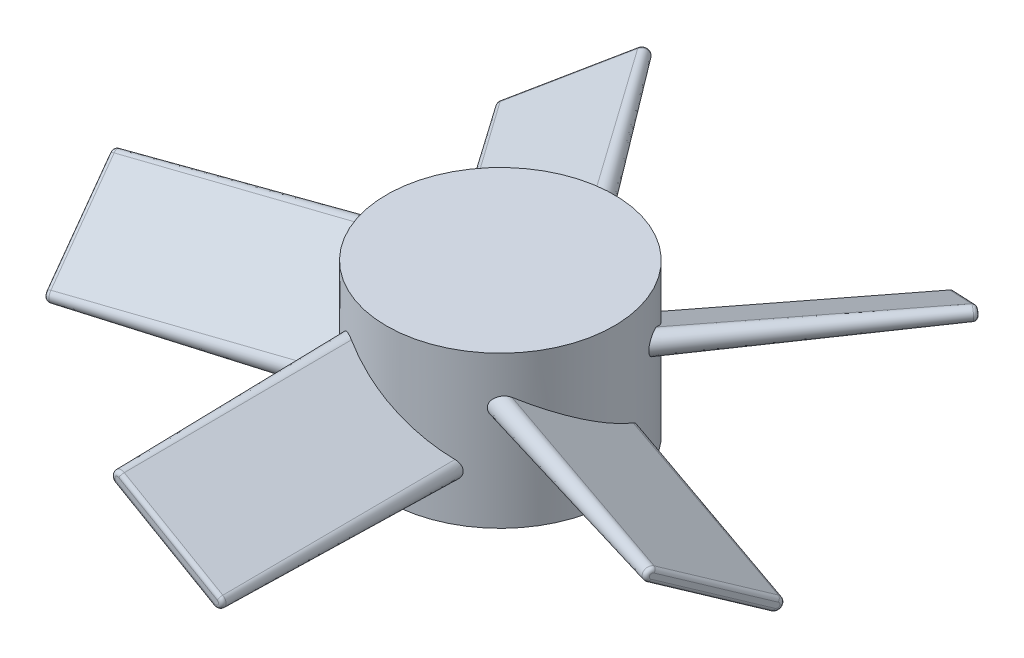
ISO-10303-21;
HEADER;
FILE_DESCRIPTION(('STEP AP214'),'2;1');
FILE_NAME('part.step','',(''),(''),'','','');
FILE_SCHEMA(('AUTOMOTIVE_DESIGN { 1 0 10303 214 1 1 1 1 }'));
ENDSEC;
DATA;
#1=APPLICATION_CONTEXT('core data for automotive mechanical design processes');
#2=APPLICATION_PROTOCOL_DEFINITION('international standard','automotive_design',2000,#1);
#3=PRODUCT_CONTEXT('',#1,'mechanical');
#4=PRODUCT('Part','Part','',(#3));
#5=PRODUCT_RELATED_PRODUCT_CATEGORY('part','',(#4));
#6=PRODUCT_DEFINITION_FORMATION('','',#4);
#7=PRODUCT_DEFINITION_CONTEXT('part definition',#1,'design');
#8=PRODUCT_DEFINITION('design','',#6,#7);
#9=PRODUCT_DEFINITION_SHAPE('','',#8);
#10=(LENGTH_UNIT() NAMED_UNIT(*) SI_UNIT(.MILLI.,.METRE.));
#11=(NAMED_UNIT(*) PLANE_ANGLE_UNIT() SI_UNIT($,.RADIAN.));
#12=(NAMED_UNIT(*) SI_UNIT($,.STERADIAN.) SOLID_ANGLE_UNIT());
#13=UNCERTAINTY_MEASURE_WITH_UNIT(LENGTH_MEASURE(1.E-05),#10,'distance_accuracy_value','');
#14=(GEOMETRIC_REPRESENTATION_CONTEXT(3) GLOBAL_UNCERTAINTY_ASSIGNED_CONTEXT((#13)) GLOBAL_UNIT_ASSIGNED_CONTEXT((#10,
#11,#12)) REPRESENTATION_CONTEXT('',''));
#15=CARTESIAN_POINT('',(0.,0.,0.));
#16=DIRECTION('',(0.,0.,1.));
#17=DIRECTION('',(1.,0.,0.));
#18=AXIS2_PLACEMENT_3D('',#15,#16,#17);
#19=CARTESIAN_POINT('',(0.,50.8,0.));
#20=DIRECTION('',(0.,-1.,0.));
#21=DIRECTION('',(0.,0.,-1.));
#22=AXIS2_PLACEMENT_3D('',#19,#20,#21);
#23=CYLINDRICAL_SURFACE('',#22,38.1);
#24=CARTESIAN_POINT('',(-32.3749512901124,13.1497026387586,-20.0866257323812));
#25=CARTESIAN_POINT('',(-32.4213650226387,13.0857779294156,-20.0118173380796));
#26=CARTESIAN_POINT('',(-32.469024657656,13.0257756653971,-19.9344203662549));
#27=CARTESIAN_POINT('',(-32.5663048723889,12.9138920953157,-19.7750988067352));
#28=CARTESIAN_POINT('',(-32.6159263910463,12.862014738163,-19.6931720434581));
#29=CARTESIAN_POINT('',(-32.7671333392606,12.7187557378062,-19.4412745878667));
#30=CARTESIAN_POINT('',(-32.8709621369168,12.6398816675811,-19.2653455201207));
#31=CARTESIAN_POINT('',(-33.0801483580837,12.5166656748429,-18.9038963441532));
#32=CARTESIAN_POINT('',(-33.1854980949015,12.4721881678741,-18.718416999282));
#33=CARTESIAN_POINT('',(-33.3950277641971,12.4169226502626,-18.3419874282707));
#34=CARTESIAN_POINT('',(-33.499208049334,12.4061241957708,-18.1510389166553));
#35=CARTESIAN_POINT('',(-33.7109908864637,12.4178758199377,-17.7548016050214));
#36=CARTESIAN_POINT('',(-33.8183264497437,12.4428008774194,-17.5494402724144));
#37=CARTESIAN_POINT('',(-34.0262085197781,12.5292082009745,-17.1429086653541));
#38=CARTESIAN_POINT('',(-34.1267516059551,12.5907087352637,-16.9417405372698));
#39=CARTESIAN_POINT('',(-34.3230913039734,12.7525282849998,-16.5404801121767));
#40=CARTESIAN_POINT('',(-34.4184796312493,12.8544479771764,-16.3408312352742));
#41=CARTESIAN_POINT('',(-34.5972134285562,13.0954469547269,-15.9589228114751));
#42=CARTESIAN_POINT('',(-34.6805574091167,13.2345308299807,-15.7766654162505));
#43=CARTESIAN_POINT('',(-34.7931143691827,13.4659948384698,-15.5260183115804));
#44=CARTESIAN_POINT('',(-34.8279608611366,13.5451177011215,-15.4476495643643));
#45=CARTESIAN_POINT('',(-34.8940278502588,13.7110209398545,-15.2978263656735));
#46=CARTESIAN_POINT('',(-34.92525048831,13.7977967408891,-15.2263678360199));
#47=CARTESIAN_POINT('',(-34.9837644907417,13.9784973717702,-15.0914425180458));
#48=CARTESIAN_POINT('',(-35.0110584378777,14.0724174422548,-15.0279704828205));
#49=CARTESIAN_POINT('',(-35.0614374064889,14.2668291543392,-14.9100542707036));
#50=CARTESIAN_POINT('',(-35.084523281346,14.3673194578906,-14.8556082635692));
#51=CARTESIAN_POINT('',(-35.1234163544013,14.5602882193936,-14.7633934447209));
#52=CARTESIAN_POINT('',(-35.139783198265,14.6520555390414,-14.7243697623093));
#53=CARTESIAN_POINT('',(-35.168945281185,14.8392208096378,-14.6545801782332));
#54=CARTESIAN_POINT('',(-35.1817412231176,14.9346180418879,-14.6238126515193));
#55=CARTESIAN_POINT('',(-35.2035930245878,15.1281487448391,-14.5711307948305));
#56=CARTESIAN_POINT('',(-35.2126525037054,15.2262794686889,-14.5492078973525));
#57=CARTESIAN_POINT('',(-35.2269245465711,15.424432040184,-14.5146181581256));
#58=CARTESIAN_POINT('',(-35.23213763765,15.5244536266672,-14.5019500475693));
#59=CARTESIAN_POINT('',(-35.238187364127,15.7112720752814,-14.487242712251));
#60=CARTESIAN_POINT('',(-35.239535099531,15.7979570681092,-14.483962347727));
#61=CARTESIAN_POINT('',(-35.2393195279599,15.9713328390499,-14.4844868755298));
#62=CARTESIAN_POINT('',(-35.2377552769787,16.0580236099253,-14.4882940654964));
#63=CARTESIAN_POINT('',(-35.2317311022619,16.2306597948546,-14.5029371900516));
#64=CARTESIAN_POINT('',(-35.2272728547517,16.3166056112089,-14.5137690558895));
#65=CARTESIAN_POINT('',(-35.215512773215,16.4871668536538,-14.5422794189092));
#66=CARTESIAN_POINT('',(-35.2082098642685,16.571781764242,-14.5599605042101));
#67=CARTESIAN_POINT('',(-35.1828057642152,16.8162186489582,-14.6212903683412));
#68=CARTESIAN_POINT('',(-35.1609546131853,16.9735133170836,-14.6738560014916));
#69=CARTESIAN_POINT('',(-35.1077312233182,17.2771943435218,-14.800739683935));
#70=CARTESIAN_POINT('',(-35.0763569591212,17.4235783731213,-14.8750623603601));
#71=CARTESIAN_POINT('',(-35.002222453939,17.7136100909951,-15.0487200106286));
#72=CARTESIAN_POINT('',(-34.9587761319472,17.856196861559,-15.1495307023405));
#73=CARTESIAN_POINT('',(-34.8629524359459,18.1236855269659,-15.368762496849));
#74=CARTESIAN_POINT('',(-34.810570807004,18.248578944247,-15.4871919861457));
#75=CARTESIAN_POINT('',(-34.6902792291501,18.4949211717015,-15.7549618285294));
#76=CARTESIAN_POINT('',(-34.6212273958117,18.613622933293,-15.9063166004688));
#77=CARTESIAN_POINT('',(-34.4743305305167,18.8251816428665,-16.2222357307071));
#78=CARTESIAN_POINT('',(-34.3964807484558,18.9180245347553,-16.3868072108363));
#79=CARTESIAN_POINT('',(-34.2230603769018,19.086866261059,-16.7462444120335));
#80=CARTESIAN_POINT('',(-34.1264922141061,19.159283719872,-16.9423186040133));
#81=CARTESIAN_POINT('',(-33.9259165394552,19.2688751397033,-17.3404709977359));
#82=CARTESIAN_POINT('',(-33.8219060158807,19.3060347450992,-17.5425516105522));
#83=CARTESIAN_POINT('',(-33.6027182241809,19.344981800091,-17.9590005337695));
#84=CARTESIAN_POINT('',(-33.4872421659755,19.3446453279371,-18.1734161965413));
#85=CARTESIAN_POINT('',(-33.2539637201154,19.3020915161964,-18.5968358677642));
#86=CARTESIAN_POINT('',(-33.1361614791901,19.2598768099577,-18.8058402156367));
#87=CARTESIAN_POINT('',(-32.9059099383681,19.1349584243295,-19.2058007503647));
#88=CARTESIAN_POINT('',(-32.7934053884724,19.0534897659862,-19.3971079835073));
#89=CARTESIAN_POINT('',(-32.5748654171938,18.8513277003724,-19.7619161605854));
#90=CARTESIAN_POINT('',(-32.4688265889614,18.7306551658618,-19.935426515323));
#91=CARTESIAN_POINT('',(-32.2766655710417,18.4638858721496,-20.244935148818));
#92=CARTESIAN_POINT('',(-32.1896245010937,18.3206629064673,-20.382838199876));
#93=CARTESIAN_POINT('',(-32.0297237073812,18.0066807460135,-20.6331990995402));
#94=CARTESIAN_POINT('',(-31.9568560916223,17.8359369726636,-20.7456711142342));
#95=CARTESIAN_POINT('',(-31.8345977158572,17.4872665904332,-20.9327466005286));
#96=CARTESIAN_POINT('',(-31.7837590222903,17.3111165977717,-21.0097206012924));
#97=CARTESIAN_POINT('',(-31.6998987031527,16.9451949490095,-21.1360407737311));
#98=CARTESIAN_POINT('',(-31.6668705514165,16.7554283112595,-21.1853970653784));
#99=CARTESIAN_POINT('',(-31.6216479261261,16.3789995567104,-21.2528337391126));
#100=CARTESIAN_POINT('',(-31.6084047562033,16.1927435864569,-21.2724891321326));
#101=CARTESIAN_POINT('',(-31.6000017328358,15.8189500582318,-21.2849702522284));
#102=CARTESIAN_POINT('',(-31.6048379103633,15.631412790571,-21.2778018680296));
#103=CARTESIAN_POINT('',(-31.6320539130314,15.2645864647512,-21.2373191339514));
#104=CARTESIAN_POINT('',(-31.6540569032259,15.0852067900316,-21.2045663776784));
#105=CARTESIAN_POINT('',(-31.7141396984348,14.7354638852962,-21.1145978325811));
#106=CARTESIAN_POINT('',(-31.7522240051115,14.5651031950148,-21.057375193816));
#107=CARTESIAN_POINT('',(-31.8432704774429,14.2361347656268,-20.9194408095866));
#108=CARTESIAN_POINT('',(-31.8963926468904,14.0776779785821,-20.8384760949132));
#109=CARTESIAN_POINT('',(-32.0150277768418,13.778620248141,-20.655744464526));
#110=CARTESIAN_POINT('',(-32.0805258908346,13.6379982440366,-20.5540024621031));
#111=CARTESIAN_POINT('',(-32.1860033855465,13.4427812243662,-20.3881212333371));
#112=CARTESIAN_POINT('',(-32.2223447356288,13.3803594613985,-20.3306528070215));
#113=CARTESIAN_POINT('',(-32.2971427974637,13.2609199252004,-20.2116180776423));
#114=CARTESIAN_POINT('',(-32.3355992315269,13.2039014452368,-20.1500523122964));
#115=CARTESIAN_POINT('',(-32.3749512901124,13.1497026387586,-20.0866257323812));
#116=B_SPLINE_CURVE_WITH_KNOTS('',3,(#24,#25,#26,#27,#28,#29,#30,#31,#32,#33,#34,#35,#36,#37,
#38,#39,#40,#41,#42,#43,#44,#45,#46,#47,#48,#49,#50,#51,#52,#53,#54,#55,#56,#57,#58,#59,#60,#61,
#62,#63,#64,#65,#66,#67,#68,#69,#70,#71,#72,#73,#74,#75,#76,#77,#78,#79,#80,#81,#82,#83,#84,#85,
#86,#87,#88,#89,#90,#91,#92,#93,#94,#95,#96,#97,#98,#99,#100,#101,#102,#103,#104,#105,#106,#107,
#108,#109,#110,#111,#112,#113,#114,#115),.UNSPECIFIED.,.T.,.F.,(4,2,2,2,2,2,2,2,2,2,2,2,2,2,2,2,
2,2,2,2,2,2,2,2,2,2,2,2,2,2,2,2,2,2,2,2,2,2,2,2,2,2,2,2,2,4),(0.,0.326289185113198,
0.652736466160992,1.3063132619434,1.95730046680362,2.60808578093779,3.3041958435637,
4.00065388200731,4.72800075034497,5.45543748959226,5.80509081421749,6.15453650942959,
6.50375141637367,6.85289542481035,7.15561931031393,7.45828356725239,7.76065393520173,
8.06298284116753,8.32292630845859,8.5829540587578,8.84283133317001,9.10280690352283,
9.60228176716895,10.1018629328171,10.6395607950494,11.1775154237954,11.7881784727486,
12.3991728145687,13.0869252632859,13.7749576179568,14.5019815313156,15.2289597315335,
15.9344268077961,16.6395188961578,17.2871431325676,17.9344057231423,18.5278692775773,
19.1211152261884,19.6816376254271,20.2420369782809,20.7904694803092,21.339055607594,
21.8937135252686,22.4477102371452,22.7243919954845,23.0010375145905),.UNSPECIFIED.);
#117=CARTESIAN_POINT('',(-32.5938439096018,12.8863598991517,-19.7294535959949));
#118=VERTEX_POINT('',#117);
#119=CARTESIAN_POINT('',(-34.4169166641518,18.8888592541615,-16.3427613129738));
#120=VERTEX_POINT('',#119);
#121=EDGE_CURVE('E347',#118,#120,#116,.T.);
#122=ORIENTED_EDGE('',*,*,#121,.F.);
#123=CARTESIAN_POINT('',(0.,20.7072970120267,0.));
#124=DIRECTION('',(0.394188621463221,-0.865893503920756,-0.307967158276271));
#125=DIRECTION('',(-0.682339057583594,-0.500228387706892,0.533090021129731));
#126=AXIS2_PLACEMENT_3D('',#123,#124,#125);
#127=ELLIPSE('',#126,44.0007920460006,38.1);
#128=CARTESIAN_POINT('',(-4.9074774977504,31.9111407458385,-37.7826238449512));
#129=VERTEX_POINT('',#128);
#130=EDGE_CURVE('E319',#129,#118,#127,.F.);
#131=ORIENTED_EDGE('',*,*,#130,.F.);
#132=CARTESIAN_POINT('',(-10.0463600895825,33.2800190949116,-36.7516074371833));
#133=CARTESIAN_POINT('',(-10.1355770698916,33.4402279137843,-36.7272196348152));
#134=CARTESIAN_POINT('',(-10.2119753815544,33.6080932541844,-36.7059901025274));
#135=CARTESIAN_POINT('',(-10.3366038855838,33.9547539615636,-36.6710900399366));
#136=CARTESIAN_POINT('',(-10.3848313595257,34.1335503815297,-36.6574202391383));
#137=CARTESIAN_POINT('',(-10.4514968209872,34.4972007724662,-36.638469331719));
#138=CARTESIAN_POINT('',(-10.4699123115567,34.6820592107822,-36.6331945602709));
#139=CARTESIAN_POINT('',(-10.4762414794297,35.0523343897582,-36.6313851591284));
#140=CARTESIAN_POINT('',(-10.4641566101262,35.2377511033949,-36.6348501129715));
#141=CARTESIAN_POINT('',(-10.4102275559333,35.60161770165,-36.6502103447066));
#142=CARTESIAN_POINT('',(-10.3687312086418,35.7801235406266,-36.6620070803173));
#143=CARTESIAN_POINT('',(-10.2577510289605,36.1274844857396,-36.6932124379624));
#144=CARTESIAN_POINT('',(-10.1882670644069,36.2963395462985,-36.7126210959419));
#145=CARTESIAN_POINT('',(-10.0225344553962,36.6220261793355,-36.7582132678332));
#146=CARTESIAN_POINT('',(-9.92596365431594,36.7786820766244,-36.7844780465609));
#147=CARTESIAN_POINT('',(-9.70949563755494,37.0738335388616,-36.8422069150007));
#148=CARTESIAN_POINT('',(-9.58959504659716,37.2123264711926,-36.8736717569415));
#149=CARTESIAN_POINT('',(-9.32454239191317,37.4736507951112,-36.9416073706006));
#150=CARTESIAN_POINT('',(-9.17854030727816,37.5955783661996,-36.9782330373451));
#151=CARTESIAN_POINT('',(-8.86935379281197,37.8143674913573,-37.0536082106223));
#152=CARTESIAN_POINT('',(-8.70616478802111,37.9112223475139,-37.0923582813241));
#153=CARTESIAN_POINT('',(-8.35537293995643,38.0843082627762,-37.1730041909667));
#154=CARTESIAN_POINT('',(-8.16686428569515,38.158685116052,-37.2149345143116));
#155=CARTESIAN_POINT('',(-7.78028121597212,38.2768551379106,-37.2976721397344));
#156=CARTESIAN_POINT('',(-7.58220341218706,38.3206373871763,-37.338479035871));
#157=CARTESIAN_POINT('',(-7.16470407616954,38.3801195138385,-37.42092835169));
#158=CARTESIAN_POINT('',(-6.94486883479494,38.3932077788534,-37.4623624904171));
#159=CARTESIAN_POINT('',(-6.50516509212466,38.3844827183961,-37.5412146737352));
#160=CARTESIAN_POINT('',(-6.28529660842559,38.3626565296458,-37.5786312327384));
#161=CARTESIAN_POINT('',(-5.83582534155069,38.2824314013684,-37.6511409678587));
#162=CARTESIAN_POINT('',(-5.60659587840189,38.2216158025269,-37.6858963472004));
#163=CARTESIAN_POINT('',(-5.16048106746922,38.0625567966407,-37.7495731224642));
#164=CARTESIAN_POINT('',(-4.9436024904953,37.964293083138,-37.7784913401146));
#165=CARTESIAN_POINT('',(-4.52701064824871,37.7305858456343,-37.8306846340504));
#166=CARTESIAN_POINT('',(-4.32749811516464,37.5947682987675,-37.8538982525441));
#167=CARTESIAN_POINT('',(-3.9564864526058,37.2885168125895,-37.8944720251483));
#168=CARTESIAN_POINT('',(-3.78494912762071,37.1181307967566,-37.9118401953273));
#169=CARTESIAN_POINT('',(-3.51447284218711,36.7892264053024,-37.9377454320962));
#170=CARTESIAN_POINT('',(-3.40791883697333,36.637076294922,-37.9473959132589));
#171=CARTESIAN_POINT('',(-3.26804090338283,36.3972446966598,-37.9596113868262));
#172=CARTESIAN_POINT('',(-3.22473306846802,36.3153470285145,-37.9633070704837));
#173=CARTESIAN_POINT('',(-3.1452990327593,36.1481261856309,-37.9699708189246));
#174=CARTESIAN_POINT('',(-3.10916993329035,36.0628044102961,-37.9729391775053));
#175=CARTESIAN_POINT('',(-3.04441271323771,35.8887787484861,-37.9781860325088));
#176=CARTESIAN_POINT('',(-3.01582877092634,35.8000582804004,-37.9804604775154));
#177=CARTESIAN_POINT('',(-2.96689059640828,35.620397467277,-37.9843147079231));
#178=CARTESIAN_POINT('',(-2.94653261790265,35.5294581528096,-37.9858948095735));
#179=CARTESIAN_POINT('',(-2.91437147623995,35.3460747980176,-37.9883758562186));
#180=CARTESIAN_POINT('',(-2.9025675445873,35.2536308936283,-37.9892768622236));
#181=CARTESIAN_POINT('',(-2.88771872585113,35.0680425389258,-37.9904084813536));
#182=CARTESIAN_POINT('',(-2.88467310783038,34.9748981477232,-37.9906391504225));
#183=CARTESIAN_POINT('',(-2.88726953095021,34.7973361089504,-37.9904419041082));
#184=CARTESIAN_POINT('',(-2.8921355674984,34.7129065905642,-37.9900728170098));
#185=CARTESIAN_POINT('',(-2.90904588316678,34.5447650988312,-37.9887814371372));
#186=CARTESIAN_POINT('',(-2.92109260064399,34.461053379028,-37.9878589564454));
#187=CARTESIAN_POINT('',(-2.96777990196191,34.2119846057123,-37.9842510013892));
#188=CARTESIAN_POINT('',(-3.01297095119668,34.0485011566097,-37.9807248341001));
#189=CARTESIAN_POINT('',(-3.12891300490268,33.7316241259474,-37.971347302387));
#190=CARTESIAN_POINT('',(-3.19959431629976,33.5782043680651,-37.9655022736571));
#191=CARTESIAN_POINT('',(-3.36333546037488,33.2839618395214,-37.9513466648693));
#192=CARTESIAN_POINT('',(-3.45640199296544,33.1431428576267,-37.9430353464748));
#193=CARTESIAN_POINT('',(-3.67159703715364,32.8631589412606,-37.9228445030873));
#194=CARTESIAN_POINT('',(-3.79568585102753,32.7255249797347,-37.9106940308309));
#195=CARTESIAN_POINT('',(-4.06236137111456,32.469958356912,-37.8830464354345));
#196=CARTESIAN_POINT('',(-4.20495755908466,32.3520358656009,-37.867547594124));
#197=CARTESIAN_POINT('',(-4.52563158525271,32.122087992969,-37.8306507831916));
#198=CARTESIAN_POINT('',(-4.70588453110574,32.0131766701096,-37.8087316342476));
#199=CARTESIAN_POINT('',(-5.08013855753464,31.8236823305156,-37.7602683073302));
#200=CARTESIAN_POINT('',(-5.27414688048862,31.7431143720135,-37.7337216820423));
#201=CARTESIAN_POINT('',(-5.69351179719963,31.6039537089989,-37.67284926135));
#202=CARTESIAN_POINT('',(-5.91994822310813,31.5488247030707,-37.6379855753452));
#203=CARTESIAN_POINT('',(-6.37795415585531,31.4761408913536,-37.5630888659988));
#204=CARTESIAN_POINT('',(-6.6095251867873,31.4585973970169,-37.5230542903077));
#205=CARTESIAN_POINT('',(-7.07937501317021,31.4624003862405,-37.4372956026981));
#206=CARTESIAN_POINT('',(-7.31762557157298,31.4850371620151,-37.3914282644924));
#207=CARTESIAN_POINT('',(-7.66842995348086,31.5505978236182,-37.3204984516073));
#208=CARTESIAN_POINT('',(-7.7843353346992,31.5777440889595,-37.2964857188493));
#209=CARTESIAN_POINT('',(-8.0130379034,31.64259990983,-37.2480177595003));
#210=CARTESIAN_POINT('',(-8.12583663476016,31.6803041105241,-37.2235627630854));
#211=CARTESIAN_POINT('',(-8.3420271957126,31.7641687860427,-37.1756945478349));
#212=CARTESIAN_POINT('',(-8.44561095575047,31.8098389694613,-37.1522874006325));
#213=CARTESIAN_POINT('',(-8.64810961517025,31.9105503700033,-37.1056732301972));
#214=CARTESIAN_POINT('',(-8.74702679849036,31.9655869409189,-37.0824661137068));
#215=CARTESIAN_POINT('',(-8.93925803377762,32.0847794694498,-37.0365957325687));
#216=CARTESIAN_POINT('',(-9.03257586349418,32.148929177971,-37.0139321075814));
#217=CARTESIAN_POINT('',(-9.21271579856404,32.2859873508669,-36.9695074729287));
#218=CARTESIAN_POINT('',(-9.2995392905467,32.3588939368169,-36.9477462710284));
#219=CARTESIAN_POINT('',(-9.51393209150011,32.5576619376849,-36.8932702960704));
#220=CARTESIAN_POINT('',(-9.63605109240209,32.6897769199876,-36.8614932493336));
#221=CARTESIAN_POINT('',(-9.85836475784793,32.9721347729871,-36.8026618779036));
#222=CARTESIAN_POINT('',(-9.95856858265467,33.1223700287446,-36.7756055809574));
#223=CARTESIAN_POINT('',(-10.0463600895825,33.2800190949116,-36.7516074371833));
#224=B_SPLINE_CURVE_WITH_KNOTS('',3,(#132,#133,#134,#135,#136,#137,#138,#139,#140,#141,#142,
#143,#144,#145,#146,#147,#148,#149,#150,#151,#152,#153,#154,#155,#156,#157,#158,#159,#160,#161,
#162,#163,#164,#165,#166,#167,#168,#169,#170,#171,#172,#173,#174,#175,#176,#177,#178,#179,#180,
#181,#182,#183,#184,#185,#186,#187,#188,#189,#190,#191,#192,#193,#194,#195,#196,#197,#198,#199,
#200,#201,#202,#203,#204,#205,#206,#207,#208,#209,#210,#211,#212,#213,#214,#215,#216,#217,#218,
#219,#220,#221,#222,#223),.UNSPECIFIED.,.T.,.F.,(4,2,2,2,2,2,2,2,2,2,2,2,2,2,2,2,2,2,2,2,2,2,2,
2,2,2,2,2,2,2,2,2,2,2,2,2,2,2,2,2,2,2,2,2,2,4),(0.,0.554369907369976,1.10879330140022,
1.66363488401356,2.21845002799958,2.76681078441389,3.31517413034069,3.87035817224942,
4.42562259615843,5.00424339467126,5.58301860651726,6.20121782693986,6.81963757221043,
7.48902130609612,8.15865171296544,8.87442784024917,9.59059265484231,10.3141644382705,
11.0367398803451,11.5922089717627,11.8700664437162,12.1478114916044,12.4271484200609,
12.7063579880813,12.9855424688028,13.2647036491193,13.5180954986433,13.7715734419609,
14.2779583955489,14.782969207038,15.2881313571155,15.8430827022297,16.3983194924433,
17.0309632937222,17.6639426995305,18.3676864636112,19.071641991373,19.7986138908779,
20.1625255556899,20.5262529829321,20.8725962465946,21.2187682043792,21.5647039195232,
21.9105655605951,22.4563065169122,23.0018189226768),.UNSPECIFIED.);
#225=CARTESIAN_POINT('',(-8.69177372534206,37.9136401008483,-37.0953240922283));
#226=VERTEX_POINT('',#225);
#227=EDGE_CURVE('E322',#226,#129,#224,.T.);
#228=ORIENTED_EDGE('',*,*,#227,.F.);
#229=CARTESIAN_POINT('',(0.,30.0927029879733,0.));
#230=DIRECTION('',(-0.41470515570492,0.865893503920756,0.279728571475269));
#231=DIRECTION('',(-0.717853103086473,-0.500228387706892,0.484209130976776));
#232=AXIS2_PLACEMENT_3D('',#229,#230,#231);
#233=ELLIPSE('',#232,44.0007920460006,38.1);
#234=EDGE_CURVE('E328',#120,#226,#233,.F.);
#235=ORIENTED_EDGE('',*,*,#234,.F.);
#236=EDGE_LOOP('',(#122,#131,#228,#235));
#237=FACE_BOUND('',#236,.T.);
#238=CARTESIAN_POINT('',(0.,20.7072970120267,0.));
#239=DIRECTION('',(-0.137886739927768,-0.865893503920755,0.480848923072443));
#240=DIRECTION('',(0.238681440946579,-0.500228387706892,-0.832347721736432));
#241=AXIS2_PLACEMENT_3D('',#238,#239,#240);
#242=ELLIPSE('',#241,44.0007920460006,38.1);
#243=CARTESIAN_POINT('',(26.1783017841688,31.9111407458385,27.6822418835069));
#244=VERTEX_POINT('',#243);
#245=CARTESIAN_POINT('',(37.9656554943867,12.8863598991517,-3.19671751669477));
#246=VERTEX_POINT('',#245);
#247=EDGE_CURVE('E233',#244,#246,#242,.F.);
#248=ORIENTED_EDGE('',*,*,#247,.F.);
#249=CARTESIAN_POINT('',(29.0098955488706,32.0953307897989,24.6989060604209));
#250=CARTESIAN_POINT('',(29.1169854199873,32.2031204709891,24.5731243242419));
#251=CARTESIAN_POINT('',(29.2177069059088,32.3241559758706,24.4531539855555));
#252=CARTESIAN_POINT('',(29.4037612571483,32.5905281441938,24.2291166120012));
#253=CARTESIAN_POINT('',(29.4890883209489,32.7358739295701,24.1250555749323));
#254=CARTESIAN_POINT('',(29.6421235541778,33.047846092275,23.9367773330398));
#255=CARTESIAN_POINT('',(29.7097903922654,33.2145210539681,23.852606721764));
#256=CARTESIAN_POINT('',(29.8252339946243,33.564293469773,23.7081004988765));
#257=CARTESIAN_POINT('',(29.8730155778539,33.7473869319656,23.6477591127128));
#258=CARTESIAN_POINT('',(29.9456396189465,34.1161911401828,23.5557205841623));
#259=CARTESIAN_POINT('',(29.9713902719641,34.3014408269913,23.5228906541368));
#260=CARTESIAN_POINT('',(30.0026640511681,34.676359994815,23.4829899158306));
#261=CARTESIAN_POINT('',(30.0081910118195,34.8660286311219,23.4759142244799));
#262=CARTESIAN_POINT('',(29.999009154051,35.2383987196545,23.4876453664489));
#263=CARTESIAN_POINT('',(29.9848965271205,35.4211397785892,23.5056896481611));
#264=CARTESIAN_POINT('',(29.9378736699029,35.7801763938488,23.5655501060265));
#265=CARTESIAN_POINT('',(29.9049643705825,35.9564722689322,23.6073651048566));
#266=CARTESIAN_POINT('',(29.8211282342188,36.2981734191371,23.7131786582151));
#267=CARTESIAN_POINT('',(29.770162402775,36.463554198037,23.7772252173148));
#268=CARTESIAN_POINT('',(29.651552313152,36.7787976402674,23.9249741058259));
#269=CARTESIAN_POINT('',(29.5839063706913,36.9286587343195,24.0086784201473));
#270=CARTESIAN_POINT('',(29.4311865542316,37.214003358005,24.1956659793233));
#271=CARTESIAN_POINT('',(29.3456186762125,37.3488630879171,24.2994960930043));
#272=CARTESIAN_POINT('',(29.1606778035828,37.5956429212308,24.521127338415));
#273=CARTESIAN_POINT('',(29.0613016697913,37.7075577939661,24.6389316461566));
#274=CARTESIAN_POINT('',(28.8447640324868,37.9126492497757,24.892145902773));
#275=CARTESIAN_POINT('',(28.726891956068,38.004292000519,25.0281888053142));
#276=CARTESIAN_POINT('',(28.4811854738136,38.1586892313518,25.3074434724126));
#277=CARTESIAN_POINT('',(28.3533477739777,38.2214341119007,25.4506576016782));
#278=CARTESIAN_POINT('',(28.0801178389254,38.3216065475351,25.7519223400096));
#279=CARTESIAN_POINT('',(27.934138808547,38.35661445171,25.9102449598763));
#280=CARTESIAN_POINT('',(27.6375341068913,38.393023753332,26.2263944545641));
#281=CARTESIAN_POINT('',(27.4869066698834,38.3944122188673,26.3842211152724));
#282=CARTESIAN_POINT('',(27.172776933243,38.3632079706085,26.7077675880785));
#283=CARTESIAN_POINT('',(27.0091840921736,38.3279650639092,26.8731471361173));
#284=CARTESIAN_POINT('',(26.6851829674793,38.2205684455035,27.1949113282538));
#285=CARTESIAN_POINT('',(26.5247759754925,38.1484000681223,27.3512923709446));
#286=CARTESIAN_POINT('',(26.2065031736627,37.9652959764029,27.6564548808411));
#287=CARTESIAN_POINT('',(26.0489258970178,37.8530842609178,27.8047746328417));
#288=CARTESIAN_POINT('',(25.7483688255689,37.5919352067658,28.0833301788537));
#289=CARTESIAN_POINT('',(25.6053890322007,37.4429978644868,28.2135659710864));
#290=CARTESIAN_POINT('',(25.4110888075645,37.1987043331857,28.3882670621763));
#291=CARTESIAN_POINT('',(25.3511364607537,37.1164101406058,28.441795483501));
#292=CARTESIAN_POINT('',(25.2370159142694,36.944614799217,28.5431046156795));
#293=CARTESIAN_POINT('',(25.1828443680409,36.8551178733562,28.5908886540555));
#294=CARTESIAN_POINT('',(25.0812068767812,36.6695015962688,28.680091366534));
#295=CARTESIAN_POINT('',(25.033735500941,36.5733877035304,28.7215151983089));
#296=CARTESIAN_POINT('',(24.9463535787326,36.3751724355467,28.7974442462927));
#297=CARTESIAN_POINT('',(24.9064414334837,36.2730723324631,28.8319509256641));
#298=CARTESIAN_POINT('',(24.8400845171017,36.0785623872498,28.8891301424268));
#299=CARTESIAN_POINT('',(24.8125342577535,35.9868167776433,28.9127853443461));
#300=CARTESIAN_POINT('',(24.7641484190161,35.8002868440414,28.9542392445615));
#301=CARTESIAN_POINT('',(24.743311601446,35.7055030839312,28.9720390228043));
#302=CARTESIAN_POINT('',(24.7087728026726,35.5137887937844,29.0015010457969));
#303=CARTESIAN_POINT('',(24.6950647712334,35.4168601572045,29.0131684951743));
#304=CARTESIAN_POINT('',(24.6750443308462,35.221695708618,29.0301974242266));
#305=CARTESIAN_POINT('',(24.6687310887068,35.1234600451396,29.0355596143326));
#306=CARTESIAN_POINT('',(24.6639673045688,34.9395909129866,29.0396060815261));
#307=CARTESIAN_POINT('',(24.664593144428,34.8539965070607,29.0390747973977));
#308=CARTESIAN_POINT('',(24.6715125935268,34.6831736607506,29.0331963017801));
#309=CARTESIAN_POINT('',(24.6778080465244,34.5979453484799,29.0278475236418));
#310=CARTESIAN_POINT('',(24.6959655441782,34.4285612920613,29.0124012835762));
#311=CARTESIAN_POINT('',(24.7078247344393,34.3444050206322,29.0023062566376));
#312=CARTESIAN_POINT('',(24.7369164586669,34.1777074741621,28.9774968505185));
#313=CARTESIAN_POINT('',(24.7541510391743,34.0951668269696,28.9627807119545));
#314=CARTESIAN_POINT('',(24.812715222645,33.8542940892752,28.9126581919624));
#315=CARTESIAN_POINT('',(24.8613277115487,33.6989482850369,28.87092209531));
#316=CARTESIAN_POINT('',(24.9757204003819,33.4000861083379,28.7720188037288));
#317=CARTESIAN_POINT('',(25.0415050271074,33.2565727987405,28.7148476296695));
#318=CARTESIAN_POINT('',(25.1939035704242,32.9715955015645,28.5812586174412));
#319=CARTESIAN_POINT('',(25.2818431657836,32.8314295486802,28.503587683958));
#320=CARTESIAN_POINT('',(25.4712119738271,32.5698002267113,28.3344928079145));
#321=CARTESIAN_POINT('',(25.5726479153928,32.4483462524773,28.2430620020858));
#322=CARTESIAN_POINT('',(25.8005093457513,32.210011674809,28.0351672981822));
#323=CARTESIAN_POINT('',(25.9284517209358,32.0960742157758,27.9169900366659));
#324=CARTESIAN_POINT('',(26.1934675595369,31.8953030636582,27.6684894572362));
#325=CARTESIAN_POINT('',(26.3305455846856,31.8084830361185,27.5381600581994));
#326=CARTESIAN_POINT('',(26.626860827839,31.6542682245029,27.2519268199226));
#327=CARTESIAN_POINT('',(26.7867938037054,31.5904145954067,27.0948252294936));
#328=CARTESIAN_POINT('',(27.1089828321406,31.4991577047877,26.7724678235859));
#329=CARTESIAN_POINT('',(27.2712402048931,31.4717760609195,26.6072072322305));
#330=CARTESIAN_POINT('',(27.6009457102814,31.4543082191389,26.2651231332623));
#331=CARTESIAN_POINT('',(27.7682983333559,31.465957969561,26.0881141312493));
#332=CARTESIAN_POINT('',(28.0956175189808,31.5314791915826,25.7352677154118));
#333=CARTESIAN_POINT('',(28.2555934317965,31.5852955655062,25.5594290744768));
#334=CARTESIAN_POINT('',(28.5165824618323,31.7124578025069,25.2673823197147));
#335=CARTESIAN_POINT('',(28.6207927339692,31.7749710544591,25.1492266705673));
#336=CARTESIAN_POINT('',(28.8215273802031,31.920188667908,24.9189254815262));
#337=CARTESIAN_POINT('',(28.9180534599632,32.0028885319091,24.8067786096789));
#338=CARTESIAN_POINT('',(29.0098955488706,32.0953307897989,24.6989060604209));
#339=B_SPLINE_CURVE_WITH_KNOTS('',3,(#249,#250,#251,#252,#253,#254,#255,#256,#257,#258,#259,
#260,#261,#262,#263,#264,#265,#266,#267,#268,#269,#270,#271,#272,#273,#274,#275,#276,#277,#278,
#279,#280,#281,#282,#283,#284,#285,#286,#287,#288,#289,#290,#291,#292,#293,#294,#295,#296,#297,
#298,#299,#300,#301,#302,#303,#304,#305,#306,#307,#308,#309,#310,#311,#312,#313,#314,#315,#316,
#317,#318,#319,#320,#321,#322,#323,#324,#325,#326,#327,#328,#329,#330,#331,#332,#333,#334,#335,
#336,#337,#338),.UNSPECIFIED.,.T.,.F.,(4,2,2,2,2,2,2,2,2,2,2,2,2,2,2,2,2,2,2,2,2,2,2,2,2,2,2,2,
2,2,2,2,2,2,2,2,2,2,2,2,2,2,2,2,4),(0.,0.591195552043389,1.18261343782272,1.77540328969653,
2.36804940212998,2.93489149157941,3.50162610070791,4.05152686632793,4.60140039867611,
5.15246873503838,5.70359273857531,6.27258799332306,6.84171281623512,7.44510254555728,
8.04869256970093,8.70044508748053,9.35244830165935,10.055140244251,10.7581114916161,
11.4858442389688,12.2135770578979,12.558252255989,12.9027268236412,13.246920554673,
13.5910414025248,13.8866284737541,14.1821609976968,14.4774422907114,14.7726903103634,
15.0291682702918,15.2857296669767,15.5421595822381,15.7986872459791,16.3004742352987,
16.8023907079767,17.3485919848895,17.8950666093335,18.5169410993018,19.1391284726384,
19.8353575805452,20.5319991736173,21.2600282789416,21.9871076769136,22.4942398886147,
23.0012592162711),.UNSPECIFIED.);
#340=CARTESIAN_POINT('',(28.8358770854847,37.9136401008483,24.90185119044));
#341=VERTEX_POINT('',#340);
#342=EDGE_CURVE('E243',#341,#244,#339,.T.);
#343=ORIENTED_EDGE('',*,*,#342,.F.);
#344=CARTESIAN_POINT('',(0.,30.0927029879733,0.));
#345=DIRECTION('',(0.171083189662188,0.865893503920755,-0.470062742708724));
#346=DIRECTION('',(0.296144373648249,-0.500228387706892,-0.813676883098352));
#347=AXIS2_PLACEMENT_3D('',#344,#345,#346);
#348=ELLIPSE('',#347,44.0007920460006,38.1);
#349=CARTESIAN_POINT('',(37.4499045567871,18.8888592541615,-7.00818440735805));
#350=VERTEX_POINT('',#349);
#351=EDGE_CURVE('E251',#350,#341,#348,.F.);
#352=ORIENTED_EDGE('',*,*,#351,.F.);
#353=CARTESIAN_POINT('',(37.2697978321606,13.4870123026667,-7.91025698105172));
#354=CARTESIAN_POINT('',(37.2403068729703,13.6161865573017,-8.04920871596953));
#355=CARTESIAN_POINT('',(37.2120518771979,13.7560730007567,-8.17848578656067));
#356=CARTESIAN_POINT('',(37.1596801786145,14.0555270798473,-8.41324320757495));
#357=CARTESIAN_POINT('',(37.1355630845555,14.2150928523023,-8.51872580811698));
#358=CARTESIAN_POINT('',(37.1037945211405,14.4670670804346,-8.65567169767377));
#359=CARTESIAN_POINT('',(37.0939127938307,14.5534870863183,-8.69788378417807));
#360=CARTESIAN_POINT('',(37.0758683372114,14.7298870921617,-8.77448202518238));
#361=CARTESIAN_POINT('',(37.067704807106,14.819865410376,-8.80887182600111));
#362=CARTESIAN_POINT('',(37.0532934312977,15.0027012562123,-8.86929606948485));
#363=CARTESIAN_POINT('',(37.0470449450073,15.0955578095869,-8.89533330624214));
#364=CARTESIAN_POINT('',(37.0366202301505,15.2834083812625,-8.93863860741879));
#365=CARTESIAN_POINT('',(37.0324437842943,15.3784021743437,-8.95590759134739));
#366=CARTESIAN_POINT('',(37.0265596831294,15.5608599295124,-8.98020144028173));
#367=CARTESIAN_POINT('',(37.0246602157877,15.6482124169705,-8.98802273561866));
#368=CARTESIAN_POINT('',(37.0227049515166,15.8233185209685,-8.99607334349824));
#369=CARTESIAN_POINT('',(37.0226497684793,15.9110722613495,-8.99630012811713));
#370=CARTESIAN_POINT('',(37.0243866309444,16.0862021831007,-8.98914955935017));
#371=CARTESIAN_POINT('',(37.0261775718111,16.1735785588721,-8.98177675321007));
#372=CARTESIAN_POINT('',(37.0315609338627,16.3473291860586,-8.95955450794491));
#373=CARTESIAN_POINT('',(37.0351540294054,16.4337030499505,-8.94470227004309));
#374=CARTESIAN_POINT('',(37.0480684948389,16.6814912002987,-8.89111798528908));
#375=CARTESIAN_POINT('',(37.0596381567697,16.8408390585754,-8.84291188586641));
#376=CARTESIAN_POINT('',(37.0881348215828,17.1495856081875,-8.72261578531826));
#377=CARTESIAN_POINT('',(37.1050627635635,17.2989825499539,-8.65052159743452));
#378=CARTESIAN_POINT('',(37.1443735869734,17.5940888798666,-8.48018845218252));
#379=CARTESIAN_POINT('',(37.1670327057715,17.7389745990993,-8.38058973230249));
#380=CARTESIAN_POINT('',(37.2157687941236,18.0120734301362,-8.16144282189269));
#381=CARTESIAN_POINT('',(37.2418472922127,18.1402790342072,-8.04188570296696));
#382=CARTESIAN_POINT('',(37.2996708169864,18.394144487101,-7.76957715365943));
#383=CARTESIAN_POINT('',(37.331710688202,18.5172726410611,-7.61452908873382));
#384=CARTESIAN_POINT('',(37.3968361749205,18.7389365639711,-7.28796344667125));
#385=CARTESIAN_POINT('',(37.4299223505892,18.8374588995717,-7.11643694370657));
#386=CARTESIAN_POINT('',(37.500077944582,19.0201661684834,-6.7376453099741));
#387=CARTESIAN_POINT('',(37.5371010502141,19.1007793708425,-6.52864262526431));
#388=CARTESIAN_POINT('',(37.6091100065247,19.2280599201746,-6.10017219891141));
#389=CARTESIAN_POINT('',(37.6440949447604,19.2747121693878,-5.8806998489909));
#390=CARTESIAN_POINT('',(37.7130847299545,19.3348959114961,-5.42132195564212));
#391=CARTESIAN_POINT('',(37.7468571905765,19.3459322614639,-5.18104838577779));
#392=CARTESIAN_POINT('',(37.8095844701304,19.3266200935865,-4.70146766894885));
#393=CARTESIAN_POINT('',(37.8385392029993,19.2962708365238,-4.4621605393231));
#394=CARTESIAN_POINT('',(37.8905320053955,19.1944171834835,-3.99643230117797));
#395=CARTESIAN_POINT('',(37.9136701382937,19.1236890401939,-3.76985427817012));
#396=CARTESIAN_POINT('',(37.9545777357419,18.9419674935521,-3.33288917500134));
#397=CARTESIAN_POINT('',(37.972349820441,18.8309937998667,-3.12249423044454));
#398=CARTESIAN_POINT('',(38.0016632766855,18.5808358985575,-2.74176622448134));
#399=CARTESIAN_POINT('',(38.0135804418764,18.4445000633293,-2.56959278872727));
#400=CARTESIAN_POINT('',(38.0336521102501,18.1423654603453,-2.2531057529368));
#401=CARTESIAN_POINT('',(38.0418087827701,17.9765837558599,-2.10877611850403));
#402=CARTESIAN_POINT('',(38.0544989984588,17.6357126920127,-1.86514463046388));
#403=CARTESIAN_POINT('',(38.0592823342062,17.462625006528,-1.76305125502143));
#404=CARTESIAN_POINT('',(38.0668446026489,17.1009382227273,-1.59146773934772));
#405=CARTESIAN_POINT('',(38.0696243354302,16.9123453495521,-1.5219645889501));
#406=CARTESIAN_POINT('',(38.0735029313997,16.537252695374,-1.42153305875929));
#407=CARTESIAN_POINT('',(38.0746924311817,16.3513030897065,-1.38854508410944));
#408=CARTESIAN_POINT('',(38.0758960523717,15.9765076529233,-1.35515200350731));
#409=CARTESIAN_POINT('',(38.0759104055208,15.7876624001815,-1.35474047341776));
#410=CARTESIAN_POINT('',(38.0747813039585,15.4176246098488,-1.38609033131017));
#411=CARTESIAN_POINT('',(38.0736678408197,15.2363605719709,-1.41701832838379));
#412=CARTESIAN_POINT('',(38.070145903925,14.8815612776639,-1.50866594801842));
#413=CARTESIAN_POINT('',(38.0677374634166,14.7080258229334,-1.56938480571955));
#414=CARTESIAN_POINT('',(38.061277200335,14.372296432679,-1.71894700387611));
#415=CARTESIAN_POINT('',(38.0572152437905,14.2101797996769,-1.80796301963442));
#416=CARTESIAN_POINT('',(38.0470274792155,13.9025262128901,-2.01096871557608));
#417=CARTESIAN_POINT('',(38.0409014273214,13.7569912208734,-2.12496134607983));
#418=CARTESIAN_POINT('',(38.0258853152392,13.4807906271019,-2.37881171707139));
#419=CARTESIAN_POINT('',(38.0169031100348,13.350855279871,-2.51945727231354));
#420=CARTESIAN_POINT('',(37.9958483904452,13.1147796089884,-2.81923257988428));
#421=CARTESIAN_POINT('',(37.9837751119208,13.0086451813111,-2.97836689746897));
#422=CARTESIAN_POINT('',(37.9553858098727,12.8158227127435,-3.32115239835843));
#423=CARTESIAN_POINT('',(37.9388491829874,12.7307959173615,-3.50571852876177));
#424=CARTESIAN_POINT('',(37.9018502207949,12.590316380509,-3.88537841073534));
#425=CARTESIAN_POINT('',(37.8813866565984,12.5348729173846,-4.08047544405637));
#426=CARTESIAN_POINT('',(37.8348371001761,12.4503640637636,-4.49237186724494));
#427=CARTESIAN_POINT('',(37.8084297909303,12.4238015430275,-4.70964842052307));
#428=CARTESIAN_POINT('',(37.7516249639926,12.4048057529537,-5.1452044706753));
#429=CARTESIAN_POINT('',(37.7212253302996,12.4123906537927,-5.36348443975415));
#430=CARTESIAN_POINT('',(37.6548066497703,12.4626320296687,-5.81211694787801));
#431=CARTESIAN_POINT('',(37.6185369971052,12.5078809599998,-6.04214420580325));
#432=CARTESIAN_POINT('',(37.5436516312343,12.6355408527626,-6.49122727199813));
#433=CARTESIAN_POINT('',(37.5050364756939,12.7179430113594,-6.71028566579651));
#434=CARTESIAN_POINT('',(37.432844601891,12.9041318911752,-7.1011184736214));
#435=CARTESIAN_POINT('',(37.399336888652,13.0031766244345,-7.27517532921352));
#436=CARTESIAN_POINT('',(37.3333610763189,13.2265243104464,-7.60648636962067));
#437=CARTESIAN_POINT('',(37.3008924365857,13.3508138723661,-7.76374939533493));
#438=CARTESIAN_POINT('',(37.2697978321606,13.4870123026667,-7.91025698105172));
#439=B_SPLINE_CURVE_WITH_KNOTS('',3,(#353,#354,#355,#356,#357,#358,#359,#360,#361,#362,#363,
#364,#365,#366,#367,#368,#369,#370,#371,#372,#373,#374,#375,#376,#377,#378,#379,#380,#381,#382,
#383,#384,#385,#386,#387,#388,#389,#390,#391,#392,#393,#394,#395,#396,#397,#398,#399,#400,#401,
#402,#403,#404,#405,#406,#407,#408,#409,#410,#411,#412,#413,#414,#415,#416,#417,#418,#419,#420,
#421,#422,#423,#424,#425,#426,#427,#428,#429,#430,#431,#432,#433,#434,#435,#436,#437,#438),
.UNSPECIFIED.,.T.,.F.,(4,2,2,2,2,2,2,2,2,2,2,2,2,2,2,2,2,2,2,2,2,2,2,2,2,2,2,2,2,2,2,2,2,2,2,2,
2,2,2,2,2,2,4),(0.,0.575440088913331,1.15082573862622,1.4405504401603,1.73013980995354,
2.01963220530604,2.30909423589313,2.57192018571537,2.83483361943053,3.0975898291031,
3.36044443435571,3.8586859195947,4.35701477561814,4.88670283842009,5.41662849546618,
6.01594602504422,6.61559003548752,7.29382906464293,7.97236942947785,8.69751801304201,
9.4226795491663,10.1343484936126,10.8456693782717,11.5019330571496,12.1578176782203,
12.75772937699,13.3574013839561,13.9211858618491,14.4848591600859,15.0339265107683,
15.5829797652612,16.1354499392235,16.6879854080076,17.2605502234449,17.8332567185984,
18.4423029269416,19.0515400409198,19.7101681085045,20.3691466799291,21.0776409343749,
21.7859673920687,22.3930196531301,22.9997507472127),.UNSPECIFIED.);
#440=EDGE_CURVE('E246',#246,#350,#439,.T.);
#441=ORIENTED_EDGE('',*,*,#440,.F.);
#442=EDGE_LOOP('',(#248,#343,#352,#441));
#443=FACE_BOUND('',#442,.T.);
#444=CARTESIAN_POINT('',(0.,0.,0.));
#445=DIRECTION('',(0.,1.,0.));
#446=DIRECTION('',(0.,0.,1.));
#447=AXIS2_PLACEMENT_3D('',#444,#445,#446);
#448=CIRCLE('',#447,38.1);
#449=CARTESIAN_POINT('',(0.,0.,38.1));
#450=VERTEX_POINT('',#449);
#451=EDGE_CURVE('E442',#450,#450,#448,.T.);
#452=ORIENTED_EDGE('',*,*,#451,.T.);
#453=EDGE_LOOP('',(#452));
#454=FACE_BOUND('',#453,.T.);
#455=CARTESIAN_POINT('',(0.,50.8,0.));
#456=DIRECTION('',(0.,1.,0.));
#457=DIRECTION('',(0.,0.,1.));
#458=AXIS2_PLACEMENT_3D('',#455,#456,#457);
#459=CIRCLE('',#458,38.1);
#460=CARTESIAN_POINT('',(0.,50.8,38.1));
#461=VERTEX_POINT('',#460);
#462=EDGE_CURVE('E438',#461,#461,#459,.T.);
#463=ORIENTED_EDGE('',*,*,#462,.F.);
#464=EDGE_LOOP('',(#463));
#465=FACE_BOUND('',#464,.T.);
#466=CARTESIAN_POINT('',(-14.4655839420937,37.7114148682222,35.24708330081));
#467=CARTESIAN_POINT('',(-14.5495698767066,37.7734249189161,35.2126187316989));
#468=CARTESIAN_POINT('',(-14.6359853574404,37.8313450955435,35.1767991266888));
#469=CARTESIAN_POINT('',(-14.8128227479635,37.9387882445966,35.1026978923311));
#470=CARTESIAN_POINT('',(-14.9032426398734,37.988315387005,35.0644174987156));
#471=CARTESIAN_POINT('',(-15.087003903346,38.0786610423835,34.9857439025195));
#472=CARTESIAN_POINT('',(-15.1803341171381,38.1195090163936,34.9453584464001));
#473=CARTESIAN_POINT('',(-15.3694250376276,38.1926248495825,34.8626082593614));
#474=CARTESIAN_POINT('',(-15.4651860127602,38.224891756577,34.8202433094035));
#475=CARTESIAN_POINT('',(-15.7546694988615,38.3086428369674,34.6907019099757));
#476=CARTESIAN_POINT('',(-15.9510691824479,38.3473085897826,34.6008755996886));
#477=CARTESIAN_POINT('',(-16.3453485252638,38.3905984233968,34.4163787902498));
#478=CARTESIAN_POINT('',(-16.5432293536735,38.3951919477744,34.3217040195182));
#479=CARTESIAN_POINT('',(-16.9491170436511,38.3702905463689,34.1231858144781));
#480=CARTESIAN_POINT('',(-17.156892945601,38.3384470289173,34.019157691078));
#481=CARTESIAN_POINT('',(-17.5633977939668,38.2379730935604,33.8110819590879));
#482=CARTESIAN_POINT('',(-17.7621239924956,38.1693315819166,33.7070343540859));
#483=CARTESIAN_POINT('',(-18.1528126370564,37.9932238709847,33.4983032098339));
#484=CARTESIAN_POINT('',(-18.3442177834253,37.8843611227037,33.3937501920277));
#485=CARTESIAN_POINT('',(-18.7058911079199,37.6297476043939,33.1925053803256));
#486=CARTESIAN_POINT('',(-18.8761582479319,37.483995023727,33.0958139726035));
#487=CARTESIAN_POINT('',(-19.1064672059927,37.2438030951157,32.9630149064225));
#488=CARTESIAN_POINT('',(-19.1775124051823,37.162500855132,32.9217125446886));
#489=CARTESIAN_POINT('',(-19.3124267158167,36.992538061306,32.8427504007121));
#490=CARTESIAN_POINT('',(-19.3763001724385,36.9038820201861,32.8050884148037));
#491=CARTESIAN_POINT('',(-19.4959974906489,36.7197678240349,32.7340943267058));
#492=CARTESIAN_POINT('',(-19.5518273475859,36.6243148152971,32.7007590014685));
#493=CARTESIAN_POINT('',(-19.6546301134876,36.4272243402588,32.6390733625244));
#494=CARTESIAN_POINT('',(-19.7016048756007,36.3255881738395,32.6107220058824));
#495=CARTESIAN_POINT('',(-19.7800185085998,36.1314801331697,32.5632103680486));
#496=CARTESIAN_POINT('',(-19.8127082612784,36.039690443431,32.5433208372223));
#497=CARTESIAN_POINT('',(-19.8704063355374,35.8528800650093,32.5081235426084));
#498=CARTESIAN_POINT('',(-19.8954161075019,35.7578599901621,32.4928149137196));
#499=CARTESIAN_POINT('',(-19.9373278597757,35.565483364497,32.4671151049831));
#500=CARTESIAN_POINT('',(-19.9542370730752,35.468128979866,32.4567195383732));
#501=CARTESIAN_POINT('',(-19.9796803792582,35.2719260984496,32.4410634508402));
#502=CARTESIAN_POINT('',(-19.9882154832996,35.1730777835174,32.4358023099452));
#503=CARTESIAN_POINT('',(-19.9961833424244,34.9882165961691,32.4308906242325));
#504=CARTESIAN_POINT('',(-19.9966857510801,34.9022651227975,32.430580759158));
#505=CARTESIAN_POINT('',(-19.9912981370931,34.730609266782,32.4339021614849));
#506=CARTESIAN_POINT('',(-19.985406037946,34.6449049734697,32.4375347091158));
#507=CARTESIAN_POINT('',(-19.9673090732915,34.4744645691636,32.448677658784));
#508=CARTESIAN_POINT('',(-19.9551075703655,34.3897279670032,32.4561859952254));
#509=CARTESIAN_POINT('',(-19.9245641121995,34.2217792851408,32.4749451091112));
#510=CARTESIAN_POINT('',(-19.9062198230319,34.1385677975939,32.4861973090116));
#511=CARTESIAN_POINT('',(-19.8434460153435,33.8965409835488,32.5246068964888));
#512=CARTESIAN_POINT('',(-19.7907448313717,33.7405611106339,32.5567480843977));
#513=CARTESIAN_POINT('',(-19.665200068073,33.4401292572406,32.6327327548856));
#514=CARTESIAN_POINT('',(-19.5923515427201,33.295680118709,32.6765791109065));
#515=CARTESIAN_POINT('',(-19.4221948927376,33.0090292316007,32.778025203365));
#516=CARTESIAN_POINT('',(-19.3233407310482,32.8680473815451,32.8364736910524));
#517=CARTESIAN_POINT('',(-19.1082771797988,32.6044502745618,32.9620881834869));
#518=CARTESIAN_POINT('',(-18.9920593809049,32.4818439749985,33.0292584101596));
#519=CARTESIAN_POINT('',(-18.7283438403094,32.240807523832,33.1795895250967));
#520=CARTESIAN_POINT('',(-18.5787421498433,32.1252578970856,33.2636799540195));
#521=CARTESIAN_POINT('',(-18.2649918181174,31.9208442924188,33.4369892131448));
#522=CARTESIAN_POINT('',(-18.1008354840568,31.8319945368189,33.5262107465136));
#523=CARTESIAN_POINT('',(-17.740994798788,31.6728640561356,33.7181475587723));
#524=CARTESIAN_POINT('',(-17.543901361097,31.6061426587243,33.8211869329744));
#525=CARTESIAN_POINT('',(-17.1408768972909,31.5087581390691,34.0272187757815));
#526=CARTESIAN_POINT('',(-16.9349411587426,31.4781144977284,34.130211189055));
#527=CARTESIAN_POINT('',(-16.5091948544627,31.4535262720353,34.3382478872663));
#528=CARTESIAN_POINT('',(-16.2891992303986,31.4614557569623,34.4431449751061));
#529=CARTESIAN_POINT('',(-15.8520044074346,31.5194370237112,34.6465288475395));
#530=CARTESIAN_POINT('',(-15.6348021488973,31.5694378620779,34.7450232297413));
#531=CARTESIAN_POINT('',(-15.2540675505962,31.6971645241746,34.9135723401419));
#532=CARTESIAN_POINT('',(-15.0886655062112,31.7670990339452,34.9853163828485));
#533=CARTESIAN_POINT('',(-14.8484442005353,31.8916847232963,35.0876236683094));
#534=CARTESIAN_POINT('',(-14.7696021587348,31.936553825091,35.1208747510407));
#535=CARTESIAN_POINT('',(-14.615081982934,32.0327542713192,35.1854573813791));
#536=CARTESIAN_POINT('',(-14.5394054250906,32.0840887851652,35.2167879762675));
#537=CARTESIAN_POINT('',(-14.4655839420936,32.1385851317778,35.2470833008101));
#538=B_SPLINE_CURVE_WITH_KNOTS('',3,(#466,#467,#468,#469,#470,#471,#472,#473,#474,#475,#476,
#477,#478,#479,#480,#481,#482,#483,#484,#485,#486,#487,#488,#489,#490,#491,#492,#493,#494,#495,
#496,#497,#498,#499,#500,#501,#502,#503,#504,#505,#506,#507,#508,#509,#510,#511,#512,#513,#514,
#515,#516,#517,#518,#519,#520,#521,#522,#523,#524,#525,#526,#527,#528,#529,#530,#531,#532,#533,
#534,#535,#536,#537),.UNSPECIFIED.,.F.,.F.,(4,2,2,2,2,2,2,2,2,2,2,2,2,2,2,2,2,2,2,2,2,2,2,2,2,2,
2,2,2,2,2,2,2,2,2,4),(0.,0.329668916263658,0.659173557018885,0.987541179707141,1.31594522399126,
1.97107155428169,2.62678533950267,3.32726401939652,4.02795399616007,4.75569455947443,
5.48347084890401,5.82985590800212,6.17602995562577,6.52194463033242,6.86778683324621,
7.16569660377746,7.46355007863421,7.76113710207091,8.05868818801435,8.31622784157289,
8.5738511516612,8.83133730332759,9.08892139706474,9.58983140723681,10.0908644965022,
10.6342083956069,11.1778162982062,11.796001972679,12.4145163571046,13.1080503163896,
13.8019585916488,14.5299075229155,15.2569762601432,15.8348993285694,16.1244950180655,
16.4142332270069),.UNSPECIFIED.);
#539=CARTESIAN_POINT('',(-14.7722917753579,37.9136401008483,35.1196440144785));
#540=VERTEX_POINT('',#539);
#541=CARTESIAN_POINT('',(-18.2378363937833,31.9111407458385,33.4513276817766));
#542=VERTEX_POINT('',#541);
#543=EDGE_CURVE('E387',#540,#542,#538,.T.);
#544=ORIENTED_EDGE('',*,*,#543,.F.);
#545=CARTESIAN_POINT('',(0.,30.0927029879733,0.));
#546=DIRECTION('',(0.499923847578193,0.865893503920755,0.0174524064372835));
#547=DIRECTION('',(0.865366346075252,-0.500228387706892,0.0302100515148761));
#548=AXIS2_PLACEMENT_3D('',#545,#546,#547);
#549=ELLIPSE('',#548,44.0007920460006,38.1);
#550=CARTESIAN_POINT('',(18.2378363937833,18.8888592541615,33.4513276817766));
#551=VERTEX_POINT('',#550);
#552=EDGE_CURVE('E441',#551,#540,#549,.F.);
#553=ORIENTED_EDGE('',*,*,#552,.F.);
#554=CARTESIAN_POINT('',(14.4655839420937,13.0885851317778,35.24708330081));
#555=CARTESIAN_POINT('',(14.5495698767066,13.0265750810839,35.2126187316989));
#556=CARTESIAN_POINT('',(14.6359853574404,12.9686549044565,35.1767991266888));
#557=CARTESIAN_POINT('',(14.8128227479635,12.8612117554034,35.1026978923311));
#558=CARTESIAN_POINT('',(14.9032426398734,12.811684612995,35.0644174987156));
#559=CARTESIAN_POINT('',(15.087003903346,12.7213389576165,34.9857439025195));
#560=CARTESIAN_POINT('',(15.1803341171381,12.6804909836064,34.9453584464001));
#561=CARTESIAN_POINT('',(15.3694250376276,12.6073751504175,34.8626082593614));
#562=CARTESIAN_POINT('',(15.4651860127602,12.575108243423,34.8202433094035));
#563=CARTESIAN_POINT('',(15.7546694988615,12.4913571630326,34.6907019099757));
#564=CARTESIAN_POINT('',(15.9510691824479,12.4526914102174,34.6008755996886));
#565=CARTESIAN_POINT('',(16.3453485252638,12.4094015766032,34.4163787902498));
#566=CARTESIAN_POINT('',(16.5432293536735,12.4048080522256,34.3217040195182));
#567=CARTESIAN_POINT('',(16.9491170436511,12.429709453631,34.1231858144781));
#568=CARTESIAN_POINT('',(17.156892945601,12.4615529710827,34.019157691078));
#569=CARTESIAN_POINT('',(17.5633977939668,12.5620269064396,33.8110819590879));
#570=CARTESIAN_POINT('',(17.7621239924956,12.6306684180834,33.7070343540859));
#571=CARTESIAN_POINT('',(18.1528126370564,12.8067761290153,33.4983032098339));
#572=CARTESIAN_POINT('',(18.3442177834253,12.9156388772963,33.3937501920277));
#573=CARTESIAN_POINT('',(18.7058911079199,13.1702523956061,33.1925053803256));
#574=CARTESIAN_POINT('',(18.8761582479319,13.316004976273,33.0958139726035));
#575=CARTESIAN_POINT('',(19.1064672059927,13.5561969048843,32.9630149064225));
#576=CARTESIAN_POINT('',(19.1775124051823,13.637499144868,32.9217125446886));
#577=CARTESIAN_POINT('',(19.3124267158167,13.807461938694,32.8427504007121));
#578=CARTESIAN_POINT('',(19.3763001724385,13.8961179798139,32.8050884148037));
#579=CARTESIAN_POINT('',(19.4959974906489,14.0802321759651,32.7340943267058));
#580=CARTESIAN_POINT('',(19.5518273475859,14.1756851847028,32.7007590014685));
#581=CARTESIAN_POINT('',(19.6546301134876,14.3727756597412,32.6390733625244));
#582=CARTESIAN_POINT('',(19.7016048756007,14.4744118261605,32.6107220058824));
#583=CARTESIAN_POINT('',(19.7800185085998,14.6685198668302,32.5632103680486));
#584=CARTESIAN_POINT('',(19.8127082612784,14.7603095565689,32.5433208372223));
#585=CARTESIAN_POINT('',(19.8704063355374,14.9471199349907,32.5081235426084));
#586=CARTESIAN_POINT('',(19.8954161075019,15.0421400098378,32.4928149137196));
#587=CARTESIAN_POINT('',(19.9373278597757,15.234516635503,32.4671151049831));
#588=CARTESIAN_POINT('',(19.9542370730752,15.331871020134,32.4567195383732));
#589=CARTESIAN_POINT('',(19.9796803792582,15.5280739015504,32.4410634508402));
#590=CARTESIAN_POINT('',(19.9882154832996,15.6269222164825,32.4358023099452));
#591=CARTESIAN_POINT('',(19.9961833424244,15.8117834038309,32.4308906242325));
#592=CARTESIAN_POINT('',(19.9966857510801,15.8977348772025,32.430580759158));
#593=CARTESIAN_POINT('',(19.9912981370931,16.069390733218,32.4339021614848));
#594=CARTESIAN_POINT('',(19.985406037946,16.1550950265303,32.4375347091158));
#595=CARTESIAN_POINT('',(19.9673090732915,16.3255354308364,32.448677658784));
#596=CARTESIAN_POINT('',(19.9551075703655,16.4102720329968,32.4561859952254));
#597=CARTESIAN_POINT('',(19.9245641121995,16.5782207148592,32.4749451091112));
#598=CARTESIAN_POINT('',(19.9062198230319,16.661432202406,32.4861973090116));
#599=CARTESIAN_POINT('',(19.8434460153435,16.9034590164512,32.5246068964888));
#600=CARTESIAN_POINT('',(19.7907448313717,17.0594388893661,32.5567480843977));
#601=CARTESIAN_POINT('',(19.665200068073,17.3598707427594,32.6327327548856));
#602=CARTESIAN_POINT('',(19.5923515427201,17.504319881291,32.6765791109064));
#603=CARTESIAN_POINT('',(19.4221948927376,17.7909707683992,32.778025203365));
#604=CARTESIAN_POINT('',(19.3233407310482,17.9319526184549,32.8364736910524));
#605=CARTESIAN_POINT('',(19.1082771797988,18.1955497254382,32.9620881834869));
#606=CARTESIAN_POINT('',(18.9920593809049,18.3181560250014,33.0292584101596));
#607=CARTESIAN_POINT('',(18.7283438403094,18.559192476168,33.1795895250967));
#608=CARTESIAN_POINT('',(18.5787421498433,18.6747421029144,33.2636799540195));
#609=CARTESIAN_POINT('',(18.2649918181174,18.8791557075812,33.4369892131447));
#610=CARTESIAN_POINT('',(18.1008354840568,18.9680054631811,33.5262107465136));
#611=CARTESIAN_POINT('',(17.740994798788,19.1271359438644,33.7181475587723));
#612=CARTESIAN_POINT('',(17.543901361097,19.1938573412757,33.8211869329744));
#613=CARTESIAN_POINT('',(17.1408768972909,19.2912418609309,34.0272187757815));
#614=CARTESIAN_POINT('',(16.9349411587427,19.3218855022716,34.130211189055));
#615=CARTESIAN_POINT('',(16.5091948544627,19.3464737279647,34.3382478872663));
#616=CARTESIAN_POINT('',(16.2891992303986,19.3385442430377,34.4431449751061));
#617=CARTESIAN_POINT('',(15.8520044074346,19.2805629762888,34.6465288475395));
#618=CARTESIAN_POINT('',(15.6348021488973,19.2305621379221,34.7450232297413));
#619=CARTESIAN_POINT('',(15.2540675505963,19.1028354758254,34.9135723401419));
#620=CARTESIAN_POINT('',(15.0886655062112,19.0329009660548,34.9853163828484));
#621=CARTESIAN_POINT('',(14.8484442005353,18.9083152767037,35.0876236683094));
#622=CARTESIAN_POINT('',(14.7696021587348,18.863446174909,35.1208747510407));
#623=CARTESIAN_POINT('',(14.615081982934,18.7672457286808,35.1854573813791));
#624=CARTESIAN_POINT('',(14.5394054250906,18.7159112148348,35.2167879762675));
#625=CARTESIAN_POINT('',(14.4655839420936,18.6614148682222,35.2470833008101));
#626=B_SPLINE_CURVE_WITH_KNOTS('',3,(#554,#555,#556,#557,#558,#559,#560,#561,#562,#563,#564,
#565,#566,#567,#568,#569,#570,#571,#572,#573,#574,#575,#576,#577,#578,#579,#580,#581,#582,#583,
#584,#585,#586,#587,#588,#589,#590,#591,#592,#593,#594,#595,#596,#597,#598,#599,#600,#601,#602,
#603,#604,#605,#606,#607,#608,#609,#610,#611,#612,#613,#614,#615,#616,#617,#618,#619,#620,#621,
#622,#623,#624,#625),.UNSPECIFIED.,.F.,.F.,(4,2,2,2,2,2,2,2,2,2,2,2,2,2,2,2,2,2,2,2,2,2,2,2,2,2,
2,2,2,2,2,2,2,2,2,4),(0.,0.329668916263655,0.65917355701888,0.987541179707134,1.31594522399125,
1.97107155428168,2.62678533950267,3.32726401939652,4.02795399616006,4.75569455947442,
5.483470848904,5.82985590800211,6.17602995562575,6.52194463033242,6.86778683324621,
7.16569660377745,7.46355007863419,7.7611371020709,8.05868818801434,8.31622784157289,
8.5738511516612,8.83133730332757,9.08892139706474,9.58983140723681,10.0908644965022,
10.6342083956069,11.1778162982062,11.796001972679,12.4145163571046,13.1080503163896,
13.8019585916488,14.5299075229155,15.2569762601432,15.8348993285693,16.1244950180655,
16.4142332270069),.UNSPECIFIED.);
#627=CARTESIAN_POINT('',(14.772291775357,12.8863598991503,35.1196440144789));
#628=VERTEX_POINT('',#627);
#629=EDGE_CURVE('E446',#628,#551,#626,.T.);
#630=ORIENTED_EDGE('',*,*,#629,.F.);
#631=CARTESIAN_POINT('',(0.,20.7072970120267,0.));
#632=DIRECTION('',(-0.499923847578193,-0.865893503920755,0.0174524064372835));
#633=DIRECTION('',(0.865366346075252,-0.500228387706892,-0.0302100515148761));
#634=AXIS2_PLACEMENT_3D('',#631,#632,#633);
#635=ELLIPSE('',#634,44.0007920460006,38.1);
#636=EDGE_CURVE('E395',#542,#628,#635,.F.);
#637=ORIENTED_EDGE('',*,*,#636,.F.);
#638=EDGE_LOOP('',(#544,#553,#630,#637));
#639=FACE_BOUND('',#638,.T.);
#640=CARTESIAN_POINT('',(3.48089029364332,14.0653016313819,-37.9406563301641));
#641=CARTESIAN_POINT('',(3.37876506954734,14.2089971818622,-37.9500265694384));
#642=CARTESIAN_POINT('',(3.28753388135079,14.3605433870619,-37.9579804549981));
#643=CARTESIAN_POINT('',(3.13077234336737,14.6765611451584,-37.9712322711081));
#644=CARTESIAN_POINT('',(3.06523310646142,14.8410282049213,-37.9765311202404));
#645=CARTESIAN_POINT('',(2.96309620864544,15.1795721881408,-37.984638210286));
#646=CARTESIAN_POINT('',(2.92661477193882,15.3536847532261,-37.9874364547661));
#647=CARTESIAN_POINT('',(2.88528732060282,15.7056509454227,-37.9905984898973));
#648=CARTESIAN_POINT('',(2.88043301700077,15.8835035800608,-37.9909629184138));
#649=CARTESIAN_POINT('',(2.90203409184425,16.2275148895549,-37.9893179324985));
#650=CARTESIAN_POINT('',(2.92680136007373,16.3937835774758,-37.9874365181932));
#651=CARTESIAN_POINT('',(3.00345494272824,16.7198691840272,-37.9814522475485));
#652=CARTESIAN_POINT('',(3.05534373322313,16.8796855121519,-37.9773491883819));
#653=CARTESIAN_POINT('',(3.18453896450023,17.1912281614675,-37.9667346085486));
#654=CARTESIAN_POINT('',(3.26220026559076,17.3428050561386,-37.9601892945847));
#655=CARTESIAN_POINT('',(3.43932747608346,17.6324341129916,-37.9445505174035));
#656=CARTESIAN_POINT('',(3.53880059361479,17.7704817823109,-37.9354562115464));
#657=CARTESIAN_POINT('',(3.76777908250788,18.0451274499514,-37.9134331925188));
#658=CARTESIAN_POINT('',(3.89936716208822,18.179960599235,-37.9001965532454));
#659=CARTESIAN_POINT('',(4.18051648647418,18.4288659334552,-37.8702164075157));
#660=CARTESIAN_POINT('',(4.3300871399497,18.5429271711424,-37.8534710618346));
#661=CARTESIAN_POINT('',(4.6650843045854,18.7635824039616,-37.8137434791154));
#662=CARTESIAN_POINT('',(4.85260119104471,18.8669094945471,-37.7902168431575));
#663=CARTESIAN_POINT('',(5.24051965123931,19.0439625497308,-37.7383798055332));
#664=CARTESIAN_POINT('',(5.44092788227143,19.1176730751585,-37.7100669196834));
#665=CARTESIAN_POINT('',(5.87099986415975,19.2404854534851,-37.645627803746));
#666=CARTESIAN_POINT('',(6.10154660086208,19.2862567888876,-37.6089964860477));
#667=CARTESIAN_POINT('',(6.56624536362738,19.3391547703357,-37.5306538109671));
#668=CARTESIAN_POINT('',(6.80039829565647,19.3462715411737,-37.4889411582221));
#669=CARTESIAN_POINT('',(7.27067344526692,19.3204349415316,-37.4006105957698));
#670=CARTESIAN_POINT('',(7.50673636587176,19.2866504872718,-37.3539091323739));
#671=CARTESIAN_POINT('',(7.96841715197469,19.1769185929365,-37.2581517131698));
#672=CARTESIAN_POINT('',(8.19403803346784,19.1009834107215,-37.2090964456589));
#673=CARTESIAN_POINT('',(8.61449220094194,18.9129360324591,-37.1139380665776));
#674=CARTESIAN_POINT('',(8.81034562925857,18.8031177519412,-37.0678251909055));
#675=CARTESIAN_POINT('',(9.17837578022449,18.5482480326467,-36.97841645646));
#676=CARTESIAN_POINT('',(9.35056645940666,18.4032175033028,-36.9351189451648));
#677=CARTESIAN_POINT('',(9.65045925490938,18.0957821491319,-36.857842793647));
#678=CARTESIAN_POINT('',(9.78073632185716,17.936009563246,-36.8233801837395));
#679=CARTESIAN_POINT('',(10.0107710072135,17.5946095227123,-36.7615111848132));
#680=CARTESIAN_POINT('',(10.110543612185,17.4129928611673,-36.7341013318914));
#681=CARTESIAN_POINT('',(10.2694636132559,17.0476786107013,-36.6899774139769));
#682=CARTESIAN_POINT('',(10.3310651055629,16.8651230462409,-36.6726234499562));
#683=CARTESIAN_POINT('',(10.4224268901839,16.4916162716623,-36.6467639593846));
#684=CARTESIAN_POINT('',(10.4521963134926,16.3006674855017,-36.6382558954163));
#685=CARTESIAN_POINT('',(10.4782524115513,15.9242961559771,-36.6308120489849));
#686=CARTESIAN_POINT('',(10.4758746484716,15.7389722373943,-36.6314944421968));
#687=CARTESIAN_POINT('',(10.4409575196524,15.3714390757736,-36.641461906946));
#688=CARTESIAN_POINT('',(10.4084211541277,15.1892295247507,-36.6507461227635));
#689=CARTESIAN_POINT('',(10.3146864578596,14.8345585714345,-36.6772349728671));
#690=CARTESIAN_POINT('',(10.253722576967,14.6620301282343,-36.6943748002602));
#691=CARTESIAN_POINT('',(10.1052265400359,14.3297260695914,-36.7355454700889));
#692=CARTESIAN_POINT('',(10.0176929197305,14.169951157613,-36.7595766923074));
#693=CARTESIAN_POINT('',(9.81653870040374,13.8636112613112,-36.8138102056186));
#694=CARTESIAN_POINT('',(9.70236955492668,13.7174298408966,-36.8441405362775));
#695=CARTESIAN_POINT('',(9.45264858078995,13.4457648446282,-36.9089968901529));
#696=CARTESIAN_POINT('',(9.31709272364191,13.320285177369,-36.9435237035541));
#697=CARTESIAN_POINT('',(9.02100402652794,13.0864637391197,-37.0169675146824));
#698=CARTESIAN_POINT('',(8.85954285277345,12.9793416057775,-37.0560191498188));
#699=CARTESIAN_POINT('',(8.52187072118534,12.792195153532,-37.1351289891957));
#700=CARTESIAN_POINT('',(8.34565527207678,12.7121791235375,-37.1751874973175));
#701=CARTESIAN_POINT('',(7.96936896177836,12.5750217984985,-37.2577364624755));
#702=CARTESIAN_POINT('',(7.76850014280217,12.5200460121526,-37.3001840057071));
#703=CARTESIAN_POINT('',(7.36021014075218,12.4422953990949,-37.3828938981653));
#704=CARTESIAN_POINT('',(7.15278672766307,12.4195316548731,-37.4231554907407));
#705=CARTESIAN_POINT('',(6.71921161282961,12.4051211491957,-37.5035283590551));
#706=CARTESIAN_POINT('',(6.49291651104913,12.4161735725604,-37.5433576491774));
#707=CARTESIAN_POINT('',(6.04411827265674,12.4743296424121,-37.6182200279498));
#708=CARTESIAN_POINT('',(5.82161735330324,12.5214536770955,-37.6532503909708));
#709=CARTESIAN_POINT('',(5.37417156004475,12.6541399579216,-37.71978492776));
#710=CARTESIAN_POINT('',(5.14976187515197,12.7416685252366,-37.750990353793));
#711=CARTESIAN_POINT('',(4.71853850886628,12.9541003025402,-37.8073093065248));
#712=CARTESIAN_POINT('',(4.51171570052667,13.0789839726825,-37.8324260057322));
#713=CARTESIAN_POINT('',(4.15749089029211,13.3392110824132,-37.8728312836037));
#714=CARTESIAN_POINT('',(4.00602600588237,13.468891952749,-37.8890707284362));
#715=CARTESIAN_POINT('',(3.72538896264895,13.7508274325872,-37.9176916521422));
#716=CARTESIAN_POINT('',(3.59619588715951,13.9030606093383,-37.930076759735));
#717=CARTESIAN_POINT('',(3.48089029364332,14.0653016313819,-37.9406563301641));
#718=B_SPLINE_CURVE_WITH_KNOTS('',3,(#640,#641,#642,#643,#644,#645,#646,#647,#648,#649,#650,
#651,#652,#653,#654,#655,#656,#657,#658,#659,#660,#661,#662,#663,#664,#665,#666,#667,#668,#669,
#670,#671,#672,#673,#674,#675,#676,#677,#678,#679,#680,#681,#682,#683,#684,#685,#686,#687,#688,
#689,#690,#691,#692,#693,#694,#695,#696,#697,#698,#699,#700,#701,#702,#703,#704,#705,#706,#707,
#708,#709,#710,#711,#712,#713,#714,#715,#716,#717),.UNSPECIFIED.,.T.,.F.,(4,2,2,2,2,2,2,2,2,2,2,
2,2,2,2,2,2,2,2,2,2,2,2,2,2,2,2,2,2,2,2,2,2,2,2,2,2,2,4),(0.,0.529039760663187,1.05789635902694,
1.58885778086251,2.11968004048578,2.6216388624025,3.12364351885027,3.63286877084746,
4.14226256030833,4.70663986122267,5.27131374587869,5.91483956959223,6.5587004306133,
7.26910257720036,7.97968620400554,8.70495395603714,9.4300109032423,10.1139805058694,
10.7975449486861,11.4212719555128,12.0446920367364,12.6221190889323,13.199380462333,
13.7527357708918,14.3060360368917,14.8548516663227,15.4036975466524,15.9650389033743,
16.5264861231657,17.1169268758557,17.7075480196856,18.3424625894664,18.977595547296,
19.6647096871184,20.3522124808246,21.0774198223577,21.8022484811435,22.4001311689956,
22.9974492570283),.UNSPECIFIED.);
#719=CARTESIAN_POINT('',(8.69177372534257,12.8863598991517,-37.0953240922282));
#720=VERTEX_POINT('',#719);
#721=CARTESIAN_POINT('',(4.90747749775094,18.8888592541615,-37.7826238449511));
#722=VERTEX_POINT('',#721);
#723=EDGE_CURVE('E314',#720,#722,#718,.T.);
#724=ORIENTED_EDGE('',*,*,#723,.F.);
#725=CARTESIAN_POINT('',(0.,20.7072970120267,0.));
#726=DIRECTION('',(0.414705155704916,-0.865893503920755,0.279728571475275));
#727=DIRECTION('',(-0.717853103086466,-0.500228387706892,-0.484209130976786));
#728=AXIS2_PLACEMENT_3D('',#725,#726,#727);
#729=ELLIPSE('',#728,44.0007920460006,38.1);
#730=CARTESIAN_POINT('',(34.416916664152,31.9111407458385,-16.3427613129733));
#731=VERTEX_POINT('',#730);
#732=EDGE_CURVE('E247',#731,#720,#729,.F.);
#733=ORIENTED_EDGE('',*,*,#732,.F.);
#734=CARTESIAN_POINT('',(31.9119568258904,33.0931567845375,-20.8143462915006));
#735=CARTESIAN_POINT('',(31.8555997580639,33.2477427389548,-20.9007519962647));
#736=CARTESIAN_POINT('',(31.8057896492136,33.4108775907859,-20.9763561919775));
#737=CARTESIAN_POINT('',(31.7215045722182,33.7500672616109,-21.1036020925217));
#738=CARTESIAN_POINT('',(31.6870393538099,33.9261302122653,-21.1552285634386));
#739=CARTESIAN_POINT('',(31.6350511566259,34.2863969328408,-21.2328930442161));
#740=CARTESIAN_POINT('',(31.6175411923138,34.4706068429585,-21.2589113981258));
#741=CARTESIAN_POINT('',(31.6003584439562,34.8416523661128,-21.284444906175));
#742=CARTESIAN_POINT('',(31.6006826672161,35.0284875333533,-21.2839645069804));
#743=CARTESIAN_POINT('',(31.6189953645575,35.3963727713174,-21.2567490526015));
#744=CARTESIAN_POINT('',(31.6367054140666,35.5774676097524,-21.2304278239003));
#745=CARTESIAN_POINT('',(31.6885530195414,35.9318061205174,-21.1529609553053));
#746=CARTESIAN_POINT('',(31.7226904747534,36.1050498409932,-21.1018154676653));
#747=CARTESIAN_POINT('',(31.8061361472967,36.4401647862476,-20.9758292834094));
#748=CARTESIAN_POINT('',(31.8555441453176,36.6019523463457,-20.9008326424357));
#749=CARTESIAN_POINT('',(31.9673169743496,36.9088457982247,-20.7294736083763));
#750=CARTESIAN_POINT('',(32.0296833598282,37.053949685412,-20.6331086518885));
#751=CARTESIAN_POINT('',(32.1673575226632,37.3292397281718,-20.4178348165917));
#752=CARTESIAN_POINT('',(32.2430555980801,37.4586849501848,-20.2982295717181));
#753=CARTESIAN_POINT('',(32.4027513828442,37.693697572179,-20.0423162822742));
#754=CARTESIAN_POINT('',(32.4867511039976,37.7992591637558,-19.9060041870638));
#755=CARTESIAN_POINT('',(32.6657006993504,37.990863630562,-19.6110570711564));
#756=CARTESIAN_POINT('',(32.7610072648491,38.0752332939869,-19.4515529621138));
#757=CARTESIAN_POINT('',(32.9545643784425,38.2143364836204,-19.1218011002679));
#758=CARTESIAN_POINT('',(33.0528159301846,38.2690597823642,-18.9515496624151));
#759=CARTESIAN_POINT('',(33.2574851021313,38.3520239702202,-18.5902168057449));
#760=CARTESIAN_POINT('',(33.3639176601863,38.377752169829,-18.3985668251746));
#761=CARTESIAN_POINT('',(33.5740534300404,38.3950262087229,-18.012256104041));
#762=CARTESIAN_POINT('',(33.6777555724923,38.3865588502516,-17.8175942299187));
#763=CARTESIAN_POINT('',(33.8875886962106,38.334449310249,-17.4154088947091));
#764=CARTESIAN_POINT('',(33.9933242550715,38.288231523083,-17.2080086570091));
#765=CARTESIAN_POINT('',(34.1964188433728,38.1586478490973,-16.8007980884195));
#766=CARTESIAN_POINT('',(34.2937745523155,38.0752673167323,-16.600990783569));
#767=CARTESIAN_POINT('',(34.4802980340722,37.8700198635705,-16.2100890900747));
#768=CARTESIAN_POINT('',(34.5692005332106,37.7472436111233,-16.0193370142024));
#769=CARTESIAN_POINT('',(34.6924308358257,37.5363457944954,-15.7497662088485));
#770=CARTESIAN_POINT('',(34.7318416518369,37.4615362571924,-15.6626199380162));
#771=CARTESIAN_POINT('',(34.8070050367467,37.3032841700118,-15.4948639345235));
#772=CARTESIAN_POINT('',(34.8427598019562,37.2198468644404,-15.4142502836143));
#773=CARTESIAN_POINT('',(34.9079934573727,37.050718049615,-15.2659135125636));
#774=CARTESIAN_POINT('',(34.9377341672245,36.9655694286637,-15.1976860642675));
#775=CARTESIAN_POINT('',(34.9934908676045,36.7886068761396,-15.068859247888));
#776=CARTESIAN_POINT('',(35.0195090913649,36.6967969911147,-15.0082553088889));
#777=CARTESIAN_POINT('',(35.0675413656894,36.5071470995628,-14.8956801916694));
#778=CARTESIAN_POINT('',(35.0895590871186,36.4093127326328,-14.8437011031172));
#779=CARTESIAN_POINT('',(35.1293443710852,36.2083143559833,-14.74929802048));
#780=CARTESIAN_POINT('',(35.1471128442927,36.1051514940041,-14.7068719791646));
#781=CARTESIAN_POINT('',(35.1758617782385,35.9100031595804,-14.6379619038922));
#782=CARTESIAN_POINT('',(35.187456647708,35.8186103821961,-14.6100500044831));
#783=CARTESIAN_POINT('',(35.2072421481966,35.63338468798,-14.5623064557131));
#784=CARTESIAN_POINT('',(35.2154333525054,35.53955218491,-14.5424734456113));
#785=CARTESIAN_POINT('',(35.2283048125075,35.3503131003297,-14.5112656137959));
#786=CARTESIAN_POINT('',(35.2329875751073,35.2549076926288,-14.4998847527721));
#787=CARTESIAN_POINT('',(35.2387932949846,35.0633831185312,-14.485768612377));
#788=CARTESIAN_POINT('',(35.2399165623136,34.9672640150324,-14.4830325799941));
#789=CARTESIAN_POINT('',(35.2380674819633,34.7021641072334,-14.4875360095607));
#790=CARTESIAN_POINT('',(35.2313387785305,34.5332623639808,-14.5039247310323));
#791=CARTESIAN_POINT('',(35.2070454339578,34.2010151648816,-14.562792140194));
#792=CARTESIAN_POINT('',(35.1894812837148,34.0376694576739,-14.6052696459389));
#793=CARTESIAN_POINT('',(35.1442483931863,33.721071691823,-14.7137765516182));
#794=CARTESIAN_POINT('',(35.1166087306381,33.567792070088,-14.7797381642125));
#795=CARTESIAN_POINT('',(35.0520794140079,33.2739370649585,-14.932131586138));
#796=CARTESIAN_POINT('',(35.0151869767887,33.1333655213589,-15.0185695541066));
#797=CARTESIAN_POINT('',(34.9289809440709,32.8538365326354,-15.2180551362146));
#798=CARTESIAN_POINT('',(34.8787969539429,32.7164298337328,-15.3328941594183));
#799=CARTESIAN_POINT('',(34.7695308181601,32.4614092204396,-15.5790847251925));
#800=CARTESIAN_POINT('',(34.710444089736,32.3438055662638,-15.7104447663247));
#801=CARTESIAN_POINT('',(34.5756559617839,32.1146203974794,-16.0051155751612));
#802=CARTESIAN_POINT('',(34.4987866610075,32.0061667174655,-16.1703272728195));
#803=CARTESIAN_POINT('',(34.3364095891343,31.8176956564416,-16.5123249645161));
#804=CARTESIAN_POINT('',(34.2508972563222,31.7376933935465,-16.6891170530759));
#805=CARTESIAN_POINT('',(34.062829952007,31.5998875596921,-17.0699580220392));
#806=CARTESIAN_POINT('',(33.9594370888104,31.5455387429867,-17.2748526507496));
#807=CARTESIAN_POINT('',(33.7461972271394,31.4745105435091,-17.6878000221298));
#808=CARTESIAN_POINT('',(33.6363484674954,31.457841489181,-17.8958536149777));
#809=CARTESIAN_POINT('',(33.4093509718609,31.4635119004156,-18.3162193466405));
#810=CARTESIAN_POINT('',(33.292081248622,31.4871005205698,-18.5284583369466));
#811=CARTESIAN_POINT('',(33.1162463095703,31.5540852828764,-18.8398150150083));
#812=CARTESIAN_POINT('',(33.0576075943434,31.581709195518,-18.9424990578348));
#813=CARTESIAN_POINT('',(32.9408964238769,31.6475181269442,-19.1447359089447));
#814=CARTESIAN_POINT('',(32.8828236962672,31.6856977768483,-19.2442902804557));
#815=CARTESIAN_POINT('',(32.7706272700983,31.7704653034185,-19.4347014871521));
#816=CARTESIAN_POINT('',(32.7164481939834,31.8165588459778,-19.5257462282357));
#817=CARTESIAN_POINT('',(32.6097493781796,31.9180986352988,-19.7034254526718));
#818=CARTESIAN_POINT('',(32.5572288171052,31.9735401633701,-19.7900621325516));
#819=CARTESIAN_POINT('',(32.4544998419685,32.0934743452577,-19.9580842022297));
#820=CARTESIAN_POINT('',(32.4042883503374,32.1579544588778,-20.0394766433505));
#821=CARTESIAN_POINT('',(32.3067561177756,32.2956334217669,-20.196337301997));
#822=CARTESIAN_POINT('',(32.2594342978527,32.36882898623,-20.2718077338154));
#823=CARTESIAN_POINT('',(32.157341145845,32.5421005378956,-20.4334678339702));
#824=CARTESIAN_POINT('',(32.1035099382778,32.644410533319,-20.5178792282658));
#825=CARTESIAN_POINT('',(32.0024820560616,32.8605158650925,-20.6751030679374));
#826=CARTESIAN_POINT('',(31.955284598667,32.9743098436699,-20.7479168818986));
#827=CARTESIAN_POINT('',(31.9119568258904,33.0931567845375,-20.8143462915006));
#828=B_SPLINE_CURVE_WITH_KNOTS('',3,(#734,#735,#736,#737,#738,#739,#740,#741,#742,#743,#744,
#745,#746,#747,#748,#749,#750,#751,#752,#753,#754,#755,#756,#757,#758,#759,#760,#761,#762,#763,
#764,#765,#766,#767,#768,#769,#770,#771,#772,#773,#774,#775,#776,#777,#778,#779,#780,#781,#782,
#783,#784,#785,#786,#787,#788,#789,#790,#791,#792,#793,#794,#795,#796,#797,#798,#799,#800,#801,
#802,#803,#804,#805,#806,#807,#808,#809,#810,#811,#812,#813,#814,#815,#816,#817,#818,#819,#820,
#821,#822,#823,#824,#825,#826,#827),.UNSPECIFIED.,.T.,.F.,(4,2,2,2,2,2,2,2,2,2,2,2,2,2,2,2,2,2,
2,2,2,2,2,2,2,2,2,2,2,2,2,2,2,2,2,2,2,2,2,2,2,2,2,2,2,2,4),(0.,0.557061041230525,
1.11447552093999,1.67231752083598,2.23006591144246,2.77902559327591,3.32798190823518,
3.88060388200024,4.43329218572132,5.00622119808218,5.57928939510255,6.18888868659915,
6.79869814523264,7.45805004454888,8.11765644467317,8.82644392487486,9.53551097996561,
10.2622899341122,10.6261308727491,10.9897519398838,11.3285456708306,11.6671352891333,
12.0054126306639,12.3436174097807,12.6319910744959,12.9203161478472,13.208435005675,
13.4965287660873,14.0033200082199,14.5100882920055,15.0154054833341,15.5208748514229,
16.0766119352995,16.6326360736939,17.2662134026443,17.9001268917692,18.6044839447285,
19.3090340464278,20.0358451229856,20.3997312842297,20.7634327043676,21.1095929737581,
21.4555790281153,21.8010897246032,22.1464706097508,22.5747942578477,23.0030673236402),.UNSPECIFIED.);
#829=CARTESIAN_POINT('',(32.5938439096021,37.9136401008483,-19.7294535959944));
#830=VERTEX_POINT('',#829);
#831=EDGE_CURVE('E288',#830,#731,#828,.T.);
#832=ORIENTED_EDGE('',*,*,#831,.F.);
#833=CARTESIAN_POINT('',(0.,30.0927029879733,0.));
#834=DIRECTION('',(-0.394188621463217,0.865893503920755,-0.307967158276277));
#835=DIRECTION('',(-0.682339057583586,-0.500228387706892,-0.533090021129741));
#836=AXIS2_PLACEMENT_3D('',#833,#834,#835);
#837=ELLIPSE('',#836,44.0007920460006,38.1);
#838=EDGE_CURVE('E294',#722,#830,#837,.F.);
#839=ORIENTED_EDGE('',*,*,#838,.F.);
#840=EDGE_LOOP('',(#724,#733,#832,#839));
#841=FACE_BOUND('',#840,.T.);
#842=CARTESIAN_POINT('',(-37.2222053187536,32.7607104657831,-8.13126257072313));
#843=CARTESIAN_POINT('',(-37.2548763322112,32.5957336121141,-7.98169928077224));
#844=CARTESIAN_POINT('',(-37.2899152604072,32.4446256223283,-7.81693906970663));
#845=CARTESIAN_POINT('',(-37.3621593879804,32.1728497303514,-7.46402134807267));
#846=CARTESIAN_POINT('',(-37.3993706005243,32.0522717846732,-7.27579707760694));
#847=CARTESIAN_POINT('',(-37.4736170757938,31.8439069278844,-6.88314771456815));
#848=CARTESIAN_POINT('',(-37.5106523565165,31.7559709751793,-6.67880155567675));
#849=CARTESIAN_POINT('',(-37.5830278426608,31.6133808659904,-6.2587095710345));
#850=CARTESIAN_POINT('',(-37.6183689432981,31.5587089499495,-6.0429698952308));
#851=CARTESIAN_POINT('',(-37.6885632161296,31.4809451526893,-5.58915013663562));
#852=CARTESIAN_POINT('',(-37.7231938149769,31.4604402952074,-5.35058665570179));
#853=CARTESIAN_POINT('',(-37.7878934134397,31.4602306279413,-4.87270565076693));
#854=CARTESIAN_POINT('',(-37.8179611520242,31.4805370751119,-4.6333879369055));
#855=CARTESIAN_POINT('',(-37.8725736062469,31.5624998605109,-4.16337012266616));
#856=CARTESIAN_POINT('',(-37.8971640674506,31.6237951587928,-3.93261318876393));
#857=CARTESIAN_POINT('',(-37.940896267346,31.7873730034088,-3.48551357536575));
#858=CARTESIAN_POINT('',(-37.9600405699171,31.889636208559,-3.26916415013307));
#859=CARTESIAN_POINT('',(-37.9918943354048,32.1246662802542,-2.87443347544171));
#860=CARTESIAN_POINT('',(-38.0049716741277,32.2546595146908,-2.69443320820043));
#861=CARTESIAN_POINT('',(-38.0271257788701,32.5457082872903,-2.36127217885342));
#862=CARTESIAN_POINT('',(-38.0362048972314,32.7067454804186,-2.2080956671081));
#863=CARTESIAN_POINT('',(-38.0504195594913,33.0400793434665,-1.94710624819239));
#864=CARTESIAN_POINT('',(-38.0558287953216,33.2101888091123,-1.83651148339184));
#865=CARTESIAN_POINT('',(-38.0644741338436,33.5675566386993,-1.64766446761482));
#866=CARTESIAN_POINT('',(-38.0677111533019,33.754807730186,-1.56939857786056));
#867=CARTESIAN_POINT('',(-38.0723516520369,34.1281718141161,-1.45233084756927));
#868=CARTESIAN_POINT('',(-38.0738588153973,34.3135971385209,-1.41133226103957));
#869=CARTESIAN_POINT('',(-38.0756528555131,34.6887435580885,-1.36209024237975));
#870=CARTESIAN_POINT('',(-38.075940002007,34.8784636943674,-1.35383956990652));
#871=CARTESIAN_POINT('',(-38.0753560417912,35.2507648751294,-1.37014870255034));
#872=CARTESIAN_POINT('',(-38.0745193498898,35.4333896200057,-1.39373372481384));
#873=CARTESIAN_POINT('',(-38.0716064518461,35.7920836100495,-1.47114419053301));
#874=CARTESIAN_POINT('',(-38.0695303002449,35.9681531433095,-1.52496830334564));
#875=CARTESIAN_POINT('',(-38.0638320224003,36.3093613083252,-1.66111727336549));
#876=CARTESIAN_POINT('',(-38.0602060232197,36.4744713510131,-1.74351343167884));
#877=CARTESIAN_POINT('',(-38.0510038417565,36.7890813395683,-1.93394940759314));
#878=CARTESIAN_POINT('',(-38.0454274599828,36.9385796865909,-2.04199184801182));
#879=CARTESIAN_POINT('',(-38.0316688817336,37.2231573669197,-2.28414089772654));
#880=CARTESIAN_POINT('',(-38.0234073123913,37.357603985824,-2.4189853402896));
#881=CARTESIAN_POINT('',(-38.0039160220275,37.6034833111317,-2.70801247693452));
#882=CARTESIAN_POINT('',(-37.9926856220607,37.7149107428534,-2.86219959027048));
#883=CARTESIAN_POINT('',(-37.9661671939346,37.9189681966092,-3.19525602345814));
#884=CARTESIAN_POINT('',(-37.9506748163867,38.0100534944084,-3.37505418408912));
#885=CARTESIAN_POINT('',(-37.915836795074,38.1632765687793,-3.74621086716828));
#886=CARTESIAN_POINT('',(-37.8964898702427,38.2254046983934,-3.93757321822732));
#887=CARTESIAN_POINT('',(-37.852301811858,38.3242545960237,-4.34257134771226));
#888=CARTESIAN_POINT('',(-37.8271451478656,38.3585489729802,-4.55676492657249));
#889=CARTESIAN_POINT('',(-37.7727856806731,38.3934851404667,-4.98736723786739));
#890=CARTESIAN_POINT('',(-37.7435813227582,38.3941139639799,-5.20377679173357));
#891=CARTESIAN_POINT('',(-37.6794076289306,38.361295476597,-5.65039348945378));
#892=CARTESIAN_POINT('',(-37.6441668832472,38.3252025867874,-5.88036961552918));
#893=CARTESIAN_POINT('',(-37.5710027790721,38.2160819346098,-6.33102885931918));
#894=CARTESIAN_POINT('',(-37.5330783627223,38.143039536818,-6.55170825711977));
#895=CARTESIAN_POINT('',(-37.454887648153,37.9582062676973,-6.98509378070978));
#896=CARTESIAN_POINT('',(-37.4145856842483,37.8451667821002,-7.19726303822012));
#897=CARTESIAN_POINT('',(-37.3352210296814,37.5824053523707,-7.59822263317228));
#898=CARTESIAN_POINT('',(-37.2961583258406,37.4326837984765,-7.78701321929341));
#899=CARTESIAN_POINT('',(-37.2418151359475,37.1873871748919,-8.04140982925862));
#900=CARTESIAN_POINT('',(-37.2248493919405,37.1048537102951,-8.11950531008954));
#901=CARTESIAN_POINT('',(-37.1922323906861,36.9326189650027,-8.26762192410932));
#902=CARTESIAN_POINT('',(-37.1765803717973,36.8429218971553,-8.33764774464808));
#903=CARTESIAN_POINT('',(-37.1469724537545,36.6569498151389,-8.46858608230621));
#904=CARTESIAN_POINT('',(-37.1330151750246,36.5606802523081,-8.52950602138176));
#905=CARTESIAN_POINT('',(-37.1071618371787,36.3622033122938,-8.64128654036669));
#906=CARTESIAN_POINT('',(-37.0952653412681,36.2599971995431,-8.69214925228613));
#907=CARTESIAN_POINT('',(-37.0754099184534,36.0653996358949,-8.77642180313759));
#908=CARTESIAN_POINT('',(-37.0671319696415,35.9736675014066,-8.81128310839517));
#909=CARTESIAN_POINT('',(-37.0525672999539,35.7872118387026,-8.87233021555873));
#910=CARTESIAN_POINT('',(-37.0462802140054,35.6924888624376,-8.8985176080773));
#911=CARTESIAN_POINT('',(-37.0358691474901,35.5009482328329,-8.94174993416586));
#912=CARTESIAN_POINT('',(-37.0317432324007,35.4041325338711,-8.95880304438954));
#913=CARTESIAN_POINT('',(-37.025762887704,35.2092399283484,-8.98348742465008));
#914=CARTESIAN_POINT('',(-37.0239082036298,35.1111631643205,-8.99111975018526));
#915=CARTESIAN_POINT('',(-37.0226132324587,34.9275597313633,-8.99644997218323));
#916=CARTESIAN_POINT('',(-37.0228892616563,34.8420668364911,-8.99531511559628));
#917=CARTESIAN_POINT('',(-37.0251908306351,34.6714754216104,-8.9858370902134));
#918=CARTESIAN_POINT('',(-37.0272169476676,34.5863770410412,-8.97749154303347));
#919=CARTESIAN_POINT('',(-37.032975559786,34.4172524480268,-8.95370713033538));
#920=CARTESIAN_POINT('',(-37.036707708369,34.3332260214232,-8.9382697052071));
#921=CARTESIAN_POINT('',(-37.0457972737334,34.1668108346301,-8.90052104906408));
#922=CARTESIAN_POINT('',(-37.0511552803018,34.0844226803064,-8.87820732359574));
#923=CARTESIAN_POINT('',(-37.0692755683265,33.8437266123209,-8.80235859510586));
#924=CARTESIAN_POINT('',(-37.0842083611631,33.6884547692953,-8.73941409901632));
#925=CARTESIAN_POINT('',(-37.1188650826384,33.3899641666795,-8.59101843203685));
#926=CARTESIAN_POINT('',(-37.1385841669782,33.2467334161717,-8.50559001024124));
#927=CARTESIAN_POINT('',(-37.1697865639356,33.0493564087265,-8.36772934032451));
#928=CARTESIAN_POINT('',(-37.1798434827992,32.9894954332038,-8.32295071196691));
#929=CARTESIAN_POINT('',(-37.2005802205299,32.8728080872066,-8.22977020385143));
#930=CARTESIAN_POINT('',(-37.2112598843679,32.815980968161,-8.18136922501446));
#931=CARTESIAN_POINT('',(-37.2222053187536,32.7607104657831,-8.13126257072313));
#932=B_SPLINE_CURVE_WITH_KNOTS('',3,(#842,#843,#844,#845,#846,#847,#848,#849,#850,#851,#852,
#853,#854,#855,#856,#857,#858,#859,#860,#861,#862,#863,#864,#865,#866,#867,#868,#869,#870,#871,
#872,#873,#874,#875,#876,#877,#878,#879,#880,#881,#882,#883,#884,#885,#886,#887,#888,#889,#890,
#891,#892,#893,#894,#895,#896,#897,#898,#899,#900,#901,#902,#903,#904,#905,#906,#907,#908,#909,
#910,#911,#912,#913,#914,#915,#916,#917,#918,#919,#920,#921,#922,#923,#924,#925,#926,#927,#928,
#929,#930,#931),.UNSPECIFIED.,.T.,.F.,(4,2,2,2,2,2,2,2,2,2,2,2,2,2,2,2,2,2,2,2,2,2,2,2,2,2,2,2,
2,2,2,2,2,2,2,2,2,2,2,2,2,2,2,2,4),(0.,0.674897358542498,1.35176074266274,2.02549443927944,
2.69886811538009,3.42123350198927,4.14379816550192,4.86008069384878,5.57602545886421,
6.23967625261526,6.90293606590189,7.50868264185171,8.11417340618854,8.68108486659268,
9.24787097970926,9.79769044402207,10.347485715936,10.898662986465,11.4498966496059,
12.0191865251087,12.5886067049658,13.1924702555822,13.7965348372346,14.4488777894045,
15.1014720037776,15.8046594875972,16.5081257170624,17.2358350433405,17.9635366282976,
18.3077760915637,18.6518145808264,18.9955711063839,19.3392546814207,19.6342765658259,
19.9292443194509,20.2239475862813,20.5186178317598,20.7748045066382,21.0310757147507,
21.2872948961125,21.543607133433,22.0459483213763,22.5477831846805,22.7739431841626,
23.0000471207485),.UNSPECIFIED.);
#933=CARTESIAN_POINT('',(-37.9656554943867,37.9136401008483,-3.1967175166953));
#934=VERTEX_POINT('',#933);
#935=CARTESIAN_POINT('',(-37.449904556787,31.9111407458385,-7.00818440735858));
#936=VERTEX_POINT('',#935);
#937=EDGE_CURVE('E516',#934,#936,#932,.T.);
#938=ORIENTED_EDGE('',*,*,#937,.F.);
#939=CARTESIAN_POINT('',(0.,30.0927029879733,0.));
#940=DIRECTION('',(0.137886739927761,0.865893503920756,0.480848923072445));
#941=DIRECTION('',(0.238681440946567,-0.500228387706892,0.832347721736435));
#942=AXIS2_PLACEMENT_3D('',#939,#940,#941);
#943=ELLIPSE('',#942,44.0007920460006,38.1);
#944=CARTESIAN_POINT('',(-26.1783017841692,18.8888592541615,27.6822418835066));
#945=VERTEX_POINT('',#944);
#946=EDGE_CURVE('E358',#945,#934,#943,.F.);
#947=ORIENTED_EDGE('',*,*,#946,.F.);
#948=CARTESIAN_POINT('',(-29.4806271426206,13.6794391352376,24.1350912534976));
#949=CARTESIAN_POINT('',(-29.4373806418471,13.6018775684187,24.1879159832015));
#950=CARTESIAN_POINT('',(-29.3918039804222,13.5273502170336,24.2432968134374));
#951=CARTESIAN_POINT('',(-29.2963389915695,13.3848144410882,24.3585742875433));
#952=CARTESIAN_POINT('',(-29.2464486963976,13.3168090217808,24.4184729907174));
#953=CARTESIAN_POINT('',(-29.0906745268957,13.1229867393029,24.6042408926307));
#954=CARTESIAN_POINT('',(-28.9787673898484,13.0075066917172,24.7360835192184));
#955=CARTESIAN_POINT('',(-28.7427296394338,12.8069002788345,25.009959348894));
#956=CARTESIAN_POINT('',(-28.6186477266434,12.7216588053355,25.151951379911));
#957=CARTESIAN_POINT('',(-28.3610214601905,12.5816779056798,25.4420927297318));
#958=CARTESIAN_POINT('',(-28.227479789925,12.526929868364,25.5902402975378));
#959=CARTESIAN_POINT('',(-27.9447616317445,12.4453034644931,25.8987825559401));
#960=CARTESIAN_POINT('',(-27.7951381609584,12.4205545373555,26.0593291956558));
#961=CARTESIAN_POINT('',(-27.492270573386,12.4052522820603,26.3786573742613));
#962=CARTESIAN_POINT('',(-27.3390248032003,12.4147148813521,26.537438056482));
#963=CARTESIAN_POINT('',(-27.0211284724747,12.4689102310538,26.8611948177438));
#964=CARTESIAN_POINT('',(-26.8564814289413,12.5162258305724,27.0257471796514));
#965=CARTESIAN_POINT('',(-26.5319627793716,12.6480289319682,27.3444103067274));
#966=CARTESIAN_POINT('',(-26.3720930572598,12.732530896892,27.4985169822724));
#967=CARTESIAN_POINT('',(-26.0584580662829,12.9399569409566,27.7959432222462));
#968=CARTESIAN_POINT('',(-25.9049298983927,13.0637507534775,27.938917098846));
#969=CARTESIAN_POINT('',(-25.6873977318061,13.2761142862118,28.138539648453));
#970=CARTESIAN_POINT('',(-25.6169745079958,13.3514018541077,28.2026421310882));
#971=CARTESIAN_POINT('',(-25.4812645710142,13.5105855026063,28.3253152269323));
#972=CARTESIAN_POINT('',(-25.4159747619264,13.5944763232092,28.3838891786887));
#973=CARTESIAN_POINT('',(-25.2958356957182,13.7643223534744,28.4909937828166));
#974=CARTESIAN_POINT('',(-25.2405758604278,13.8497255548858,28.5399399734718));
#975=CARTESIAN_POINT('',(-25.136187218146,14.0271426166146,28.6319214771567));
#976=CARTESIAN_POINT('',(-25.0870547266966,14.1191524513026,28.6749603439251));
#977=CARTESIAN_POINT('',(-24.9957858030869,14.3091408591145,28.7545537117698));
#978=CARTESIAN_POINT('',(-24.9536429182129,14.4071138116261,28.7911141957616));
#979=CARTESIAN_POINT('',(-24.8771477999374,14.6083221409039,28.8572361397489));
#980=CARTESIAN_POINT('',(-24.8427938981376,14.7115563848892,28.8867990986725));
#981=CARTESIAN_POINT('',(-24.7870973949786,14.9067167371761,28.9345976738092));
#982=CARTESIAN_POINT('',(-24.7645820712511,14.9980583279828,28.9538617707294));
#983=CARTESIAN_POINT('',(-24.7261739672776,15.1831239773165,28.9866686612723));
#984=CARTESIAN_POINT('',(-24.7102800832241,15.2768476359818,29.0002124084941));
#985=CARTESIAN_POINT('',(-24.6854320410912,15.4658133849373,29.0213665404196));
#986=CARTESIAN_POINT('',(-24.6764730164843,15.5610543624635,29.0289810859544));
#987=CARTESIAN_POINT('',(-24.6656493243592,15.7521971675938,29.0381779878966));
#988=CARTESIAN_POINT('',(-24.6637840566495,15.8480989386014,29.0397608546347));
#989=CARTESIAN_POINT('',(-24.6685257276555,16.1127750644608,29.0357356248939));
#990=CARTESIAN_POINT('',(-24.6826675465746,16.2814194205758,29.0237323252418));
#991=CARTESIAN_POINT('',(-24.7323290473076,16.6130298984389,28.9814235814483));
#992=CARTESIAN_POINT('',(-24.7678478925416,16.7759962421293,28.9511188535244));
#993=CARTESIAN_POINT('',(-24.8581347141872,17.092033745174,28.8736323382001));
#994=CARTESIAN_POINT('',(-24.9128816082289,17.2451155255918,28.8264690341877));
#995=CARTESIAN_POINT('',(-25.0389302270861,17.5384796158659,28.7170492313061));
#996=CARTESIAN_POINT('',(-25.1102370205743,17.678757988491,28.6547881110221));
#997=CARTESIAN_POINT('',(-25.2743856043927,17.9577312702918,28.5101478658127));
#998=CARTESIAN_POINT('',(-25.3686713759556,18.0948504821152,28.4263758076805));
#999=CARTESIAN_POINT('',(-25.5701432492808,18.3491848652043,28.2452852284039));
#1000=CARTESIAN_POINT('',(-25.6773359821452,18.4663897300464,28.147959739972));
#1001=CARTESIAN_POINT('',(-25.9169912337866,18.6946197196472,27.9275771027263));
#1002=CARTESIAN_POINT('',(-26.0508926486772,18.8024999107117,27.8028244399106));
#1003=CARTESIAN_POINT('',(-26.3269532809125,18.9896889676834,27.5415633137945));
#1004=CARTESIAN_POINT('',(-26.469116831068,19.0689826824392,27.405048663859));
#1005=CARTESIAN_POINT('',(-26.773921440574,19.205093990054,27.1075127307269));
#1006=CARTESIAN_POINT('',(-26.9370921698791,19.2584698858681,26.9454489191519));
#1007=CARTESIAN_POINT('',(-27.2643482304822,19.3274274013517,26.6142734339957));
#1008=CARTESIAN_POINT('',(-27.428433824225,19.3429975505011,26.4451596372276));
#1009=CARTESIAN_POINT('',(-27.757974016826,19.3350275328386,26.099111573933));
#1010=CARTESIAN_POINT('',(-27.9233183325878,19.3102828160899,25.922095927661));
#1011=CARTESIAN_POINT('',(-28.2452198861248,19.2185289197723,25.5709649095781));
#1012=CARTESIAN_POINT('',(-28.4017791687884,19.1515296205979,25.3968488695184));
#1013=CARTESIAN_POINT('',(-28.6935487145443,18.979876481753,25.0666394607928));
#1014=CARTESIAN_POINT('',(-28.8294356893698,18.8772780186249,24.9100801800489));
#1015=CARTESIAN_POINT('',(-29.0843209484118,18.6356441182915,24.6120037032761));
#1016=CARTESIAN_POINT('',(-29.2033289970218,18.4966298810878,24.470477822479));
#1017=CARTESIAN_POINT('',(-29.4108756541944,18.1991005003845,24.2205399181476));
#1018=CARTESIAN_POINT('',(-29.5011616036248,18.0433219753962,24.1103205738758));
#1019=CARTESIAN_POINT('',(-29.661330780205,17.7083729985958,23.9130018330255));
#1020=CARTESIAN_POINT('',(-29.7312243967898,17.5292145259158,23.825890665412));
#1021=CARTESIAN_POINT('',(-29.8438178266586,17.1675815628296,23.6846806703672));
#1022=CARTESIAN_POINT('',(-29.8881910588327,16.9864131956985,23.6285636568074));
#1023=CARTESIAN_POINT('',(-29.9562977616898,16.6143141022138,23.5421598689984));
#1024=CARTESIAN_POINT('',(-29.9800385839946,16.4233868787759,23.5118638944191));
#1025=CARTESIAN_POINT('',(-30.0055995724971,16.0464934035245,23.4792333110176));
#1026=CARTESIAN_POINT('',(-30.0083632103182,15.8606937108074,23.4756952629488));
#1027=CARTESIAN_POINT('',(-29.9943792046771,15.490992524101,23.4935596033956));
#1028=CARTESIAN_POINT('',(-29.9776281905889,15.3070913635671,23.5149663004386));
#1029=CARTESIAN_POINT('',(-29.9253688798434,14.9485666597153,23.581434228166));
#1030=CARTESIAN_POINT('',(-29.8900701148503,14.7738629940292,23.626231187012));
#1031=CARTESIAN_POINT('',(-29.8017911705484,14.4364244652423,23.7374859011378));
#1032=CARTESIAN_POINT('',(-29.7488346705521,14.2736739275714,23.803914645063));
#1033=CARTESIAN_POINT('',(-29.6572005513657,14.0414470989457,23.9178348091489));
#1034=CARTESIAN_POINT('',(-29.6245784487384,13.9659420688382,23.9582419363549));
#1035=CARTESIAN_POINT('',(-29.5554564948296,13.8193101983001,24.0434607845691));
#1036=CARTESIAN_POINT('',(-29.518957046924,13.7481829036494,24.0882720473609));
#1037=CARTESIAN_POINT('',(-29.4806271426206,13.6794391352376,24.1350912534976));
#1038=B_SPLINE_CURVE_WITH_KNOTS('',3,(#948,#949,#950,#951,#952,#953,#954,#955,#956,#957,#958,
#959,#960,#961,#962,#963,#964,#965,#966,#967,#968,#969,#970,#971,#972,#973,#974,#975,#976,#977,
#978,#979,#980,#981,#982,#983,#984,#985,#986,#987,#988,#989,#990,#991,#992,#993,#994,#995,#996,
#997,#998,#999,#1000,#1001,#1002,#1003,#1004,#1005,#1006,#1007,#1008,#1009,#1010,#1011,#1012,
#1013,#1014,#1015,#1016,#1017,#1018,#1019,#1020,#1021,#1022,#1023,#1024,#1025,#1026,#1027,#1028,
#1029,#1030,#1031,#1032,#1033,#1034,#1035,#1036,#1037),.UNSPECIFIED.,.T.,.F.,(4,2,2,2,2,2,2,2,2,
2,2,2,2,2,2,2,2,2,2,2,2,2,2,2,2,2,2,2,2,2,2,2,2,2,2,2,2,2,2,2,2,2,2,2,4),(0.,0.309879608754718,
0.619901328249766,1.24051016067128,1.85873052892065,2.47677622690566,3.13651881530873,
3.79656859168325,4.50594301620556,5.21559358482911,5.94219888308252,6.30594700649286,
6.66947404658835,7.00764816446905,7.34561794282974,7.68327395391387,8.02085757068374,
8.30853359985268,8.59616165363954,8.88358768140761,9.17098938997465,9.67728965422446,
10.1835701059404,10.6892971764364,11.195179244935,11.751897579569,12.3089031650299,
12.9436400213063,13.5787128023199,14.2838005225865,14.9891021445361,15.7158661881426,
16.4424603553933,17.1326404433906,17.8224196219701,18.4523801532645,19.0820191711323,
19.6634095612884,20.2445927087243,20.7994722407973,21.354447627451,21.9032842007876,
22.4513877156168,22.7260663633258,23.0007164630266),.UNSPECIFIED.);
#1039=CARTESIAN_POINT('',(-28.835877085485,12.8863598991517,24.9018511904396));
#1040=VERTEX_POINT('',#1039);
#1041=EDGE_CURVE('E352',#1040,#945,#1038,.T.);
#1042=ORIENTED_EDGE('',*,*,#1041,.F.);
#1043=CARTESIAN_POINT('',(0.,20.7072970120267,0.));
#1044=DIRECTION('',(-0.171083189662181,-0.865893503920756,-0.470062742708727));
#1045=DIRECTION('',(0.296144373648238,-0.500228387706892,0.813676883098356));
#1046=AXIS2_PLACEMENT_3D('',#1043,#1044,#1045);
#1047=ELLIPSE('',#1046,44.0007920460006,38.1);
#1048=EDGE_CURVE('E512',#936,#1040,#1047,.F.);
#1049=ORIENTED_EDGE('',*,*,#1048,.F.);
#1050=EDGE_LOOP('',(#938,#947,#1042,#1049));
#1051=FACE_BOUND('',#1050,.T.);
#1052=ADVANCED_FACE('F34',(#237,#443,#454,#465,#639,#841,#1051),#23,.T.);
#1053=CARTESIAN_POINT('',(0.,50.8,0.));
#1054=DIRECTION('',(0.,1.,0.));
#1055=DIRECTION('',(0.,0.,1.));
#1056=AXIS2_PLACEMENT_3D('',#1053,#1054,#1055);
#1057=PLANE('',#1056);
#1058=ORIENTED_EDGE('',*,*,#462,.T.);
#1059=EDGE_LOOP('',(#1058));
#1060=FACE_BOUND('',#1059,.T.);
#1061=ADVANCED_FACE('F459',(#1060),#1057,.T.);
#1062=CARTESIAN_POINT('',(0.,0.,0.));
#1063=DIRECTION('',(0.,1.,0.));
#1064=DIRECTION('',(0.,0.,1.));
#1065=AXIS2_PLACEMENT_3D('',#1062,#1063,#1064);
#1066=PLANE('',#1065);
#1067=ORIENTED_EDGE('',*,*,#451,.F.);
#1068=EDGE_LOOP('',(#1067));
#1069=FACE_BOUND('',#1068,.T.);
#1070=ADVANCED_FACE('F383',(#1069),#1066,.F.);
#1071=CARTESIAN_POINT('',(-16.4977839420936,34.925,0.));
#1072=DIRECTION('',(0.,0.,-1.));
#1073=DIRECTION('',(1.,0.,0.));
#1074=AXIS2_PLACEMENT_3D('',#1071,#1072,#1073);
#1075=CONICAL_SURFACE('',#1074,4.064,0.0174532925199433);
#1076=DIRECTION('',(-0.00872620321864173,-0.0151142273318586,-0.999847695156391));
#1077=VECTOR('',#1076,1.);
#1078=CARTESIAN_POINT('',(-18.5297839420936,31.40547275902,0.));
#1079=LINE('',#1078,#1077);
#1080=CARTESIAN_POINT('',(-17.5652854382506,33.0760331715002,110.512164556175));
#1081=VERTEX_POINT('',#1080);
#1082=EDGE_CURVE('E434',#1081,#542,#1079,.T.);
#1083=ORIENTED_EDGE('',*,*,#1082,.F.);
#1084=CARTESIAN_POINT('',(-16.4977839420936,34.925,110.512164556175));
#1085=DIRECTION('',(0.,0.,-1.));
#1086=DIRECTION('',(-1.,0.,0.));
#1087=AXIS2_PLACEMENT_3D('',#1084,#1085,#1086);
#1088=CIRCLE('',#1087,2.13500299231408);
#1089=CARTESIAN_POINT('',(-15.4302824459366,36.7739668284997,110.512164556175));
#1090=VERTEX_POINT('',#1089);
#1091=EDGE_CURVE('E255',#1081,#1090,#1088,.T.);
#1092=ORIENTED_EDGE('',*,*,#1091,.T.);
#1093=DIRECTION('',(0.00872620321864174,0.0151142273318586,-0.999847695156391));
#1094=VECTOR('',#1093,1.);
#1095=CARTESIAN_POINT('',(-14.4657839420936,38.4445272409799,0.));
#1096=LINE('',#1095,#1094);
#1097=EDGE_CURVE('E422',#1090,#540,#1096,.T.);
#1098=ORIENTED_EDGE('',*,*,#1097,.T.);
#1099=ORIENTED_EDGE('',*,*,#543,.T.);
#1100=EDGE_LOOP('',(#1083,#1092,#1098,#1099));
#1101=FACE_BOUND('',#1100,.T.);
#1102=ADVANCED_FACE('F378',(#1101),#1075,.T.);
#1103=CARTESIAN_POINT('',(16.4977839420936,15.875,0.));
#1104=DIRECTION('',(0.,0.,-1.));
#1105=DIRECTION('',(1.,0.,0.));
#1106=AXIS2_PLACEMENT_3D('',#1103,#1104,#1105);
#1107=CONICAL_SURFACE('',#1106,4.06399999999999,0.0174532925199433);
#1108=DIRECTION('',(0.00872620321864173,0.0151142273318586,-0.999847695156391));
#1109=VECTOR('',#1108,1.);
#1110=CARTESIAN_POINT('',(18.5297839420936,19.39452724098,0.));
#1111=LINE('',#1110,#1109);
#1112=CARTESIAN_POINT('',(17.5652854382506,17.7239668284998,110.512164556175));
#1113=VERTEX_POINT('',#1112);
#1114=EDGE_CURVE('E427',#1113,#551,#1111,.T.);
#1115=ORIENTED_EDGE('',*,*,#1114,.F.);
#1116=CARTESIAN_POINT('',(16.4977839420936,15.875,110.512164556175));
#1117=DIRECTION('',(0.,0.,-1.));
#1118=DIRECTION('',(-1.,0.,0.));
#1119=AXIS2_PLACEMENT_3D('',#1116,#1117,#1118);
#1120=CIRCLE('',#1119,2.13500299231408);
#1121=CARTESIAN_POINT('',(15.4302824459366,14.0260331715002,110.512164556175));
#1122=VERTEX_POINT('',#1121);
#1123=EDGE_CURVE('E405',#1113,#1122,#1120,.T.);
#1124=ORIENTED_EDGE('',*,*,#1123,.T.);
#1125=DIRECTION('',(-0.00872620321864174,-0.0151142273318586,-0.999847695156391));
#1126=VECTOR('',#1125,1.);
#1127=CARTESIAN_POINT('',(14.4657839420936,12.3554727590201,0.));
#1128=LINE('',#1127,#1126);
#1129=EDGE_CURVE('E431',#1122,#628,#1128,.T.);
#1130=ORIENTED_EDGE('',*,*,#1129,.T.);
#1131=ORIENTED_EDGE('',*,*,#629,.T.);
#1132=EDGE_LOOP('',(#1115,#1124,#1130,#1131));
#1133=FACE_BOUND('',#1132,.T.);
#1134=ADVANCED_FACE('F382',(#1133),#1107,.T.);
#1135=CARTESIAN_POINT('',(-18.5297839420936,31.40547275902,0.));
#1136=DIRECTION('',(-0.499923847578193,-0.865893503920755,0.0174524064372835));
#1137=DIRECTION('',(0.86602540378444,-0.499999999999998,0.));
#1138=AXIS2_PLACEMENT_3D('',#1135,#1136,#1137);
#1139=PLANE('',#1138);
#1140=ORIENTED_EDGE('',*,*,#1129,.F.);
#1141=DIRECTION('',(0.86602540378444,-0.499999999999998,0.));
#1142=VECTOR('',#1141,1.);
#1143=CARTESIAN_POINT('',(-17.5652854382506,33.0760331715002,110.512164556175));
#1144=LINE('',#1143,#1142);
#1145=EDGE_CURVE('E408',#1122,#1081,#1144,.F.);
#1146=ORIENTED_EDGE('',*,*,#1145,.T.);
#1147=ORIENTED_EDGE('',*,*,#1082,.T.);
#1148=ORIENTED_EDGE('',*,*,#636,.T.);
#1149=EDGE_LOOP('',(#1140,#1146,#1147,#1148));
#1150=FACE_BOUND('',#1149,.T.);
#1151=ADVANCED_FACE('F454',(#1150),#1139,.T.);
#1152=CARTESIAN_POINT('',(-14.4657839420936,38.4445272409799,0.));
#1153=DIRECTION('',(0.499923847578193,0.865893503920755,0.0174524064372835));
#1154=DIRECTION('',(-0.86602540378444,0.499999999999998,0.));
#1155=AXIS2_PLACEMENT_3D('',#1152,#1153,#1154);
#1156=PLANE('',#1155);
#1157=ORIENTED_EDGE('',*,*,#1097,.F.);
#1158=DIRECTION('',(-0.86602540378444,0.499999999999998,0.));
#1159=VECTOR('',#1158,1.);
#1160=CARTESIAN_POINT('',(17.5652854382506,17.7239668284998,110.512164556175));
#1161=LINE('',#1160,#1159);
#1162=EDGE_CURVE('E252',#1090,#1113,#1161,.F.);
#1163=ORIENTED_EDGE('',*,*,#1162,.T.);
#1164=ORIENTED_EDGE('',*,*,#1114,.T.);
#1165=ORIENTED_EDGE('',*,*,#552,.T.);
#1166=EDGE_LOOP('',(#1157,#1163,#1164,#1165));
#1167=FACE_BOUND('',#1166,.T.);
#1168=ADVANCED_FACE('F376',(#1167),#1156,.T.);
#1169=CARTESIAN_POINT('',(-16.4977839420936,34.925,111.76));
#1170=DIRECTION('',(0.,0.,1.));
#1171=DIRECTION('',(1.,0.,0.));
#1172=AXIS2_PLACEMENT_3D('',#1169,#1170,#1171);
#1173=PLANE('',#1172);
#1174=DIRECTION('',(-0.86602540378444,0.499999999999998,0.));
#1175=VECTOR('',#1174,1.);
#1176=CARTESIAN_POINT('',(16.0651857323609,15.1257179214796,111.76));
#1177=LINE('',#1176,#1175);
#1178=CARTESIAN_POINT('',(-16.9303821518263,34.1757179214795,111.76));
#1179=VERTEX_POINT('',#1178);
#1180=CARTESIAN_POINT('',(16.0651857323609,15.1257179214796,111.76));
#1181=VERTEX_POINT('',#1180);
#1182=EDGE_CURVE('E400',#1179,#1181,#1177,.F.);
#1183=ORIENTED_EDGE('',*,*,#1182,.T.);
#1184=CARTESIAN_POINT('',(16.4977839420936,15.875,111.76));
#1185=DIRECTION('',(0.,0.,1.));
#1186=DIRECTION('',(1.,0.,0.));
#1187=AXIS2_PLACEMENT_3D('',#1184,#1185,#1186);
#1188=CIRCLE('',#1187,0.865196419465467);
#1189=CARTESIAN_POINT('',(16.9303821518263,16.6242820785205,111.76));
#1190=VERTEX_POINT('',#1189);
#1191=EDGE_CURVE('E402',#1181,#1190,#1188,.T.);
#1192=ORIENTED_EDGE('',*,*,#1191,.T.);
#1193=DIRECTION('',(0.86602540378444,-0.499999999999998,0.));
#1194=VECTOR('',#1193,1.);
#1195=CARTESIAN_POINT('',(-16.0651857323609,35.6742820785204,111.76));
#1196=LINE('',#1195,#1194);
#1197=CARTESIAN_POINT('',(-16.0651857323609,35.6742820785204,111.76));
#1198=VERTEX_POINT('',#1197);
#1199=EDGE_CURVE('E394',#1190,#1198,#1196,.F.);
#1200=ORIENTED_EDGE('',*,*,#1199,.T.);
#1201=CARTESIAN_POINT('',(-16.4977839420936,34.925,111.76));
#1202=DIRECTION('',(0.,0.,1.));
#1203=DIRECTION('',(1.,0.,0.));
#1204=AXIS2_PLACEMENT_3D('',#1201,#1202,#1203);
#1205=CIRCLE('',#1204,0.865196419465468);
#1206=EDGE_CURVE('E398',#1198,#1179,#1205,.T.);
#1207=ORIENTED_EDGE('',*,*,#1206,.T.);
#1208=EDGE_LOOP('',(#1183,#1192,#1200,#1207));
#1209=FACE_BOUND('',#1208,.T.);
#1210=ADVANCED_FACE('F372',(#1209),#1173,.T.);
#1211=CARTESIAN_POINT('',(-16.4977839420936,34.925,110.49));
#1212=DIRECTION('',(0.,0.,1.));
#1213=DIRECTION('',(1.,0.,0.));
#1214=AXIS2_PLACEMENT_3D('',#1211,#1212,#1213);
#1215=DEGENERATE_TOROIDAL_SURFACE('',#1214,0.865196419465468,1.27,.T.);
#1216=CARTESIAN_POINT('',(-16.0651857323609,35.6742820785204,110.49));
#1217=DIRECTION('',(0.86602540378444,-0.499999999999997,0.));
#1218=DIRECTION('',(0.499999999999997,0.86602540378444,0.));
#1219=AXIS2_PLACEMENT_3D('',#1216,#1217,#1218);
#1220=CIRCLE('',#1219,1.27);
#1221=EDGE_CURVE('E415',#1090,#1198,#1220,.T.);
#1222=ORIENTED_EDGE('',*,*,#1221,.F.);
#1223=ORIENTED_EDGE('',*,*,#1091,.F.);
#1224=CARTESIAN_POINT('',(-16.9303821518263,34.1757179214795,110.49));
#1225=DIRECTION('',(0.866025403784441,-0.499999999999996,0.));
#1226=DIRECTION('',(0.499999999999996,0.866025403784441,0.));
#1227=AXIS2_PLACEMENT_3D('',#1224,#1225,#1226);
#1228=CIRCLE('',#1227,1.27);
#1229=EDGE_CURVE('E262',#1179,#1081,#1228,.T.);
#1230=ORIENTED_EDGE('',*,*,#1229,.F.);
#1231=ORIENTED_EDGE('',*,*,#1206,.F.);
#1232=EDGE_LOOP('',(#1222,#1223,#1230,#1231));
#1233=FACE_BOUND('',#1232,.T.);
#1234=ADVANCED_FACE('F375',(#1233),#1215,.T.);
#1235=CARTESIAN_POINT('',(-16.9303821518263,34.1757179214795,110.49));
#1236=DIRECTION('',(0.86602540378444,-0.499999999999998,0.));
#1237=DIRECTION('',(0.499999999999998,0.86602540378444,0.));
#1238=AXIS2_PLACEMENT_3D('',#1235,#1236,#1237);
#1239=CYLINDRICAL_SURFACE('',#1238,1.27);
#1240=ORIENTED_EDGE('',*,*,#1229,.T.);
#1241=ORIENTED_EDGE('',*,*,#1145,.F.);
#1242=CARTESIAN_POINT('',(16.0651857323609,15.1257179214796,110.49));
#1243=DIRECTION('',(0.866025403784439,-0.499999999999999,0.));
#1244=DIRECTION('',(0.499999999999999,0.866025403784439,0.));
#1245=AXIS2_PLACEMENT_3D('',#1242,#1243,#1244);
#1246=CIRCLE('',#1245,1.27);
#1247=EDGE_CURVE('E413',#1181,#1122,#1246,.T.);
#1248=ORIENTED_EDGE('',*,*,#1247,.F.);
#1249=ORIENTED_EDGE('',*,*,#1182,.F.);
#1250=EDGE_LOOP('',(#1240,#1241,#1248,#1249));
#1251=FACE_BOUND('',#1250,.T.);
#1252=ADVANCED_FACE('F679',(#1251),#1239,.T.);
#1253=CARTESIAN_POINT('',(-16.0651857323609,35.6742820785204,110.49));
#1254=DIRECTION('',(-0.86602540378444,0.499999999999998,0.));
#1255=DIRECTION('',(-0.499999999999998,-0.86602540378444,0.));
#1256=AXIS2_PLACEMENT_3D('',#1253,#1254,#1255);
#1257=CYLINDRICAL_SURFACE('',#1256,1.27);
#1258=ORIENTED_EDGE('',*,*,#1221,.T.);
#1259=ORIENTED_EDGE('',*,*,#1199,.F.);
#1260=CARTESIAN_POINT('',(16.9303821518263,16.6242820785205,110.49));
#1261=DIRECTION('',(0.866025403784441,-0.499999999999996,0.));
#1262=DIRECTION('',(0.499999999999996,0.866025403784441,0.));
#1263=AXIS2_PLACEMENT_3D('',#1260,#1261,#1262);
#1264=CIRCLE('',#1263,1.27);
#1265=EDGE_CURVE('E411',#1113,#1190,#1264,.T.);
#1266=ORIENTED_EDGE('',*,*,#1265,.F.);
#1267=ORIENTED_EDGE('',*,*,#1162,.F.);
#1268=EDGE_LOOP('',(#1258,#1259,#1266,#1267));
#1269=FACE_BOUND('',#1268,.T.);
#1270=ADVANCED_FACE('F674',(#1269),#1257,.T.);
#1271=CARTESIAN_POINT('',(16.4977839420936,15.875,110.49));
#1272=DIRECTION('',(0.,0.,1.));
#1273=DIRECTION('',(1.,0.,0.));
#1274=AXIS2_PLACEMENT_3D('',#1271,#1272,#1273);
#1275=DEGENERATE_TOROIDAL_SURFACE('',#1274,0.865196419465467,1.27,.T.);
#1276=ORIENTED_EDGE('',*,*,#1247,.T.);
#1277=ORIENTED_EDGE('',*,*,#1123,.F.);
#1278=ORIENTED_EDGE('',*,*,#1265,.T.);
#1279=ORIENTED_EDGE('',*,*,#1191,.F.);
#1280=EDGE_LOOP('',(#1276,#1277,#1278,#1279));
#1281=FACE_BOUND('',#1280,.T.);
#1282=ADVANCED_FACE('F670',(#1281),#1275,.T.);
#1283=CARTESIAN_POINT('',(101.191980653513,34.925,50.2260642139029));
#1284=DIRECTION('',(0.95105651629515,0.,0.309016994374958));
#1285=DIRECTION('',(0.309016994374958,0.,-0.95105651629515));
#1286=AXIS2_PLACEMENT_3D('',#1283,#1284,#1285);
#1287=PLANE('',#1286);
#1288=DIRECTION('',(-0.267616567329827,0.499999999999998,0.82363910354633));
#1289=VECTOR('',#1288,1.);
#1290=CARTESIAN_POINT('',(111.254491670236,15.1257179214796,19.2568397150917));
#1291=LINE('',#1290,#1289);
#1292=CARTESIAN_POINT('',(101.058300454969,34.1757179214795,50.6374895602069));
#1293=VERTEX_POINT('',#1292);
#1294=CARTESIAN_POINT('',(111.254491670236,15.1257179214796,19.2568397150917));
#1295=VERTEX_POINT('',#1294);
#1296=EDGE_CURVE('E632',#1293,#1295,#1291,.F.);
#1297=ORIENTED_EDGE('',*,*,#1296,.T.);
#1298=CARTESIAN_POINT('',(111.388171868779,15.875,18.8454143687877));
#1299=DIRECTION('',(0.95105651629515,0.,0.309016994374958));
#1300=DIRECTION('',(0.309016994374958,0.,-0.95105651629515));
#1301=AXIS2_PLACEMENT_3D('',#1298,#1299,#1300);
#1302=CIRCLE('',#1301,0.865196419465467);
#1303=CARTESIAN_POINT('',(111.521852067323,16.6242820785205,18.4339890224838));
#1304=VERTEX_POINT('',#1303);
#1305=EDGE_CURVE('E634',#1295,#1304,#1302,.T.);
#1306=ORIENTED_EDGE('',*,*,#1305,.T.);
#1307=DIRECTION('',(0.267616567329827,-0.499999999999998,-0.82363910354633));
#1308=VECTOR('',#1307,1.);
#1309=CARTESIAN_POINT('',(101.325660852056,35.6742820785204,49.814638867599));
#1310=LINE('',#1309,#1308);
#1311=CARTESIAN_POINT('',(101.325660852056,35.6742820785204,49.814638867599));
#1312=VERTEX_POINT('',#1311);
#1313=EDGE_CURVE('E619',#1304,#1312,#1310,.F.);
#1314=ORIENTED_EDGE('',*,*,#1313,.T.);
#1315=CARTESIAN_POINT('',(101.191980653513,34.925,50.2260642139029));
#1316=DIRECTION('',(0.95105651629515,0.,0.309016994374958));
#1317=DIRECTION('',(0.309016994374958,0.,-0.95105651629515));
#1318=AXIS2_PLACEMENT_3D('',#1315,#1316,#1317);
#1319=CIRCLE('',#1318,0.865196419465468);
#1320=EDGE_CURVE('E630',#1312,#1293,#1319,.T.);
#1321=ORIENTED_EDGE('',*,*,#1320,.T.);
#1322=EDGE_LOOP('',(#1297,#1306,#1314,#1321));
#1323=FACE_BOUND('',#1322,.T.);
#1324=ADVANCED_FACE('F273',(#1323),#1287,.T.);
#1325=CARTESIAN_POINT('',(-5.09809560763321,34.925,15.6903249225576));
#1326=DIRECTION('',(-0.95105651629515,0.,-0.309016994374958));
#1327=DIRECTION('',(0.309016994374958,0.,-0.95105651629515));
#1328=AXIS2_PLACEMENT_3D('',#1325,#1326,#1327);
#1329=CONICAL_SURFACE('',#1328,4.064,0.0174532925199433);
#1330=DIRECTION('',(-0.953608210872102,-0.0151142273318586,-0.300670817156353));
#1331=VECTOR('',#1330,1.);
#1332=CARTESIAN_POINT('',(-5.72601814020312,31.40547275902,17.6228717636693));
#1333=LINE('',#1332,#1331);
#1334=CARTESIAN_POINT('',(99.6753425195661,33.0760331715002,50.8557161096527));
#1335=VERTEX_POINT('',#1334);
#1336=EDGE_CURVE('E230',#1335,#244,#1333,.T.);
#1337=ORIENTED_EDGE('',*,*,#1336,.F.);
#1338=CARTESIAN_POINT('',(100.005218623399,34.925,49.8404618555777));
#1339=DIRECTION('',(-0.95105651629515,0.,-0.309016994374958));
#1340=DIRECTION('',(-0.309016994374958,0.,0.95105651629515));
#1341=AXIS2_PLACEMENT_3D('',#1338,#1339,#1340);
#1342=CIRCLE('',#1341,2.13500299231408);
#1343=CARTESIAN_POINT('',(100.335094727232,36.7739668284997,48.8252076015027));
#1344=VERTEX_POINT('',#1343);
#1345=EDGE_CURVE('E43',#1335,#1344,#1342,.T.);
#1346=ORIENTED_EDGE('',*,*,#1345,.T.);
#1347=DIRECTION('',(-0.948215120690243,0.0151142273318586,-0.317269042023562));
#1348=VECTOR('',#1347,1.);
#1349=CARTESIAN_POINT('',(-4.4701730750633,38.4445272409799,13.7577780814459));
#1350=LINE('',#1349,#1348);
#1351=EDGE_CURVE('E250',#1344,#341,#1350,.T.);
#1352=ORIENTED_EDGE('',*,*,#1351,.T.);
#1353=ORIENTED_EDGE('',*,*,#342,.T.);
#1354=EDGE_LOOP('',(#1337,#1346,#1352,#1353));
#1355=FACE_BOUND('',#1354,.T.);
#1356=ADVANCED_FACE('F249',(#1355),#1329,.T.);
#1357=CARTESIAN_POINT('',(-4.4701730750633,38.4445272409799,13.7577780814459));
#1358=DIRECTION('',(0.171083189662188,0.865893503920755,-0.470062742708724));
#1359=DIRECTION('',(0.,0.477096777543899,0.878850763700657));
#1360=AXIS2_PLACEMENT_3D('',#1357,#1358,#1359);
#1361=PLANE('',#1360);
#1362=ORIENTED_EDGE('',*,*,#1351,.F.);
#1363=DIRECTION('',(-0.267616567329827,0.499999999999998,0.82363910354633));
#1364=VECTOR('',#1363,1.);
#1365=CARTESIAN_POINT('',(110.531285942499,17.7239668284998,17.4445577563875));
#1366=LINE('',#1365,#1364);
#1367=CARTESIAN_POINT('',(110.531285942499,17.7239668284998,17.4445577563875));
#1368=VERTEX_POINT('',#1367);
#1369=EDGE_CURVE('E11',#1344,#1368,#1366,.F.);
#1370=ORIENTED_EDGE('',*,*,#1369,.T.);
#1371=DIRECTION('',(-0.948215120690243,0.0151142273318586,-0.317269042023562));
#1372=VECTOR('',#1371,1.);
#1373=CARTESIAN_POINT('',(5.72601814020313,19.39452724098,-17.6228717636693));
#1374=LINE('',#1373,#1372);
#1375=EDGE_CURVE('E662',#1368,#350,#1374,.T.);
#1376=ORIENTED_EDGE('',*,*,#1375,.T.);
#1377=ORIENTED_EDGE('',*,*,#351,.T.);
#1378=EDGE_LOOP('',(#1362,#1370,#1376,#1377));
#1379=FACE_BOUND('',#1378,.T.);
#1380=ADVANCED_FACE('F272',(#1379),#1361,.T.);
#1381=CARTESIAN_POINT('',(5.09809560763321,15.875,-15.6903249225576));
#1382=DIRECTION('',(-0.95105651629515,0.,-0.309016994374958));
#1383=DIRECTION('',(0.309016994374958,0.,-0.95105651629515));
#1384=AXIS2_PLACEMENT_3D('',#1381,#1382,#1383);
#1385=CONICAL_SURFACE('',#1384,4.06399999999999,0.0174532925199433);
#1386=ORIENTED_EDGE('',*,*,#1375,.F.);
#1387=CARTESIAN_POINT('',(110.201409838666,15.875,18.4598120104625));
#1388=DIRECTION('',(-0.95105651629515,0.,-0.309016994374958));
#1389=DIRECTION('',(-0.309016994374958,0.,0.95105651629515));
#1390=AXIS2_PLACEMENT_3D('',#1387,#1388,#1389);
#1391=CIRCLE('',#1390,2.13500299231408);
#1392=CARTESIAN_POINT('',(109.871533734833,14.0260331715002,19.4750662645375));
#1393=VERTEX_POINT('',#1392);
#1394=EDGE_CURVE('E637',#1368,#1393,#1391,.T.);
#1395=ORIENTED_EDGE('',*,*,#1394,.T.);
#1396=DIRECTION('',(-0.953608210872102,-0.0151142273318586,-0.300670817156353));
#1397=VECTOR('',#1396,1.);
#1398=CARTESIAN_POINT('',(4.4701730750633,12.3554727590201,-13.7577780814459));
#1399=LINE('',#1398,#1397);
#1400=EDGE_CURVE('E236',#1393,#246,#1399,.T.);
#1401=ORIENTED_EDGE('',*,*,#1400,.T.);
#1402=ORIENTED_EDGE('',*,*,#440,.T.);
#1403=EDGE_LOOP('',(#1386,#1395,#1401,#1402));
#1404=FACE_BOUND('',#1403,.T.);
#1405=ADVANCED_FACE('F276',(#1404),#1385,.T.);
#1406=CARTESIAN_POINT('',(-5.72601814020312,31.40547275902,17.6228717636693));
#1407=DIRECTION('',(-0.137886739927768,-0.865893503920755,0.480848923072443));
#1408=DIRECTION('',(0.,-0.485486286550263,-0.874244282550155));
#1409=AXIS2_PLACEMENT_3D('',#1406,#1407,#1408);
#1410=PLANE('',#1409);
#1411=ORIENTED_EDGE('',*,*,#1400,.F.);
#1412=DIRECTION('',(0.267616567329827,-0.499999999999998,-0.82363910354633));
#1413=VECTOR('',#1412,1.);
#1414=CARTESIAN_POINT('',(99.6753425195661,33.0760331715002,50.8557161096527));
#1415=LINE('',#1414,#1413);
#1416=EDGE_CURVE('E58',#1393,#1335,#1415,.F.);
#1417=ORIENTED_EDGE('',*,*,#1416,.T.);
#1418=ORIENTED_EDGE('',*,*,#1336,.T.);
#1419=ORIENTED_EDGE('',*,*,#247,.T.);
#1420=EDGE_LOOP('',(#1411,#1417,#1418,#1419));
#1421=FACE_BOUND('',#1420,.T.);
#1422=ADVANCED_FACE('F232',(#1421),#1410,.T.);
#1423=CARTESIAN_POINT('',(79.0378673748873,34.925,-80.7185851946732));
#1424=DIRECTION('',(0.58778525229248,0.,-0.809016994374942));
#1425=DIRECTION('',(-0.809016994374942,0.,-0.58778525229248));
#1426=AXIS2_PLACEMENT_3D('',#1423,#1424,#1425);
#1427=PLANE('',#1426);
#1428=DIRECTION('',(0.700629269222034,0.499999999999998,0.509036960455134));
#1429=VECTOR('',#1428,1.);
#1430=CARTESIAN_POINT('',(52.6938715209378,15.1257179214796,-99.8586185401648));
#1431=LINE('',#1430,#1429);
#1432=CARTESIAN_POINT('',(79.3878466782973,34.1757179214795,-80.4643103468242));
#1433=VERTEX_POINT('',#1432);
#1434=CARTESIAN_POINT('',(52.6938715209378,15.1257179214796,-99.8586185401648));
#1435=VERTEX_POINT('',#1434);
#1436=EDGE_CURVE('E605',#1433,#1435,#1431,.F.);
#1437=ORIENTED_EDGE('',*,*,#1436,.T.);
#1438=CARTESIAN_POINT('',(52.3438922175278,15.875,-100.112893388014));
#1439=DIRECTION('',(0.58778525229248,0.,-0.809016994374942));
#1440=DIRECTION('',(-0.809016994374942,0.,-0.58778525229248));
#1441=AXIS2_PLACEMENT_3D('',#1438,#1439,#1440);
#1442=CIRCLE('',#1441,0.865196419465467);
#1443=CARTESIAN_POINT('',(51.9939129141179,16.6242820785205,-100.367168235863));
#1444=VERTEX_POINT('',#1443);
#1445=EDGE_CURVE('E607',#1435,#1444,#1442,.T.);
#1446=ORIENTED_EDGE('',*,*,#1445,.T.);
#1447=DIRECTION('',(-0.700629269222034,-0.499999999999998,-0.509036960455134));
#1448=VECTOR('',#1447,1.);
#1449=CARTESIAN_POINT('',(78.6878880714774,35.6742820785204,-80.9728600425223));
#1450=LINE('',#1449,#1448);
#1451=CARTESIAN_POINT('',(78.6878880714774,35.6742820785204,-80.9728600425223));
#1452=VERTEX_POINT('',#1451);
#1453=EDGE_CURVE('E591',#1444,#1452,#1450,.F.);
#1454=ORIENTED_EDGE('',*,*,#1453,.T.);
#1455=CARTESIAN_POINT('',(79.0378673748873,34.925,-80.7185851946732));
#1456=DIRECTION('',(0.58778525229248,0.,-0.809016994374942));
#1457=DIRECTION('',(-0.809016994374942,0.,-0.58778525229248));
#1458=AXIS2_PLACEMENT_3D('',#1455,#1456,#1457);
#1459=CIRCLE('',#1458,0.865196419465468);
#1460=EDGE_CURVE('E603',#1452,#1433,#1459,.T.);
#1461=ORIENTED_EDGE('',*,*,#1460,.T.);
#1462=EDGE_LOOP('',(#1437,#1446,#1454,#1461));
#1463=FACE_BOUND('',#1462,.T.);
#1464=ADVANCED_FACE('F303',(#1463),#1427,.T.);
#1465=CARTESIAN_POINT('',(14.9909101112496,31.40547275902,10.8915337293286));
#1466=DIRECTION('',(0.414705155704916,-0.865893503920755,0.279728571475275));
#1467=DIRECTION('',(0.901898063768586,0.431948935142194,0.));
#1468=AXIS2_PLACEMENT_3D('',#1465,#1466,#1467);
#1469=PLANE('',#1468);
#1470=DIRECTION('',(-0.580636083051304,-0.0151142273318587,0.814022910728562));
#1471=VECTOR('',#1470,1.);
#1472=CARTESIAN_POINT('',(-11.7030650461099,12.3554727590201,-8.502774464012));
#1473=LINE('',#1472,#1471);
#1474=CARTESIAN_POINT('',(52.4740597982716,14.0260331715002,-98.475911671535));
#1475=VERTEX_POINT('',#1474);
#1476=EDGE_CURVE('E493',#1475,#720,#1473,.T.);
#1477=ORIENTED_EDGE('',*,*,#1476,.F.);
#1478=DIRECTION('',(-0.700629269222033,-0.499999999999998,-0.509036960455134));
#1479=VECTOR('',#1478,1.);
#1480=CARTESIAN_POINT('',(79.1680349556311,33.0760331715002,-79.0816034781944));
#1481=LINE('',#1480,#1479);
#1482=CARTESIAN_POINT('',(79.1680349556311,33.0760331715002,-79.0816034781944));
#1483=VERTEX_POINT('',#1482);
#1484=EDGE_CURVE('E613',#1475,#1483,#1481,.F.);
#1485=ORIENTED_EDGE('',*,*,#1484,.T.);
#1486=DIRECTION('',(-0.580636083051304,-0.0151142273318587,0.814022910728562));
#1487=VECTOR('',#1486,1.);
#1488=CARTESIAN_POINT('',(14.9909101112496,31.40547275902,10.8915337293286));
#1489=LINE('',#1488,#1487);
#1490=EDGE_CURVE('E497',#1483,#731,#1489,.T.);
#1491=ORIENTED_EDGE('',*,*,#1490,.T.);
#1492=ORIENTED_EDGE('',*,*,#732,.T.);
#1493=EDGE_LOOP('',(#1477,#1485,#1491,#1492));
#1494=FACE_BOUND('',#1493,.T.);
#1495=ADVANCED_FACE('F301',(#1494),#1469,.T.);
#1496=CARTESIAN_POINT('',(13.3469875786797,34.925,9.69715409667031));
#1497=DIRECTION('',(-0.58778525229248,0.,0.809016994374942));
#1498=DIRECTION('',(-0.809016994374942,0.,-0.58778525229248));
#1499=AXIS2_PLACEMENT_3D('',#1496,#1497,#1498);
#1500=CONICAL_SURFACE('',#1499,4.064,0.0174532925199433);
#1501=ORIENTED_EDGE('',*,*,#1490,.F.);
#1502=CARTESIAN_POINT('',(78.3044081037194,34.925,-79.7090651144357));
#1503=DIRECTION('',(-0.58778525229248,0.,0.809016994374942));
#1504=DIRECTION('',(0.809016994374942,0.,0.58778525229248));
#1505=AXIS2_PLACEMENT_3D('',#1502,#1503,#1504);
#1506=CIRCLE('',#1505,2.13500299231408);
#1507=CARTESIAN_POINT('',(77.4407812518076,36.7739668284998,-80.336526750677));
#1508=VERTEX_POINT('',#1507);
#1509=EDGE_CURVE('E615',#1483,#1508,#1506,.T.);
#1510=ORIENTED_EDGE('',*,*,#1509,.T.);
#1511=DIRECTION('',(-0.594755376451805,0.0151142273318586,0.803764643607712));
#1512=VECTOR('',#1511,1.);
#1513=CARTESIAN_POINT('',(11.7030650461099,38.4445272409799,8.502774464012));
#1514=LINE('',#1513,#1512);
#1515=EDGE_CURVE('E235',#1508,#830,#1514,.T.);
#1516=ORIENTED_EDGE('',*,*,#1515,.T.);
#1517=ORIENTED_EDGE('',*,*,#831,.T.);
#1518=EDGE_LOOP('',(#1501,#1510,#1516,#1517));
#1519=FACE_BOUND('',#1518,.T.);
#1520=ADVANCED_FACE('F296',(#1519),#1500,.T.);
#1521=CARTESIAN_POINT('',(11.7030650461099,38.4445272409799,8.502774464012));
#1522=DIRECTION('',(-0.394188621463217,0.865893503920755,-0.307967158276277));
#1523=DIRECTION('',(-0.910128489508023,-0.414326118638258,0.));
#1524=AXIS2_PLACEMENT_3D('',#1521,#1522,#1523);
#1525=PLANE('',#1524);
#1526=ORIENTED_EDGE('',*,*,#1515,.F.);
#1527=DIRECTION('',(0.700629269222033,0.499999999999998,0.509036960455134));
#1528=VECTOR('',#1527,1.);
#1529=CARTESIAN_POINT('',(50.7468060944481,17.7239668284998,-99.7308349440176));
#1530=LINE('',#1529,#1528);
#1531=CARTESIAN_POINT('',(50.7468060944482,17.7239668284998,-99.7308349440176));
#1532=VERTEX_POINT('',#1531);
#1533=EDGE_CURVE('E617',#1508,#1532,#1530,.F.);
#1534=ORIENTED_EDGE('',*,*,#1533,.T.);
#1535=DIRECTION('',(-0.594755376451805,0.0151142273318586,0.803764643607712));
#1536=VECTOR('',#1535,1.);
#1537=CARTESIAN_POINT('',(-14.9909101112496,19.39452724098,-10.8915337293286));
#1538=LINE('',#1537,#1536);
#1539=EDGE_CURVE('E1006',#1532,#722,#1538,.T.);
#1540=ORIENTED_EDGE('',*,*,#1539,.T.);
#1541=ORIENTED_EDGE('',*,*,#838,.T.);
#1542=EDGE_LOOP('',(#1526,#1534,#1540,#1541));
#1543=FACE_BOUND('',#1542,.T.);
#1544=ADVANCED_FACE('F300',(#1543),#1525,.T.);
#1545=CARTESIAN_POINT('',(-13.3469875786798,15.875,-9.69715409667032));
#1546=DIRECTION('',(-0.58778525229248,0.,0.809016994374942));
#1547=DIRECTION('',(-0.809016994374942,0.,-0.58778525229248));
#1548=AXIS2_PLACEMENT_3D('',#1545,#1546,#1547);
#1549=CONICAL_SURFACE('',#1548,4.06399999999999,0.0174532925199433);
#1550=ORIENTED_EDGE('',*,*,#1539,.F.);
#1551=CARTESIAN_POINT('',(51.6104329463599,15.875,-99.1033733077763));
#1552=DIRECTION('',(-0.58778525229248,0.,0.809016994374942));
#1553=DIRECTION('',(0.809016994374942,0.,0.58778525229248));
#1554=AXIS2_PLACEMENT_3D('',#1551,#1552,#1553);
#1555=CIRCLE('',#1554,2.13500299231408);
#1556=EDGE_CURVE('E610',#1532,#1475,#1555,.T.);
#1557=ORIENTED_EDGE('',*,*,#1556,.T.);
#1558=ORIENTED_EDGE('',*,*,#1476,.T.);
#1559=ORIENTED_EDGE('',*,*,#723,.T.);
#1560=EDGE_LOOP('',(#1550,#1557,#1558,#1559));
#1561=FACE_BOUND('',#1560,.T.);
#1562=ADVANCED_FACE('F306',(#1561),#1549,.T.);
#1563=CARTESIAN_POINT('',(-52.3438922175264,34.925,-100.112893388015));
#1564=DIRECTION('',(-0.587785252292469,0.,-0.809016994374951));
#1565=DIRECTION('',(-0.809016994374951,0.,0.587785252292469));
#1566=AXIS2_PLACEMENT_3D('',#1563,#1564,#1565);
#1567=PLANE('',#1566);
#1568=DIRECTION('',(0.700629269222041,0.499999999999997,-0.509036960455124));
#1569=VECTOR('',#1568,1.);
#1570=CARTESIAN_POINT('',(-78.6878880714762,15.1257179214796,-80.9728600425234));
#1571=LINE('',#1570,#1569);
#1572=CARTESIAN_POINT('',(-51.9939129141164,34.1757179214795,-100.367168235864));
#1573=VERTEX_POINT('',#1572);
#1574=CARTESIAN_POINT('',(-78.6878880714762,15.1257179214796,-80.9728600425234));
#1575=VERTEX_POINT('',#1574);
#1576=EDGE_CURVE('E578',#1573,#1575,#1571,.F.);
#1577=ORIENTED_EDGE('',*,*,#1576,.T.);
#1578=CARTESIAN_POINT('',(-79.0378673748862,15.875,-80.7185851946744));
#1579=DIRECTION('',(-0.587785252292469,0.,-0.809016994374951));
#1580=DIRECTION('',(-0.809016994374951,0.,0.587785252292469));
#1581=AXIS2_PLACEMENT_3D('',#1578,#1579,#1580);
#1582=CIRCLE('',#1581,0.865196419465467);
#1583=CARTESIAN_POINT('',(-79.3878466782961,16.6242820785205,-80.4643103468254));
#1584=VERTEX_POINT('',#1583);
#1585=EDGE_CURVE('E580',#1575,#1584,#1582,.T.);
#1586=ORIENTED_EDGE('',*,*,#1585,.T.);
#1587=DIRECTION('',(-0.700629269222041,-0.499999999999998,0.509036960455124));
#1588=VECTOR('',#1587,1.);
#1589=CARTESIAN_POINT('',(-52.6938715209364,35.6742820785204,-99.8586185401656));
#1590=LINE('',#1589,#1588);
#1591=CARTESIAN_POINT('',(-52.6938715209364,35.6742820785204,-99.8586185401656));
#1592=VERTEX_POINT('',#1591);
#1593=EDGE_CURVE('E568',#1584,#1592,#1590,.F.);
#1594=ORIENTED_EDGE('',*,*,#1593,.T.);
#1595=CARTESIAN_POINT('',(-52.3438922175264,34.925,-100.112893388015));
#1596=DIRECTION('',(-0.587785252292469,0.,-0.809016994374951));
#1597=DIRECTION('',(-0.809016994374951,0.,0.587785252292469));
#1598=AXIS2_PLACEMENT_3D('',#1595,#1596,#1597);
#1599=CIRCLE('',#1598,0.865196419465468);
#1600=EDGE_CURVE('E576',#1592,#1573,#1599,.T.);
#1601=ORIENTED_EDGE('',*,*,#1600,.T.);
#1602=EDGE_LOOP('',(#1577,#1586,#1594,#1601));
#1603=FACE_BOUND('',#1602,.T.);
#1604=ADVANCED_FACE('F311',(#1603),#1567,.T.);
#1605=CARTESIAN_POINT('',(14.9909101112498,31.40547275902,-10.8915337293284));
#1606=DIRECTION('',(0.394188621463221,-0.865893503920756,-0.307967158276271));
#1607=DIRECTION('',(0.910128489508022,0.414326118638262,0.));
#1608=AXIS2_PLACEMENT_3D('',#1605,#1606,#1607);
#1609=PLANE('',#1608);
#1610=DIRECTION('',(0.594755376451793,-0.0151142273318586,0.803764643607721));
#1611=VECTOR('',#1610,1.);
#1612=CARTESIAN_POINT('',(-11.70306504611,12.3554727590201,8.50277446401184));
#1613=LINE('',#1612,#1611);
#1614=CARTESIAN_POINT('',(-77.4407812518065,14.0260331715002,-80.3365267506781));
#1615=VERTEX_POINT('',#1614);
#1616=EDGE_CURVE('E479',#1615,#118,#1613,.T.);
#1617=ORIENTED_EDGE('',*,*,#1616,.F.);
#1618=DIRECTION('',(-0.700629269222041,-0.499999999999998,0.509036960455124));
#1619=VECTOR('',#1618,1.);
#1620=CARTESIAN_POINT('',(-50.7468060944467,33.0760331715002,-99.7308349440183));
#1621=LINE('',#1620,#1619);
#1622=CARTESIAN_POINT('',(-50.7468060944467,33.0760331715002,-99.7308349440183));
#1623=VERTEX_POINT('',#1622);
#1624=EDGE_CURVE('E483',#1615,#1623,#1621,.F.);
#1625=ORIENTED_EDGE('',*,*,#1624,.T.);
#1626=DIRECTION('',(0.594755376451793,-0.0151142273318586,0.803764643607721));
#1627=VECTOR('',#1626,1.);
#1628=CARTESIAN_POINT('',(14.9909101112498,31.40547275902,-10.8915337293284));
#1629=LINE('',#1628,#1627);
#1630=EDGE_CURVE('E481',#1623,#129,#1629,.T.);
#1631=ORIENTED_EDGE('',*,*,#1630,.T.);
#1632=ORIENTED_EDGE('',*,*,#130,.T.);
#1633=EDGE_LOOP('',(#1617,#1625,#1631,#1632));
#1634=FACE_BOUND('',#1633,.T.);
#1635=ADVANCED_FACE('F335',(#1634),#1609,.T.);
#1636=CARTESIAN_POINT('',(13.3469875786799,34.925,-9.69715409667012));
#1637=DIRECTION('',(0.587785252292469,0.,0.809016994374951));
#1638=DIRECTION('',(-0.809016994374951,0.,0.587785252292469));
#1639=AXIS2_PLACEMENT_3D('',#1636,#1637,#1638);
#1640=CONICAL_SURFACE('',#1639,4.064,0.0174532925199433);
#1641=ORIENTED_EDGE('',*,*,#1630,.F.);
#1642=CARTESIAN_POINT('',(-51.6104329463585,34.925,-99.1033733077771));
#1643=DIRECTION('',(0.587785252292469,0.,0.809016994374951));
#1644=DIRECTION('',(0.809016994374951,0.,-0.587785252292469));
#1645=AXIS2_PLACEMENT_3D('',#1642,#1643,#1644);
#1646=CIRCLE('',#1645,2.13500299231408);
#1647=CARTESIAN_POINT('',(-52.4740597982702,36.7739668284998,-98.4759116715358));
#1648=VERTEX_POINT('',#1647);
#1649=EDGE_CURVE('E587',#1623,#1648,#1646,.T.);
#1650=ORIENTED_EDGE('',*,*,#1649,.T.);
#1651=DIRECTION('',(0.580636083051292,0.0151142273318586,0.81402291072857));
#1652=VECTOR('',#1651,1.);
#1653=CARTESIAN_POINT('',(11.70306504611,38.4445272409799,-8.50277446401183));
#1654=LINE('',#1653,#1652);
#1655=EDGE_CURVE('E495',#1648,#226,#1654,.T.);
#1656=ORIENTED_EDGE('',*,*,#1655,.T.);
#1657=ORIENTED_EDGE('',*,*,#227,.T.);
#1658=EDGE_LOOP('',(#1641,#1650,#1656,#1657));
#1659=FACE_BOUND('',#1658,.T.);
#1660=ADVANCED_FACE('F330',(#1659),#1640,.T.);
#1661=CARTESIAN_POINT('',(11.70306504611,38.4445272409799,-8.50277446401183));
#1662=DIRECTION('',(-0.41470515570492,0.865893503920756,0.279728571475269));
#1663=DIRECTION('',(-0.901898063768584,-0.431948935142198,0.));
#1664=AXIS2_PLACEMENT_3D('',#1661,#1662,#1663);
#1665=PLANE('',#1664);
#1666=ORIENTED_EDGE('',*,*,#1655,.F.);
#1667=DIRECTION('',(0.700629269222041,0.499999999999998,-0.509036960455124));
#1668=VECTOR('',#1667,1.);
#1669=CARTESIAN_POINT('',(-79.1680349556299,17.7239668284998,-79.0816034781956));
#1670=LINE('',#1669,#1668);
#1671=CARTESIAN_POINT('',(-79.1680349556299,17.7239668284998,-79.0816034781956));
#1672=VERTEX_POINT('',#1671);
#1673=EDGE_CURVE('E589',#1648,#1672,#1670,.F.);
#1674=ORIENTED_EDGE('',*,*,#1673,.T.);
#1675=DIRECTION('',(0.580636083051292,0.0151142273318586,0.81402291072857));
#1676=VECTOR('',#1675,1.);
#1677=CARTESIAN_POINT('',(-14.9909101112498,19.39452724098,10.8915337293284));
#1678=LINE('',#1677,#1676);
#1679=EDGE_CURVE('E489',#1672,#120,#1678,.T.);
#1680=ORIENTED_EDGE('',*,*,#1679,.T.);
#1681=ORIENTED_EDGE('',*,*,#234,.T.);
#1682=EDGE_LOOP('',(#1666,#1674,#1680,#1681));
#1683=FACE_BOUND('',#1682,.T.);
#1684=ADVANCED_FACE('F334',(#1683),#1665,.T.);
#1685=CARTESIAN_POINT('',(-13.3469875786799,15.875,9.69715409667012));
#1686=DIRECTION('',(0.587785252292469,0.,0.809016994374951));
#1687=DIRECTION('',(-0.809016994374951,0.,0.587785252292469));
#1688=AXIS2_PLACEMENT_3D('',#1685,#1686,#1687);
#1689=CONICAL_SURFACE('',#1688,4.06399999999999,0.0174532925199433);
#1690=ORIENTED_EDGE('',*,*,#1679,.F.);
#1691=CARTESIAN_POINT('',(-78.3044081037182,15.875,-79.7090651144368));
#1692=DIRECTION('',(0.587785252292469,0.,0.809016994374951));
#1693=DIRECTION('',(0.809016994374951,0.,-0.587785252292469));
#1694=AXIS2_PLACEMENT_3D('',#1691,#1692,#1693);
#1695=CIRCLE('',#1694,2.13500299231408);
#1696=EDGE_CURVE('E583',#1672,#1615,#1695,.T.);
#1697=ORIENTED_EDGE('',*,*,#1696,.T.);
#1698=ORIENTED_EDGE('',*,*,#1616,.T.);
#1699=ORIENTED_EDGE('',*,*,#121,.T.);
#1700=EDGE_LOOP('',(#1690,#1697,#1698,#1699));
#1701=FACE_BOUND('',#1700,.T.);
#1702=ADVANCED_FACE('F339',(#1701),#1689,.T.);
#1703=CARTESIAN_POINT('',(-5.09809560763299,34.925,-15.6903249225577));
#1704=DIRECTION('',(0.951056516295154,0.,-0.309016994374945));
#1705=DIRECTION('',(0.309016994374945,0.,0.951056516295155));
#1706=AXIS2_PLACEMENT_3D('',#1703,#1704,#1705);
#1707=CONICAL_SURFACE('',#1706,4.064,0.0174532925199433);
#1708=DIRECTION('',(0.948215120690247,-0.0151142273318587,-0.317269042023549));
#1709=VECTOR('',#1708,1.);
#1710=CARTESIAN_POINT('',(-5.72601814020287,31.40547275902,-17.6228717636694));
#1711=LINE('',#1710,#1709);
#1712=CARTESIAN_POINT('',(-110.531285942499,33.0760331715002,17.444557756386));
#1713=VERTEX_POINT('',#1712);
#1714=EDGE_CURVE('E414',#1713,#936,#1711,.T.);
#1715=ORIENTED_EDGE('',*,*,#1714,.F.);
#1716=CARTESIAN_POINT('',(-110.201409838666,34.925,18.4598120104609));
#1717=DIRECTION('',(0.951056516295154,0.,-0.309016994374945));
#1718=DIRECTION('',(-0.309016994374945,0.,-0.951056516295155));
#1719=AXIS2_PLACEMENT_3D('',#1716,#1717,#1718);
#1720=CIRCLE('',#1719,2.13500299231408);
#1721=CARTESIAN_POINT('',(-109.871533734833,36.7739668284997,19.4750662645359));
#1722=VERTEX_POINT('',#1721);
#1723=EDGE_CURVE('E564',#1713,#1722,#1720,.T.);
#1724=ORIENTED_EDGE('',*,*,#1723,.T.);
#1725=DIRECTION('',(0.953608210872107,0.0151142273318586,-0.300670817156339));
#1726=VECTOR('',#1725,1.);
#1727=CARTESIAN_POINT('',(-4.47017307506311,38.4445272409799,-13.7577780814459));
#1728=LINE('',#1727,#1726);
#1729=EDGE_CURVE('E485',#1722,#934,#1728,.T.);
#1730=ORIENTED_EDGE('',*,*,#1729,.T.);
#1731=ORIENTED_EDGE('',*,*,#937,.T.);
#1732=EDGE_LOOP('',(#1715,#1724,#1730,#1731));
#1733=FACE_BOUND('',#1732,.T.);
#1734=ADVANCED_FACE('F344',(#1733),#1707,.T.);
#1735=CARTESIAN_POINT('',(5.09809560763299,15.875,15.6903249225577));
#1736=DIRECTION('',(0.951056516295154,0.,-0.309016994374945));
#1737=DIRECTION('',(0.309016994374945,0.,0.951056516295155));
#1738=AXIS2_PLACEMENT_3D('',#1735,#1736,#1737);
#1739=CONICAL_SURFACE('',#1738,4.06399999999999,0.0174532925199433);
#1740=DIRECTION('',(0.953608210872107,0.0151142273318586,-0.300670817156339));
#1741=VECTOR('',#1740,1.);
#1742=CARTESIAN_POINT('',(5.72601814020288,19.39452724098,17.6228717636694));
#1743=LINE('',#1742,#1741);
#1744=CARTESIAN_POINT('',(-99.6753425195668,17.7239668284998,50.8557161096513));
#1745=VERTEX_POINT('',#1744);
#1746=EDGE_CURVE('E487',#1745,#945,#1743,.T.);
#1747=ORIENTED_EDGE('',*,*,#1746,.F.);
#1748=CARTESIAN_POINT('',(-100.0052186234,15.875,49.8404618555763));
#1749=DIRECTION('',(0.951056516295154,0.,-0.309016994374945));
#1750=DIRECTION('',(-0.309016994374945,0.,-0.951056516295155));
#1751=AXIS2_PLACEMENT_3D('',#1748,#1749,#1750);
#1752=CIRCLE('',#1751,2.13500299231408);
#1753=CARTESIAN_POINT('',(-100.335094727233,14.0260331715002,48.8252076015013));
#1754=VERTEX_POINT('',#1753);
#1755=EDGE_CURVE('E506',#1745,#1754,#1752,.T.);
#1756=ORIENTED_EDGE('',*,*,#1755,.T.);
#1757=DIRECTION('',(0.948215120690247,-0.0151142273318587,-0.317269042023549));
#1758=VECTOR('',#1757,1.);
#1759=CARTESIAN_POINT('',(4.47017307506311,12.3554727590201,13.7577780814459));
#1760=LINE('',#1759,#1758);
#1761=EDGE_CURVE('E499',#1754,#1040,#1760,.T.);
#1762=ORIENTED_EDGE('',*,*,#1761,.T.);
#1763=ORIENTED_EDGE('',*,*,#1041,.T.);
#1764=EDGE_LOOP('',(#1747,#1756,#1762,#1763));
#1765=FACE_BOUND('',#1764,.T.);
#1766=ADVANCED_FACE('F360',(#1765),#1739,.T.);
#1767=CARTESIAN_POINT('',(-5.72601814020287,31.40547275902,-17.6228717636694));
#1768=DIRECTION('',(-0.171083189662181,-0.865893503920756,-0.470062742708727));
#1769=DIRECTION('',(0.,0.477096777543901,-0.878850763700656));
#1770=AXIS2_PLACEMENT_3D('',#1767,#1768,#1769);
#1771=PLANE('',#1770);
#1772=ORIENTED_EDGE('',*,*,#1761,.F.);
#1773=DIRECTION('',(0.267616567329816,-0.499999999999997,0.823639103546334));
#1774=VECTOR('',#1773,1.);
#1775=CARTESIAN_POINT('',(-110.531285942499,33.0760331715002,17.444557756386));
#1776=LINE('',#1775,#1774);
#1777=EDGE_CURVE('E552',#1754,#1713,#1776,.F.);
#1778=ORIENTED_EDGE('',*,*,#1777,.T.);
#1779=ORIENTED_EDGE('',*,*,#1714,.T.);
#1780=ORIENTED_EDGE('',*,*,#1048,.T.);
#1781=EDGE_LOOP('',(#1772,#1778,#1779,#1780));
#1782=FACE_BOUND('',#1781,.T.);
#1783=ADVANCED_FACE('F365',(#1782),#1771,.T.);
#1784=CARTESIAN_POINT('',(-4.47017307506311,38.4445272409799,-13.7577780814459));
#1785=DIRECTION('',(0.137886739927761,0.865893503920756,0.480848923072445));
#1786=DIRECTION('',(0.,-0.485486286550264,0.874244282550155));
#1787=AXIS2_PLACEMENT_3D('',#1784,#1785,#1786);
#1788=PLANE('',#1787);
#1789=ORIENTED_EDGE('',*,*,#1729,.F.);
#1790=DIRECTION('',(-0.267616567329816,0.499999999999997,-0.823639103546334));
#1791=VECTOR('',#1790,1.);
#1792=CARTESIAN_POINT('',(-99.6753425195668,17.7239668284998,50.8557161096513));
#1793=LINE('',#1792,#1791);
#1794=EDGE_CURVE('E566',#1722,#1745,#1793,.F.);
#1795=ORIENTED_EDGE('',*,*,#1794,.T.);
#1796=ORIENTED_EDGE('',*,*,#1746,.T.);
#1797=ORIENTED_EDGE('',*,*,#946,.T.);
#1798=EDGE_LOOP('',(#1789,#1795,#1796,#1797));
#1799=FACE_BOUND('',#1798,.T.);
#1800=ADVANCED_FACE('F367',(#1799),#1788,.T.);
#1801=CARTESIAN_POINT('',(-111.388171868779,34.925,18.8454143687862));
#1802=DIRECTION('',(-0.951056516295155,0.,0.309016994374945));
#1803=DIRECTION('',(0.309016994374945,0.,0.951056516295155));
#1804=AXIS2_PLACEMENT_3D('',#1801,#1802,#1803);
#1805=PLANE('',#1804);
#1806=DIRECTION('',(-0.267616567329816,0.499999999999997,-0.823639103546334));
#1807=VECTOR('',#1806,1.);
#1808=CARTESIAN_POINT('',(-101.325660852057,15.1257179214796,49.8146388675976));
#1809=LINE('',#1808,#1807);
#1810=CARTESIAN_POINT('',(-111.521852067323,34.1757179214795,18.4339890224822));
#1811=VERTEX_POINT('',#1810);
#1812=CARTESIAN_POINT('',(-101.325660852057,15.1257179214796,49.8146388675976));
#1813=VERTEX_POINT('',#1812);
#1814=EDGE_CURVE('E540',#1811,#1813,#1809,.F.);
#1815=ORIENTED_EDGE('',*,*,#1814,.T.);
#1816=CARTESIAN_POINT('',(-101.191980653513,15.875,50.2260642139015));
#1817=DIRECTION('',(-0.951056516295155,0.,0.309016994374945));
#1818=DIRECTION('',(0.309016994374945,0.,0.951056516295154));
#1819=AXIS2_PLACEMENT_3D('',#1816,#1817,#1818);
#1820=CIRCLE('',#1819,0.865196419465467);
#1821=CARTESIAN_POINT('',(-101.05830045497,16.6242820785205,50.6374895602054));
#1822=VERTEX_POINT('',#1821);
#1823=EDGE_CURVE('E543',#1813,#1822,#1820,.T.);
#1824=ORIENTED_EDGE('',*,*,#1823,.T.);
#1825=DIRECTION('',(0.267616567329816,-0.499999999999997,0.823639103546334));
#1826=VECTOR('',#1825,1.);
#1827=CARTESIAN_POINT('',(-111.254491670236,35.6742820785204,19.2568397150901));
#1828=LINE('',#1827,#1826);
#1829=CARTESIAN_POINT('',(-111.254491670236,35.6742820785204,19.2568397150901));
#1830=VERTEX_POINT('',#1829);
#1831=EDGE_CURVE('E517',#1822,#1830,#1828,.F.);
#1832=ORIENTED_EDGE('',*,*,#1831,.T.);
#1833=CARTESIAN_POINT('',(-111.388171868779,34.925,18.8454143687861));
#1834=DIRECTION('',(-0.951056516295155,0.,0.309016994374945));
#1835=DIRECTION('',(0.309016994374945,0.,0.951056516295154));
#1836=AXIS2_PLACEMENT_3D('',#1833,#1834,#1835);
#1837=CIRCLE('',#1836,0.865196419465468);
#1838=EDGE_CURVE('E545',#1830,#1811,#1837,.T.);
#1839=ORIENTED_EDGE('',*,*,#1838,.T.);
#1840=EDGE_LOOP('',(#1815,#1824,#1832,#1839));
#1841=FACE_BOUND('',#1840,.T.);
#1842=ADVANCED_FACE('F526',(#1841),#1805,.T.);
#1843=CARTESIAN_POINT('',(-110.180330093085,34.925,18.45296278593));
#1844=DIRECTION('',(-0.951056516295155,0.,0.309016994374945));
#1845=DIRECTION('',(0.309016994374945,0.,0.951056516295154));
#1846=AXIS2_PLACEMENT_3D('',#1843,#1844,#1845);
#1847=DEGENERATE_TOROIDAL_SURFACE('',#1846,0.865196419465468,1.27,.T.);
#1848=CARTESIAN_POINT('',(-110.046649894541,35.6742820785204,18.8643881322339));
#1849=DIRECTION('',(0.267616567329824,-0.500000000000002,0.823639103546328));
#1850=DIRECTION('',(0.,-0.85481817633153,-0.518927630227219));
#1851=AXIS2_PLACEMENT_3D('',#1848,#1849,#1850);
#1852=CIRCLE('',#1851,1.27);
#1853=EDGE_CURVE('E554',#1722,#1830,#1852,.T.);
#1854=ORIENTED_EDGE('',*,*,#1853,.F.);
#1855=ORIENTED_EDGE('',*,*,#1723,.F.);
#1856=CARTESIAN_POINT('',(-110.314010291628,34.1757179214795,18.041537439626));
#1857=DIRECTION('',(0.267616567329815,-0.5,0.823639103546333));
#1858=DIRECTION('',(0.,-0.854818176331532,-0.518927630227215));
#1859=AXIS2_PLACEMENT_3D('',#1856,#1857,#1858);
#1860=CIRCLE('',#1859,1.27);
#1861=EDGE_CURVE('E573',#1811,#1713,#1860,.T.);
#1862=ORIENTED_EDGE('',*,*,#1861,.F.);
#1863=ORIENTED_EDGE('',*,*,#1838,.F.);
#1864=EDGE_LOOP('',(#1854,#1855,#1862,#1863));
#1865=FACE_BOUND('',#1864,.T.);
#1866=ADVANCED_FACE('F528',(#1865),#1847,.T.);
#1867=CARTESIAN_POINT('',(-110.314010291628,34.1757179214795,18.041537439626));
#1868=DIRECTION('',(0.267616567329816,-0.499999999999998,0.823639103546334));
#1869=DIRECTION('',(0.,-0.854818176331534,-0.518927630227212));
#1870=AXIS2_PLACEMENT_3D('',#1867,#1868,#1869);
#1871=CYLINDRICAL_SURFACE('',#1870,1.27);
#1872=ORIENTED_EDGE('',*,*,#1861,.T.);
#1873=ORIENTED_EDGE('',*,*,#1777,.F.);
#1874=CARTESIAN_POINT('',(-100.117819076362,15.1257179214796,49.4221872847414));
#1875=DIRECTION('',(0.267616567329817,-0.5,0.823639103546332));
#1876=DIRECTION('',(0.,-0.854818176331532,-0.518927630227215));
#1877=AXIS2_PLACEMENT_3D('',#1874,#1875,#1876);
#1878=CIRCLE('',#1877,1.27);
#1879=EDGE_CURVE('E551',#1813,#1754,#1878,.T.);
#1880=ORIENTED_EDGE('',*,*,#1879,.F.);
#1881=ORIENTED_EDGE('',*,*,#1814,.F.);
#1882=EDGE_LOOP('',(#1872,#1873,#1880,#1881));
#1883=FACE_BOUND('',#1882,.T.);
#1884=ADVANCED_FACE('F534',(#1883),#1871,.T.);
#1885=CARTESIAN_POINT('',(-110.046649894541,35.6742820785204,18.8643881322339));
#1886=DIRECTION('',(-0.267616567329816,0.499999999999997,-0.823639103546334));
#1887=DIRECTION('',(0.,0.854818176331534,0.518927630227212));
#1888=AXIS2_PLACEMENT_3D('',#1885,#1886,#1887);
#1889=CYLINDRICAL_SURFACE('',#1888,1.27);
#1890=ORIENTED_EDGE('',*,*,#1853,.T.);
#1891=ORIENTED_EDGE('',*,*,#1831,.F.);
#1892=CARTESIAN_POINT('',(-99.850458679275,16.6242820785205,50.2450379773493));
#1893=DIRECTION('',(0.267616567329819,-0.499999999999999,0.823639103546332));
#1894=DIRECTION('',(0.,-0.854818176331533,-0.518927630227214));
#1895=AXIS2_PLACEMENT_3D('',#1892,#1893,#1894);
#1896=CIRCLE('',#1895,1.27);
#1897=EDGE_CURVE('E555',#1745,#1822,#1896,.T.);
#1898=ORIENTED_EDGE('',*,*,#1897,.F.);
#1899=ORIENTED_EDGE('',*,*,#1794,.F.);
#1900=EDGE_LOOP('',(#1890,#1891,#1898,#1899));
#1901=FACE_BOUND('',#1900,.T.);
#1902=ADVANCED_FACE('F690',(#1901),#1889,.T.);
#1903=CARTESIAN_POINT('',(-99.9841388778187,15.875,49.8336126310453));
#1904=DIRECTION('',(-0.951056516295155,0.,0.309016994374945));
#1905=DIRECTION('',(0.309016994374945,0.,0.951056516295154));
#1906=AXIS2_PLACEMENT_3D('',#1903,#1904,#1905);
#1907=DEGENERATE_TOROIDAL_SURFACE('',#1906,0.865196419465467,1.27,.T.);
#1908=ORIENTED_EDGE('',*,*,#1879,.T.);
#1909=ORIENTED_EDGE('',*,*,#1755,.F.);
#1910=ORIENTED_EDGE('',*,*,#1897,.T.);
#1911=ORIENTED_EDGE('',*,*,#1823,.F.);
#1912=EDGE_LOOP('',(#1908,#1909,#1910,#1911));
#1913=FACE_BOUND('',#1912,.T.);
#1914=ADVANCED_FACE('F557',(#1913),#1907,.T.);
#1915=CARTESIAN_POINT('',(-51.597404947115,34.925,-99.0854418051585));
#1916=DIRECTION('',(-0.587785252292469,0.,-0.809016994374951));
#1917=DIRECTION('',(-0.809016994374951,0.,0.587785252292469));
#1918=AXIS2_PLACEMENT_3D('',#1915,#1916,#1917);
#1919=DEGENERATE_TOROIDAL_SURFACE('',#1918,0.865196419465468,1.27,.T.);
#1920=CARTESIAN_POINT('',(-51.9473842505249,35.6742820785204,-98.8311669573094));
#1921=DIRECTION('',(-0.700629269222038,-0.5,0.509036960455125));
#1922=DIRECTION('',(0.587785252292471,0.,0.809016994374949));
#1923=AXIS2_PLACEMENT_3D('',#1920,#1921,#1922);
#1924=CIRCLE('',#1923,1.27);
#1925=EDGE_CURVE('E597',#1648,#1592,#1924,.T.);
#1926=ORIENTED_EDGE('',*,*,#1925,.F.);
#1927=ORIENTED_EDGE('',*,*,#1649,.F.);
#1928=CARTESIAN_POINT('',(-51.247425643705,34.1757179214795,-99.3397166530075));
#1929=DIRECTION('',(-0.700629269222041,-0.5,0.509036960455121));
#1930=DIRECTION('',(0.587785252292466,0.,0.809016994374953));
#1931=AXIS2_PLACEMENT_3D('',#1928,#1929,#1930);
#1932=CIRCLE('',#1931,1.27);
#1933=EDGE_CURVE('E569',#1573,#1623,#1932,.T.);
#1934=ORIENTED_EDGE('',*,*,#1933,.F.);
#1935=ORIENTED_EDGE('',*,*,#1600,.F.);
#1936=EDGE_LOOP('',(#1926,#1927,#1934,#1935));
#1937=FACE_BOUND('',#1936,.T.);
#1938=ADVANCED_FACE('F689',(#1937),#1919,.T.);
#1939=CARTESIAN_POINT('',(-51.247425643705,34.1757179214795,-99.3397166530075));
#1940=DIRECTION('',(-0.700629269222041,-0.499999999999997,0.509036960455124));
#1941=DIRECTION('',(0.587785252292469,0.,0.809016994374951));
#1942=AXIS2_PLACEMENT_3D('',#1939,#1940,#1941);
#1943=CYLINDRICAL_SURFACE('',#1942,1.27);
#1944=ORIENTED_EDGE('',*,*,#1933,.T.);
#1945=ORIENTED_EDGE('',*,*,#1624,.F.);
#1946=CARTESIAN_POINT('',(-77.9414008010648,15.1257179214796,-79.9454084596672));
#1947=DIRECTION('',(-0.700629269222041,-0.5,0.509036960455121));
#1948=DIRECTION('',(0.587785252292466,0.,0.809016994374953));
#1949=AXIS2_PLACEMENT_3D('',#1946,#1947,#1948);
#1950=CIRCLE('',#1949,1.27);
#1951=EDGE_CURVE('E594',#1575,#1615,#1950,.T.);
#1952=ORIENTED_EDGE('',*,*,#1951,.F.);
#1953=ORIENTED_EDGE('',*,*,#1576,.F.);
#1954=EDGE_LOOP('',(#1944,#1945,#1952,#1953));
#1955=FACE_BOUND('',#1954,.T.);
#1956=ADVANCED_FACE('F704',(#1955),#1943,.T.);
#1957=CARTESIAN_POINT('',(-51.9473842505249,35.6742820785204,-98.8311669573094));
#1958=DIRECTION('',(0.700629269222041,0.499999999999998,-0.509036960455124));
#1959=DIRECTION('',(-0.587785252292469,0.,-0.809016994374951));
#1960=AXIS2_PLACEMENT_3D('',#1957,#1958,#1959);
#1961=CYLINDRICAL_SURFACE('',#1960,1.27);
#1962=ORIENTED_EDGE('',*,*,#1925,.T.);
#1963=ORIENTED_EDGE('',*,*,#1593,.F.);
#1964=CARTESIAN_POINT('',(-78.6413594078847,16.6242820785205,-79.4368587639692));
#1965=DIRECTION('',(-0.700629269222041,-0.499999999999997,0.509036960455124));
#1966=DIRECTION('',(0.587785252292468,0.,0.809016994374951));
#1967=AXIS2_PLACEMENT_3D('',#1964,#1965,#1966);
#1968=CIRCLE('',#1967,1.27);
#1969=EDGE_CURVE('E592',#1672,#1584,#1968,.T.);
#1970=ORIENTED_EDGE('',*,*,#1969,.F.);
#1971=ORIENTED_EDGE('',*,*,#1673,.F.);
#1972=EDGE_LOOP('',(#1962,#1963,#1970,#1971));
#1973=FACE_BOUND('',#1972,.T.);
#1974=ADVANCED_FACE('F700',(#1973),#1961,.T.);
#1975=CARTESIAN_POINT('',(-78.2913801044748,15.875,-79.6911336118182));
#1976=DIRECTION('',(-0.587785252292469,0.,-0.809016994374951));
#1977=DIRECTION('',(-0.809016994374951,0.,0.587785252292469));
#1978=AXIS2_PLACEMENT_3D('',#1975,#1976,#1977);
#1979=DEGENERATE_TOROIDAL_SURFACE('',#1978,0.865196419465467,1.27,.T.);
#1980=ORIENTED_EDGE('',*,*,#1951,.T.);
#1981=ORIENTED_EDGE('',*,*,#1696,.F.);
#1982=ORIENTED_EDGE('',*,*,#1969,.T.);
#1983=ORIENTED_EDGE('',*,*,#1585,.F.);
#1984=EDGE_LOOP('',(#1980,#1981,#1982,#1983));
#1985=FACE_BOUND('',#1984,.T.);
#1986=ADVANCED_FACE('F696',(#1985),#1979,.T.);
#1987=CARTESIAN_POINT('',(78.2913801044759,34.925,-79.6911336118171));
#1988=DIRECTION('',(0.58778525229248,0.,-0.809016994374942));
#1989=DIRECTION('',(-0.809016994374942,0.,-0.58778525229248));
#1990=AXIS2_PLACEMENT_3D('',#1987,#1988,#1989);
#1991=DEGENERATE_TOROIDAL_SURFACE('',#1990,0.865196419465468,1.27,.T.);
#1992=CARTESIAN_POINT('',(77.9414008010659,35.6742820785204,-79.9454084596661));
#1993=DIRECTION('',(-0.700629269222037,-0.499999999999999,-0.509036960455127));
#1994=DIRECTION('',(-0.587785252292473,0.,0.809016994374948));
#1995=AXIS2_PLACEMENT_3D('',#1992,#1993,#1994);
#1996=CIRCLE('',#1995,1.27);
#1997=EDGE_CURVE('E624',#1508,#1452,#1996,.T.);
#1998=ORIENTED_EDGE('',*,*,#1997,.F.);
#1999=ORIENTED_EDGE('',*,*,#1509,.F.);
#2000=CARTESIAN_POINT('',(78.6413594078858,34.1757179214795,-79.436858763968));
#2001=DIRECTION('',(-0.700629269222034,-0.499999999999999,-0.509036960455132));
#2002=DIRECTION('',(-0.587785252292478,0.,0.809016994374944));
#2003=AXIS2_PLACEMENT_3D('',#2000,#2001,#2002);
#2004=CIRCLE('',#2003,1.27);
#2005=EDGE_CURVE('E595',#1433,#1483,#2004,.T.);
#2006=ORIENTED_EDGE('',*,*,#2005,.F.);
#2007=ORIENTED_EDGE('',*,*,#1460,.F.);
#2008=EDGE_LOOP('',(#1998,#1999,#2006,#2007));
#2009=FACE_BOUND('',#2008,.T.);
#2010=ADVANCED_FACE('F699',(#2009),#1991,.T.);
#2011=CARTESIAN_POINT('',(78.6413594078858,34.1757179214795,-79.436858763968));
#2012=DIRECTION('',(-0.700629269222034,-0.499999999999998,-0.509036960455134));
#2013=DIRECTION('',(-0.58778525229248,0.,0.809016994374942));
#2014=AXIS2_PLACEMENT_3D('',#2011,#2012,#2013);
#2015=CYLINDRICAL_SURFACE('',#2014,1.27);
#2016=ORIENTED_EDGE('',*,*,#2005,.T.);
#2017=ORIENTED_EDGE('',*,*,#1484,.F.);
#2018=CARTESIAN_POINT('',(51.9473842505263,15.1257179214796,-98.8311669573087));
#2019=DIRECTION('',(-0.700629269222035,-0.499999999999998,-0.509036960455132));
#2020=DIRECTION('',(-0.587785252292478,0.,0.809016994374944));
#2021=AXIS2_PLACEMENT_3D('',#2018,#2019,#2020);
#2022=CIRCLE('',#2021,1.27);
#2023=EDGE_CURVE('E622',#1435,#1475,#2022,.T.);
#2024=ORIENTED_EDGE('',*,*,#2023,.F.);
#2025=ORIENTED_EDGE('',*,*,#1436,.F.);
#2026=EDGE_LOOP('',(#2016,#2017,#2024,#2025));
#2027=FACE_BOUND('',#2026,.T.);
#2028=ADVANCED_FACE('F719',(#2027),#2015,.T.);
#2029=CARTESIAN_POINT('',(77.9414008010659,35.6742820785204,-79.9454084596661));
#2030=DIRECTION('',(0.700629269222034,0.499999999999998,0.509036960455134));
#2031=DIRECTION('',(0.58778525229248,0.,-0.809016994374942));
#2032=AXIS2_PLACEMENT_3D('',#2029,#2030,#2031);
#2033=CYLINDRICAL_SURFACE('',#2032,1.27);
#2034=ORIENTED_EDGE('',*,*,#1997,.T.);
#2035=ORIENTED_EDGE('',*,*,#1453,.F.);
#2036=CARTESIAN_POINT('',(51.2474256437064,16.6242820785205,-99.3397166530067));
#2037=DIRECTION('',(-0.700629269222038,-0.499999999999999,-0.509036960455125));
#2038=DIRECTION('',(-0.587785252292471,0.,0.809016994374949));
#2039=AXIS2_PLACEMENT_3D('',#2036,#2037,#2038);
#2040=CIRCLE('',#2039,1.27);
#2041=EDGE_CURVE('E620',#1532,#1444,#2040,.T.);
#2042=ORIENTED_EDGE('',*,*,#2041,.F.);
#2043=ORIENTED_EDGE('',*,*,#1533,.F.);
#2044=EDGE_LOOP('',(#2034,#2035,#2042,#2043));
#2045=FACE_BOUND('',#2044,.T.);
#2046=ADVANCED_FACE('F715',(#2045),#2033,.T.);
#2047=CARTESIAN_POINT('',(51.5974049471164,15.875,-99.0854418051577));
#2048=DIRECTION('',(0.58778525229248,0.,-0.809016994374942));
#2049=DIRECTION('',(-0.809016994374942,0.,-0.58778525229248));
#2050=AXIS2_PLACEMENT_3D('',#2047,#2048,#2049);
#2051=DEGENERATE_TOROIDAL_SURFACE('',#2050,0.865196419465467,1.27,.T.);
#2052=ORIENTED_EDGE('',*,*,#2023,.T.);
#2053=ORIENTED_EDGE('',*,*,#1556,.F.);
#2054=ORIENTED_EDGE('',*,*,#2041,.T.);
#2055=ORIENTED_EDGE('',*,*,#1445,.F.);
#2056=EDGE_LOOP('',(#2052,#2053,#2054,#2055));
#2057=FACE_BOUND('',#2056,.T.);
#2058=ADVANCED_FACE('F712',(#2057),#2051,.T.);
#2059=CARTESIAN_POINT('',(99.9841388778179,34.925,49.8336126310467));
#2060=DIRECTION('',(0.95105651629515,0.,0.309016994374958));
#2061=DIRECTION('',(0.309016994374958,0.,-0.95105651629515));
#2062=AXIS2_PLACEMENT_3D('',#2059,#2060,#2061);
#2063=DEGENERATE_TOROIDAL_SURFACE('',#2062,0.865196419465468,1.27,.T.);
#2064=CARTESIAN_POINT('',(100.117819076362,35.6742820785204,49.4221872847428));
#2065=DIRECTION('',(0.267616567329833,-0.499999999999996,-0.823639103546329));
#2066=DIRECTION('',(0.,0.854818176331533,-0.518927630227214));
#2067=AXIS2_PLACEMENT_3D('',#2064,#2065,#2066);
#2068=CIRCLE('',#2067,1.27);
#2069=EDGE_CURVE('E645',#1344,#1312,#2068,.T.);
#2070=ORIENTED_EDGE('',*,*,#2069,.F.);
#2071=ORIENTED_EDGE('',*,*,#1345,.F.);
#2072=CARTESIAN_POINT('',(99.8504586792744,34.1757179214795,50.2450379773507));
#2073=DIRECTION('',(0.267616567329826,-0.499999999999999,-0.82363910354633));
#2074=DIRECTION('',(0.,0.854818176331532,-0.518927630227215));
#2075=AXIS2_PLACEMENT_3D('',#2072,#2073,#2074);
#2076=CIRCLE('',#2075,1.27);
#2077=EDGE_CURVE('E38',#1293,#1335,#2076,.T.);
#2078=ORIENTED_EDGE('',*,*,#2077,.F.);
#2079=ORIENTED_EDGE('',*,*,#1320,.F.);
#2080=EDGE_LOOP('',(#2070,#2071,#2078,#2079));
#2081=FACE_BOUND('',#2080,.T.);
#2082=ADVANCED_FACE('F36',(#2081),#2063,.T.);
#2083=CARTESIAN_POINT('',(99.8504586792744,34.1757179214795,50.2450379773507));
#2084=DIRECTION('',(0.267616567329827,-0.499999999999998,-0.82363910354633));
#2085=DIRECTION('',(0.,0.854818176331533,-0.518927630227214));
#2086=AXIS2_PLACEMENT_3D('',#2083,#2084,#2085);
#2087=CYLINDRICAL_SURFACE('',#2086,1.27);
#2088=ORIENTED_EDGE('',*,*,#2077,.T.);
#2089=ORIENTED_EDGE('',*,*,#1416,.F.);
#2090=CARTESIAN_POINT('',(110.046649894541,15.1257179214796,18.8643881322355));
#2091=DIRECTION('',(0.267616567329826,-0.499999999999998,-0.823639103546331));
#2092=DIRECTION('',(0.,0.854818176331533,-0.518927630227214));
#2093=AXIS2_PLACEMENT_3D('',#2090,#2091,#2092);
#2094=CIRCLE('',#2093,1.27);
#2095=EDGE_CURVE('E644',#1295,#1393,#2094,.T.);
#2096=ORIENTED_EDGE('',*,*,#2095,.F.);
#2097=ORIENTED_EDGE('',*,*,#1296,.F.);
#2098=EDGE_LOOP('',(#2088,#2089,#2096,#2097));
#2099=FACE_BOUND('',#2098,.T.);
#2100=ADVANCED_FACE('F655',(#2099),#2087,.T.);
#2101=CARTESIAN_POINT('',(100.117819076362,35.6742820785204,49.4221872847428));
#2102=DIRECTION('',(-0.267616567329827,0.499999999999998,0.82363910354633));
#2103=DIRECTION('',(0.,-0.854818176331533,0.518927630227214));
#2104=AXIS2_PLACEMENT_3D('',#2101,#2102,#2103);
#2105=CYLINDRICAL_SURFACE('',#2104,1.27);
#2106=ORIENTED_EDGE('',*,*,#2069,.T.);
#2107=ORIENTED_EDGE('',*,*,#1313,.F.);
#2108=CARTESIAN_POINT('',(110.314010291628,16.6242820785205,18.0415374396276));
#2109=DIRECTION('',(0.267616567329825,-0.499999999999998,-0.823639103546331));
#2110=DIRECTION('',(0.,0.854818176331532,-0.518927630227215));
#2111=AXIS2_PLACEMENT_3D('',#2108,#2109,#2110);
#2112=CIRCLE('',#2111,1.27);
#2113=EDGE_CURVE('E642',#1368,#1304,#2112,.T.);
#2114=ORIENTED_EDGE('',*,*,#2113,.F.);
#2115=ORIENTED_EDGE('',*,*,#1369,.F.);
#2116=EDGE_LOOP('',(#2106,#2107,#2114,#2115));
#2117=FACE_BOUND('',#2116,.T.);
#2118=ADVANCED_FACE('F660',(#2117),#2105,.T.);
#2119=CARTESIAN_POINT('',(110.180330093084,15.875,18.4529627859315));
#2120=DIRECTION('',(0.95105651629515,0.,0.309016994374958));
#2121=DIRECTION('',(0.309016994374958,0.,-0.95105651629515));
#2122=AXIS2_PLACEMENT_3D('',#2119,#2120,#2121);
#2123=DEGENERATE_TOROIDAL_SURFACE('',#2122,0.865196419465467,1.27,.T.);
#2124=ORIENTED_EDGE('',*,*,#2095,.T.);
#2125=ORIENTED_EDGE('',*,*,#1394,.F.);
#2126=ORIENTED_EDGE('',*,*,#2113,.T.);
#2127=ORIENTED_EDGE('',*,*,#1305,.F.);
#2128=EDGE_LOOP('',(#2124,#2125,#2126,#2127));
#2129=FACE_BOUND('',#2128,.T.);
#2130=ADVANCED_FACE('F666',(#2129),#2123,.T.);
#2131=CLOSED_SHELL('',(#1052,#1061,#1070,#1102,#1134,#1151,#1168,#1210,#1234,#1252,#1270,#1282,
#1324,#1356,#1380,#1405,#1422,#1464,#1495,#1520,#1544,#1562,#1604,#1635,#1660,#1684,#1702,#1734,
#1766,#1783,#1800,#1842,#1866,#1884,#1902,#1914,#1938,#1956,#1974,#1986,#2010,#2028,#2046,#2058,
#2082,#2100,#2118,#2130));
#2132=MANIFOLD_SOLID_BREP('B2',#2131);
#2133=ADVANCED_BREP_SHAPE_REPRESENTATION('',(#18,#2132),#14);
#2134=SHAPE_DEFINITION_REPRESENTATION(#9,#2133);
ENDSEC;
END-ISO-10303-21;
